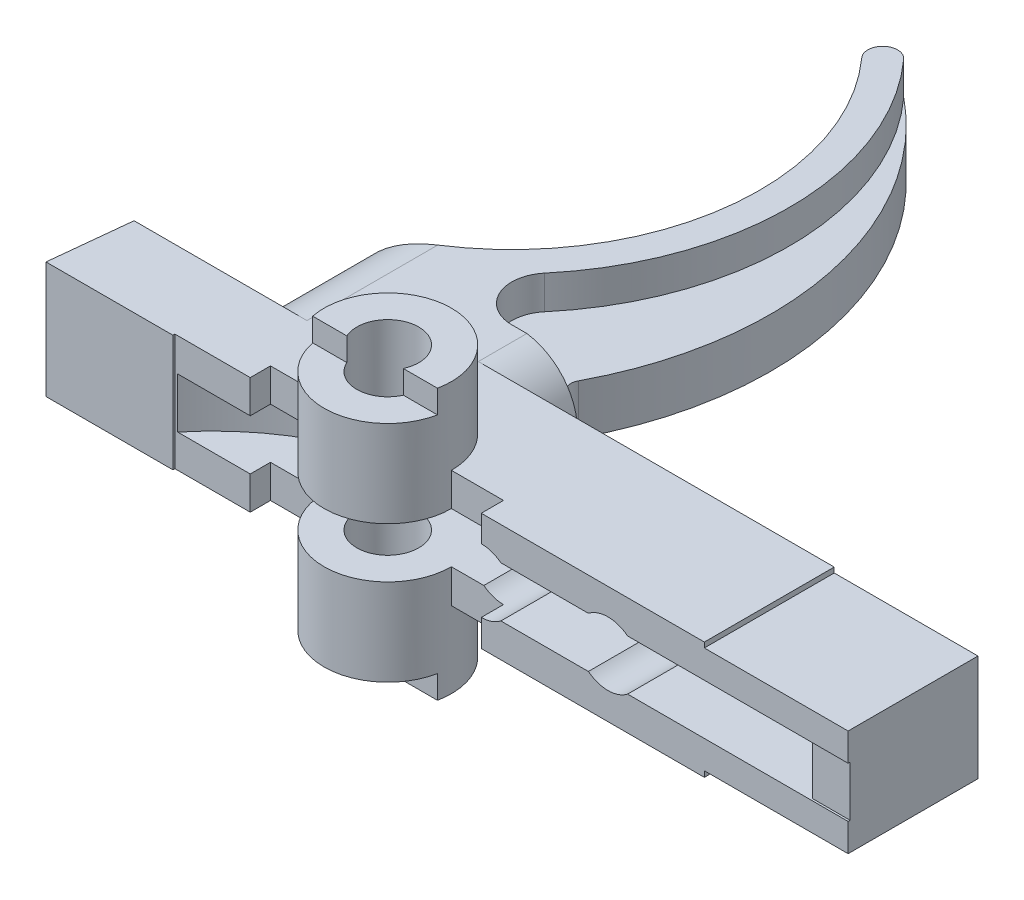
ISO-10303-21;
HEADER;
FILE_DESCRIPTION(('STEP AP214'),'2;1');
FILE_NAME('part.step','',(''),(''),'','','');
FILE_SCHEMA(('AUTOMOTIVE_DESIGN { 1 0 10303 214 1 1 1 1 }'));
ENDSEC;
DATA;
#1=APPLICATION_CONTEXT('core data for automotive mechanical design processes');
#2=APPLICATION_PROTOCOL_DEFINITION('international standard','automotive_design',2000,#1);
#3=PRODUCT_CONTEXT('',#1,'mechanical');
#4=PRODUCT('Part','Part','',(#3));
#5=PRODUCT_RELATED_PRODUCT_CATEGORY('part','',(#4));
#6=PRODUCT_DEFINITION_FORMATION('','',#4);
#7=PRODUCT_DEFINITION_CONTEXT('part definition',#1,'design');
#8=PRODUCT_DEFINITION('design','',#6,#7);
#9=PRODUCT_DEFINITION_SHAPE('','',#8);
#10=(LENGTH_UNIT() NAMED_UNIT(*) SI_UNIT(.MILLI.,.METRE.));
#11=(NAMED_UNIT(*) PLANE_ANGLE_UNIT() SI_UNIT($,.RADIAN.));
#12=(NAMED_UNIT(*) SI_UNIT($,.STERADIAN.) SOLID_ANGLE_UNIT());
#13=UNCERTAINTY_MEASURE_WITH_UNIT(LENGTH_MEASURE(1.E-05),#10,'distance_accuracy_value','');
#14=(GEOMETRIC_REPRESENTATION_CONTEXT(3) GLOBAL_UNCERTAINTY_ASSIGNED_CONTEXT((#13)) GLOBAL_UNIT_ASSIGNED_CONTEXT((#10,
#11,#12)) REPRESENTATION_CONTEXT('',''));
#15=CARTESIAN_POINT('',(0.,0.,0.));
#16=DIRECTION('',(0.,0.,1.));
#17=DIRECTION('',(1.,0.,0.));
#18=AXIS2_PLACEMENT_3D('',#15,#16,#17);
#19=CARTESIAN_POINT('',(-74.3897236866,29.44368,0.8128));
#20=DIRECTION('',(0.,0.,1.));
#21=DIRECTION('',(1.,0.,0.));
#22=AXIS2_PLACEMENT_3D('',#19,#20,#21);
#23=PLANE('',#22);
#24=DIRECTION('',(0.,1.,0.));
#25=VECTOR('',#24,1.);
#26=CARTESIAN_POINT('',(-74.3897236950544,29.44368,0.8128));
#27=LINE('',#26,#25);
#28=CARTESIAN_POINT('',(-74.3897236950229,30.9245000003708,0.812799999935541));
#29=VERTEX_POINT('',#28);
#30=CARTESIAN_POINT('',(-74.3897236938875,29.44368,0.812799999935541));
#31=VERTEX_POINT('',#30);
#32=EDGE_CURVE('E1094',#29,#31,#27,.F.);
#33=ORIENTED_EDGE('',*,*,#32,.T.);
#34=DIRECTION('',(1.,0.,0.));
#35=VECTOR('',#34,1.);
#36=CARTESIAN_POINT('',(-80.3256204,29.44368,0.812799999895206));
#37=LINE('',#36,#35);
#38=CARTESIAN_POINT('',(-72.2051484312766,29.44368,0.812800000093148));
#39=VERTEX_POINT('',#38);
#40=EDGE_CURVE('E2273',#31,#39,#37,.T.);
#41=ORIENTED_EDGE('',*,*,#40,.T.);
#42=DIRECTION('',(0.,1.,0.));
#43=VECTOR('',#42,1.);
#44=CARTESIAN_POINT('',(-72.2051484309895,29.44368,0.8128));
#45=LINE('',#44,#43);
#46=CARTESIAN_POINT('',(-72.2051484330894,30.9245000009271,0.812800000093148));
#47=VERTEX_POINT('',#46);
#48=EDGE_CURVE('E1102',#39,#47,#45,.T.);
#49=ORIENTED_EDGE('',*,*,#48,.T.);
#50=DIRECTION('',(1.,0.,0.));
#51=VECTOR('',#50,1.);
#52=CARTESIAN_POINT('',(-80.2427897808,30.9245,0.812799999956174));
#53=LINE('',#52,#51);
#54=EDGE_CURVE('E2276',#47,#29,#53,.F.);
#55=ORIENTED_EDGE('',*,*,#54,.T.);
#56=EDGE_LOOP('',(#33,#41,#49,#55));
#57=FACE_BOUND('',#56,.T.);
#58=ADVANCED_FACE('F16',(#57),#23,.T.);
#59=CARTESIAN_POINT('',(-80.1948515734,29.44368,0.8128));
#60=DIRECTION('',(0.,0.,1.));
#61=DIRECTION('',(1.,0.,0.));
#62=AXIS2_PLACEMENT_3D('',#59,#60,#61);
#63=PLANE('',#62);
#64=DIRECTION('',(0.,1.,0.));
#65=VECTOR('',#64,1.);
#66=CARTESIAN_POINT('',(-78.0102763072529,29.44368,0.8128));
#67=LINE('',#66,#65);
#68=CARTESIAN_POINT('',(-78.0102763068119,29.44368,0.812799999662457));
#69=VERTEX_POINT('',#68);
#70=CARTESIAN_POINT('',(-78.0102763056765,30.9245000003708,0.812799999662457));
#71=VERTEX_POINT('',#70);
#72=EDGE_CURVE('E1093',#69,#71,#67,.T.);
#73=ORIENTED_EDGE('',*,*,#72,.T.);
#74=DIRECTION('',(1.,0.,0.));
#75=VECTOR('',#74,1.);
#76=CARTESIAN_POINT('',(-80.2427897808,30.9245,0.812799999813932));
#77=LINE('',#76,#75);
#78=CARTESIAN_POINT('',(-80.1948515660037,30.9245000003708,0.812800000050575));
#79=VERTEX_POINT('',#78);
#80=EDGE_CURVE('E1098',#71,#79,#77,.F.);
#81=ORIENTED_EDGE('',*,*,#80,.T.);
#82=DIRECTION('',(0.,1.,0.));
#83=VECTOR('',#82,1.);
#84=CARTESIAN_POINT('',(-80.1948515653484,29.44368,0.8128));
#85=LINE('',#84,#83);
#86=CARTESIAN_POINT('',(-80.1948515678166,29.44368,0.812800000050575));
#87=VERTEX_POINT('',#86);
#88=EDGE_CURVE('E1086',#79,#87,#85,.F.);
#89=ORIENTED_EDGE('',*,*,#88,.T.);
#90=DIRECTION('',(1.,0.,0.));
#91=VECTOR('',#90,1.);
#92=CARTESIAN_POINT('',(-80.3256204,29.44368,0.812800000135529));
#93=LINE('',#92,#91);
#94=EDGE_CURVE('E2286',#87,#69,#93,.T.);
#95=ORIENTED_EDGE('',*,*,#94,.T.);
#96=EDGE_LOOP('',(#73,#81,#89,#95));
#97=FACE_BOUND('',#96,.T.);
#98=ADVANCED_FACE('F2242',(#97),#63,.T.);
#99=CARTESIAN_POINT('',(-80.2427897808,30.9245,0.8128));
#100=DIRECTION('',(0.,1.,0.));
#101=DIRECTION('',(0.,0.,1.));
#102=AXIS2_PLACEMENT_3D('',#99,#100,#101);
#103=PLANE('',#102);
#104=ORIENTED_EDGE('',*,*,#54,.F.);
#105=CARTESIAN_POINT('',(-76.2,30.9245000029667,0.));
#106=DIRECTION('',(0.,1.,0.));
#107=DIRECTION('',(0.,0.,1.));
#108=AXIS2_PLACEMENT_3D('',#105,#106,#107);
#109=CIRCLE('',#108,4.0767);
#110=CARTESIAN_POINT('',(-76.2,30.924500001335,4.0767));
#111=VERTEX_POINT('',#110);
#112=EDGE_CURVE('E1385',#111,#47,#109,.T.);
#113=ORIENTED_EDGE('',*,*,#112,.F.);
#114=CARTESIAN_POINT('',(-76.2,30.9245000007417,0.));
#115=DIRECTION('',(0.,1.,0.));
#116=DIRECTION('',(-0.979922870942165,0.,0.199376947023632));
#117=AXIS2_PLACEMENT_3D('',#114,#115,#116);
#118=CIRCLE('',#117,4.0767);
#119=EDGE_CURVE('E955',#79,#111,#118,.T.);
#120=ORIENTED_EDGE('',*,*,#119,.F.);
#121=ORIENTED_EDGE('',*,*,#80,.F.);
#122=CARTESIAN_POINT('',(-78.0102763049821,30.9245,0.812799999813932));
#123=CARTESIAN_POINT('',(-77.8948138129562,30.9245,1.06961019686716));
#124=CARTESIAN_POINT('',(-77.7136804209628,30.9245,1.28316628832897));
#125=CARTESIAN_POINT('',(-77.5237860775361,30.9245,1.50705153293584));
#126=CARTESIAN_POINT('',(-77.2781567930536,30.9245,1.66592979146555));
#127=CARTESIAN_POINT('',(-77.0316553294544,30.9245,1.82537219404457));
#128=CARTESIAN_POINT('',(-76.7505844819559,30.9245,1.90646292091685));
#129=CARTESIAN_POINT('',(-76.4802846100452,30.9245,1.98444615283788));
#130=CARTESIAN_POINT('',(-76.2000000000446,30.9245,1.984375));
#131=CARTESIAN_POINT('',(-75.9186750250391,30.9245,1.98430358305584));
#132=CARTESIAN_POINT('',(-75.6494155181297,30.9245,1.90646292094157));
#133=CARTESIAN_POINT('',(-75.3673920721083,30.9245,1.82493231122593));
#134=CARTESIAN_POINT('',(-75.1218432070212,30.9245,1.66592979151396));
#135=CARTESIAN_POINT('',(-74.8754224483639,30.9245,1.50636268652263));
#136=CARTESIAN_POINT('',(-74.6863195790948,30.9245,1.28316628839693));
#137=CARTESIAN_POINT('',(-74.5049620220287,30.9245,1.06911161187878));
#138=CARTESIAN_POINT('',(-74.3897236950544,30.9245,0.812799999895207));
#139=B_SPLINE_CURVE_WITH_KNOTS('',2,(#122,#123,#124,#125,#126,#127,#128,#129,#130,#131,#132,
#133,#134,#135,#136,#137,#138),.UNSPECIFIED.,.F.,.F.,(3,2,2,2,2,2,2,2,3),(0.,0.125,0.25,0.375,
0.5,0.625,0.75,0.875,1.),.UNSPECIFIED.);
#140=EDGE_CURVE('E2289',#71,#29,#139,.T.);
#141=ORIENTED_EDGE('',*,*,#140,.T.);
#142=EDGE_LOOP('',(#104,#113,#120,#121,#141));
#143=FACE_BOUND('',#142,.T.);
#144=ADVANCED_FACE('F2232',(#143),#103,.F.);
#145=CARTESIAN_POINT('',(-80.3256204,29.44368,-4.1060878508));
#146=DIRECTION('',(0.,1.,0.));
#147=DIRECTION('',(0.,0.,1.));
#148=AXIS2_PLACEMENT_3D('',#145,#146,#147);
#149=PLANE('',#148);
#150=ORIENTED_EDGE('',*,*,#94,.F.);
#151=CARTESIAN_POINT('',(-76.2,29.44368,0.));
#152=DIRECTION('',(0.,1.,0.));
#153=DIRECTION('',(0.,0.,-1.));
#154=AXIS2_PLACEMENT_3D('',#151,#152,#153);
#155=CIRCLE('',#154,4.0767);
#156=CARTESIAN_POINT('',(-76.2,29.44368,-4.0767));
#157=VERTEX_POINT('',#156);
#158=EDGE_CURVE('E1030',#157,#87,#155,.T.);
#159=ORIENTED_EDGE('',*,*,#158,.F.);
#160=CARTESIAN_POINT('',(-76.2,29.44368,0.));
#161=DIRECTION('',(0.,1.,0.));
#162=DIRECTION('',(0.979922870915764,0.,0.199376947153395));
#163=AXIS2_PLACEMENT_3D('',#160,#161,#162);
#164=CIRCLE('',#163,4.0767);
#165=EDGE_CURVE('E2284',#39,#157,#164,.T.);
#166=ORIENTED_EDGE('',*,*,#165,.F.);
#167=ORIENTED_EDGE('',*,*,#40,.F.);
#168=CARTESIAN_POINT('',(-74.3897236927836,29.44368,0.812799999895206));
#169=CARTESIAN_POINT('',(-74.2166394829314,29.44368,0.424828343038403));
#170=CARTESIAN_POINT('',(-74.215625,29.44368,0.));
#171=B_SPLINE_CURVE_WITH_KNOTS('',2,(#168,#169,#170),.UNSPECIFIED.,.F.,.F.,(3,3),(0.,1.),.UNSPECIFIED.);
#172=CARTESIAN_POINT('',(-74.215625,29.44368,0.));
#173=VERTEX_POINT('',#172);
#174=EDGE_CURVE('E2282',#31,#173,#171,.T.);
#175=ORIENTED_EDGE('',*,*,#174,.T.);
#176=CARTESIAN_POINT('',(-74.215625,29.44368,0.));
#177=CARTESIAN_POINT('',(-74.2158277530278,29.44368,-0.37928592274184));
#178=CARTESIAN_POINT('',(-74.3549513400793,29.44368,-0.73043793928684));
#179=CARTESIAN_POINT('',(-74.5065238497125,29.44368,-1.11301140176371));
#180=CARTESIAN_POINT('',(-74.7968349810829,29.44368,-1.40316501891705));
#181=CARTESIAN_POINT('',(-75.0878915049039,29.44368,-1.69406362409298));
#182=CARTESIAN_POINT('',(-75.4695620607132,29.44368,-1.84504865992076));
#183=CARTESIAN_POINT('',(-75.8220163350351,29.44368,-1.98447602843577));
#184=CARTESIAN_POINT('',(-76.2,29.44368,-1.984375));
#185=CARTESIAN_POINT('',(-76.5790298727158,29.44368,-1.98427369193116));
#186=CARTESIAN_POINT('',(-76.9304379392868,29.44368,-1.84504865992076));
#187=CARTESIAN_POINT('',(-77.313011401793,29.44368,-1.69347615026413));
#188=CARTESIAN_POINT('',(-77.6031650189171,29.44368,-1.40316501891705));
#189=CARTESIAN_POINT('',(-77.8940636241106,29.44368,-1.11210849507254));
#190=CARTESIAN_POINT('',(-78.0450486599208,29.44368,-0.73043793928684));
#191=CARTESIAN_POINT('',(-78.1841725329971,29.44368,-0.378750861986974));
#192=CARTESIAN_POINT('',(-78.184375,29.44368,0.));
#193=B_SPLINE_CURVE_WITH_KNOTS('',2,(#176,#177,#178,#179,#180,#181,#182,#183,#184,#185,#186,
#187,#188,#189,#190,#191,#192),.UNSPECIFIED.,.F.,.F.,(3,2,2,2,2,2,2,2,3),(0.,0.125,0.25,0.375,
0.5,0.625,0.75,0.875,1.),.UNSPECIFIED.);
#194=CARTESIAN_POINT('',(-78.184375,29.44368,0.));
#195=VERTEX_POINT('',#194);
#196=EDGE_CURVE('E1669',#173,#195,#193,.T.);
#197=ORIENTED_EDGE('',*,*,#196,.T.);
#198=CARTESIAN_POINT('',(-78.184375,29.44368,0.));
#199=CARTESIAN_POINT('',(-78.1833605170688,29.44368,0.424828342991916));
#200=CARTESIAN_POINT('',(-78.0102763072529,29.44368,0.812799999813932));
#201=B_SPLINE_CURVE_WITH_KNOTS('',2,(#198,#199,#200),.UNSPECIFIED.,.F.,.F.,(3,3),(0.,1.),.UNSPECIFIED.);
#202=EDGE_CURVE('E2305',#195,#69,#201,.T.);
#203=ORIENTED_EDGE('',*,*,#202,.T.);
#204=EDGE_LOOP('',(#150,#159,#166,#167,#175,#197,#203));
#205=FACE_BOUND('',#204,.T.);
#206=ADVANCED_FACE('F2222',(#205),#149,.F.);
#207=CARTESIAN_POINT('',(-47.70755,39.7129,0.2159));
#208=DIRECTION('',(-1.,0.,0.));
#209=DIRECTION('',(0.,0.,1.));
#210=AXIS2_PLACEMENT_3D('',#207,#208,#209);
#211=PLANE('',#210);
#212=DIRECTION('',(0.,1.,0.));
#213=VECTOR('',#212,1.);
#214=CARTESIAN_POINT('',(-47.70755,36.4871,0.215899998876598));
#215=LINE('',#214,#213);
#216=CARTESIAN_POINT('',(-47.7075500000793,39.7129,0.215899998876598));
#217=VERTEX_POINT('',#216);
#218=CARTESIAN_POINT('',(-47.7075500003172,36.4871,0.215899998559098));
#219=VERTEX_POINT('',#218);
#220=EDGE_CURVE('E2433',#217,#219,#215,.F.);
#221=ORIENTED_EDGE('',*,*,#220,.T.);
#222=DIRECTION('',(0.,0.,-1.));
#223=VECTOR('',#222,1.);
#224=CARTESIAN_POINT('',(-47.7075500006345,36.4871,1.4224));
#225=LINE('',#224,#223);
#226=CARTESIAN_POINT('',(-47.7075500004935,36.4870999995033,1.29539999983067));
#227=VERTEX_POINT('',#226);
#228=EDGE_CURVE('E2400',#219,#227,#225,.F.);
#229=ORIENTED_EDGE('',*,*,#228,.T.);
#230=DIRECTION('',(0.,1.,0.));
#231=VECTOR('',#230,1.);
#232=CARTESIAN_POINT('',(-47.707550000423,36.4871,1.2954));
#233=LINE('',#232,#231);
#234=CARTESIAN_POINT('',(-47.7075500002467,39.7129,1.29539999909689));
#235=VERTEX_POINT('',#234);
#236=EDGE_CURVE('E2440',#227,#235,#233,.T.);
#237=ORIENTED_EDGE('',*,*,#236,.T.);
#238=DIRECTION('',(0.,0.,1.));
#239=VECTOR('',#238,1.);
#240=CARTESIAN_POINT('',(-47.70755,39.7129,0.2159));
#241=LINE('',#240,#239);
#242=EDGE_CURVE('E2315',#235,#217,#241,.F.);
#243=ORIENTED_EDGE('',*,*,#242,.T.);
#244=EDGE_LOOP('',(#221,#229,#237,#243));
#245=FACE_BOUND('',#244,.T.);
#246=ADVANCED_FACE('F2213',(#245),#211,.T.);
#247=CARTESIAN_POINT('',(-59.4175273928,36.4871,1.4224));
#248=DIRECTION('',(0.,-1.,0.));
#249=DIRECTION('',(0.,0.,-1.));
#250=AXIS2_PLACEMENT_3D('',#247,#248,#249);
#251=PLANE('',#250);
#252=ORIENTED_EDGE('',*,*,#228,.F.);
#253=CARTESIAN_POINT('',(-47.7075500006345,36.4871,0.215899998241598));
#254=CARTESIAN_POINT('',(-47.7077524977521,36.4871,-0.693295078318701));
#255=CARTESIAN_POINT('',(-48.0419332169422,36.4871,-1.53715105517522));
#256=CARTESIAN_POINT('',(-48.2198978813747,36.4871,-1.98653827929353));
#257=CARTESIAN_POINT('',(-48.4838588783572,36.4871,-2.39018645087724));
#258=CARTESIAN_POINT('',(-48.7540673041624,36.4871,-2.80338816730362));
#259=CARTESIAN_POINT('',(-49.1024539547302,36.4871,-3.15169604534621));
#260=CARTESIAN_POINT('',(-49.4515981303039,36.4871,-3.50076127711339));
#261=CARTESIAN_POINT('',(-49.8639635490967,36.4871,-3.77029112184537));
#262=CARTESIAN_POINT('',(-50.2685487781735,36.4871,-4.03473568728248));
#263=CARTESIAN_POINT('',(-50.7169989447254,36.4871,-4.21221678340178));
#264=CARTESIAN_POINT('',(-51.5613900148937,36.4871,-4.54639762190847));
#265=CARTESIAN_POINT('',(-52.4700499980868,36.4871,-4.5466));
#266=B_SPLINE_CURVE_WITH_KNOTS('',2,(#253,#254,#255,#256,#257,#258,#259,#260,#261,#262,#263,
#264,#265),.UNSPECIFIED.,.F.,.F.,(3,2,2,2,2,2,3),(0.,0.25,0.375,0.5,0.625,0.75,1.),.UNSPECIFIED.);
#267=CARTESIAN_POINT('',(-52.4700499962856,36.4871,-4.5466));
#268=VERTEX_POINT('',#267);
#269=EDGE_CURVE('E2414',#219,#268,#266,.T.);
#270=ORIENTED_EDGE('',*,*,#269,.T.);
#271=DIRECTION('',(-1.,0.,0.));
#272=VECTOR('',#271,1.);
#273=CARTESIAN_POINT('',(-52.47005,36.4871,-4.5466));
#274=LINE('',#273,#272);
#275=CARTESIAN_POINT('',(-59.4175274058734,36.487099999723,-4.5466000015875));
#276=VERTEX_POINT('',#275);
#277=EDGE_CURVE('E2869',#268,#276,#274,.T.);
#278=ORIENTED_EDGE('',*,*,#277,.T.);
#279=DIRECTION('',(0.,0.,1.));
#280=VECTOR('',#279,1.);
#281=CARTESIAN_POINT('',(-59.4175274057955,36.4870999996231,-5.5626));
#282=LINE('',#281,#280);
#283=CARTESIAN_POINT('',(-59.417527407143,36.487099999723,1.4224));
#284=VERTEX_POINT('',#283);
#285=EDGE_CURVE('E2407',#276,#284,#282,.T.);
#286=ORIENTED_EDGE('',*,*,#285,.T.);
#287=DIRECTION('',(-1.,0.,0.));
#288=VECTOR('',#287,1.);
#289=CARTESIAN_POINT('',(-45.29455,36.487099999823,1.4224));
#290=LINE('',#289,#288);
#291=CARTESIAN_POINT('',(-45.29455,36.4870999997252,1.4224));
#292=VERTEX_POINT('',#291);
#293=EDGE_CURVE('E2495',#284,#292,#290,.F.);
#294=ORIENTED_EDGE('',*,*,#293,.T.);
#295=DIRECTION('',(0.,0.,-1.));
#296=VECTOR('',#295,1.);
#297=CARTESIAN_POINT('',(-45.29455,36.4871,1.4224));
#298=LINE('',#297,#296);
#299=CARTESIAN_POINT('',(-45.29455,36.4870999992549,1.29539999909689));
#300=VERTEX_POINT('',#299);
#301=EDGE_CURVE('E2317',#300,#292,#298,.F.);
#302=ORIENTED_EDGE('',*,*,#301,.F.);
#303=DIRECTION('',(-1.,0.,0.));
#304=VECTOR('',#303,1.);
#305=CARTESIAN_POINT('',(-45.29455,36.4870999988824,1.2954));
#306=LINE('',#305,#304);
#307=EDGE_CURVE('E2485',#300,#227,#306,.T.);
#308=ORIENTED_EDGE('',*,*,#307,.T.);
#309=EDGE_LOOP('',(#252,#270,#278,#286,#294,#302,#308));
#310=FACE_BOUND('',#309,.T.);
#311=ADVANCED_FACE('F2204',(#310),#251,.F.);
#312=CARTESIAN_POINT('',(-67.5328273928,36.4871,1.4224));
#313=DIRECTION('',(0.,-1.,0.));
#314=DIRECTION('',(0.,0.,-1.));
#315=AXIS2_PLACEMENT_3D('',#312,#313,#314);
#316=PLANE('',#315);
#317=DIRECTION('',(-1.,0.,0.));
#318=VECTOR('',#317,1.);
#319=CARTESIAN_POINT('',(-45.29455,36.487099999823,1.4224));
#320=LINE('',#319,#318);
#321=CARTESIAN_POINT('',(-67.5328274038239,36.4871000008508,1.4224));
#322=VERTEX_POINT('',#321);
#323=CARTESIAN_POINT('',(-61.930972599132,36.4871000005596,1.4224));
#324=VERTEX_POINT('',#323);
#325=EDGE_CURVE('E2477',#322,#324,#320,.F.);
#326=ORIENTED_EDGE('',*,*,#325,.T.);
#327=DIRECTION('',(0.,0.,-1.));
#328=VECTOR('',#327,1.);
#329=CARTESIAN_POINT('',(-61.9309726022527,36.4871,1.4224));
#330=LINE('',#329,#328);
#331=CARTESIAN_POINT('',(-61.9309726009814,36.4871000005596,-4.54660000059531));
#332=VERTEX_POINT('',#331);
#333=EDGE_CURVE('E1673',#332,#324,#330,.F.);
#334=ORIENTED_EDGE('',*,*,#333,.F.);
#335=DIRECTION('',(-1.,0.,0.));
#336=VECTOR('',#335,1.);
#337=CARTESIAN_POINT('',(-61.897361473,36.4871000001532,-4.5466));
#338=LINE('',#337,#336);
#339=CARTESIAN_POINT('',(-67.5328274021,36.4871000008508,-4.5466000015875));
#340=VERTEX_POINT('',#339);
#341=EDGE_CURVE('E2807',#332,#340,#338,.T.);
#342=ORIENTED_EDGE('',*,*,#341,.T.);
#343=DIRECTION('',(0.,0.,1.));
#344=VECTOR('',#343,1.);
#345=CARTESIAN_POINT('',(-67.5328274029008,36.4871000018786,-5.5626));
#346=LINE('',#345,#344);
#347=EDGE_CURVE('E2288',#340,#322,#346,.T.);
#348=ORIENTED_EDGE('',*,*,#347,.T.);
#349=EDGE_LOOP('',(#326,#334,#342,#348));
#350=FACE_BOUND('',#349,.T.);
#351=ADVANCED_FACE('F1706',(#350),#316,.F.);
#352=CARTESIAN_POINT('',(-70.8587864,36.0307124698,-5.5626));
#353=DIRECTION('',(0.,0.,1.));
#354=DIRECTION('',(1.,0.,0.));
#355=AXIS2_PLACEMENT_3D('',#352,#353,#354);
#356=PLANE('',#355);
#357=CARTESIAN_POINT('',(-70.83425,38.1,-5.5626));
#358=CARTESIAN_POINT('',(-70.8340475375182,37.7097425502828,-5.5626));
#359=CARTESIAN_POINT('',(-70.6906881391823,37.3473567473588,-5.5626));
#360=CARTESIAN_POINT('',(-70.535104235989,36.9540696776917,-5.5626));
#361=CARTESIAN_POINT('',(-70.2353712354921,36.6541787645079,-5.5626));
#362=CARTESIAN_POINT('',(-69.9363832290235,36.3550332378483,-5.5626));
#363=CARTESIAN_POINT('',(-69.5421932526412,36.1988618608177,-5.5626));
#364=CARTESIAN_POINT('',(-69.180086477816,36.0554013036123,-5.5626));
#365=CARTESIAN_POINT('',(-68.78955,36.0553,-5.5626));
#366=CARTESIAN_POINT('',(-68.400059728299,36.0551989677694,-5.5626));
#367=CARTESIAN_POINT('',(-68.0369067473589,36.1988618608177,-5.5626));
#368=CARTESIAN_POINT('',(-67.6436196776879,36.3544457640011,-5.5626));
#369=CARTESIAN_POINT('',(-67.3437287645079,36.6541787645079,-5.5626));
#370=CARTESIAN_POINT('',(-67.0445832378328,36.9531667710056,-5.5626));
#371=CARTESIAN_POINT('',(-66.8884118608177,37.3473567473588,-5.5626));
#372=CARTESIAN_POINT('',(-66.7450527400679,37.7092074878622,-5.5626));
#373=CARTESIAN_POINT('',(-66.74485,38.1,-5.5626));
#374=B_SPLINE_CURVE_WITH_KNOTS('',2,(#357,#358,#359,#360,#361,#362,#363,#364,#365,#366,#367,
#368,#369,#370,#371,#372,#373),.UNSPECIFIED.,.F.,.F.,(3,2,2,2,2,2,2,2,3),(0.,0.125,0.25,0.375,
0.5,0.625,0.75,0.875,1.),.UNSPECIFIED.);
#375=CARTESIAN_POINT('',(-70.83425,38.1,-5.5626));
#376=VERTEX_POINT('',#375);
#377=CARTESIAN_POINT('',(-66.74485,38.1,-5.5626));
#378=VERTEX_POINT('',#377);
#379=EDGE_CURVE('E941',#376,#378,#374,.T.);
#380=ORIENTED_EDGE('',*,*,#379,.T.);
#381=CARTESIAN_POINT('',(-66.74485,38.1,-5.5626));
#382=CARTESIAN_POINT('',(-66.7450524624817,38.4902574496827,-5.5626));
#383=CARTESIAN_POINT('',(-66.8884118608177,38.8526432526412,-5.5626));
#384=CARTESIAN_POINT('',(-67.0439957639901,39.2459303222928,-5.5626));
#385=CARTESIAN_POINT('',(-67.3437287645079,39.5458212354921,-5.5626));
#386=CARTESIAN_POINT('',(-67.6427167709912,39.844966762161,-5.5626));
#387=CARTESIAN_POINT('',(-68.0369067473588,40.0011381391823,-5.5626));
#388=CARTESIAN_POINT('',(-68.399013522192,40.1445986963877,-5.5626));
#389=CARTESIAN_POINT('',(-68.78955,40.1447,-5.5626));
#390=CARTESIAN_POINT('',(-69.179040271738,40.1448010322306,-5.5626));
#391=CARTESIAN_POINT('',(-69.5421932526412,40.0011381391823,-5.5626));
#392=CARTESIAN_POINT('',(-69.9354803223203,39.8455542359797,-5.5626));
#393=CARTESIAN_POINT('',(-70.2353712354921,39.5458212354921,-5.5626));
#394=CARTESIAN_POINT('',(-70.5345167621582,39.2468332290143,-5.5626));
#395=CARTESIAN_POINT('',(-70.6906881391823,38.8526432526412,-5.5626));
#396=CARTESIAN_POINT('',(-70.8340472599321,38.4907925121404,-5.5626));
#397=CARTESIAN_POINT('',(-70.83425,38.1,-5.5626));
#398=B_SPLINE_CURVE_WITH_KNOTS('',2,(#381,#382,#383,#384,#385,#386,#387,#388,#389,#390,#391,
#392,#393,#394,#395,#396,#397),.UNSPECIFIED.,.F.,.F.,(3,2,2,2,2,2,2,2,3),(0.,0.125,0.25,0.375,
0.5,0.625,0.75,0.875,1.),.UNSPECIFIED.);
#399=EDGE_CURVE('E1716',#378,#376,#398,.T.);
#400=ORIENTED_EDGE('',*,*,#399,.T.);
#401=EDGE_LOOP('',(#380,#400));
#402=FACE_BOUND('',#401,.T.);
#403=ADVANCED_FACE('F1695',(#402),#356,.T.);
#404=CARTESIAN_POINT('',(-74.3897236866,45.2755,0.8128));
#405=DIRECTION('',(0.,0.,1.));
#406=DIRECTION('',(1.,0.,0.));
#407=AXIS2_PLACEMENT_3D('',#404,#405,#406);
#408=PLANE('',#407);
#409=DIRECTION('',(0.,1.,0.));
#410=VECTOR('',#409,1.);
#411=CARTESIAN_POINT('',(-74.3897236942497,39.7129,0.812799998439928));
#412=LINE('',#411,#410);
#413=CARTESIAN_POINT('',(-74.3897236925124,46.75632,0.812799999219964));
#414=VERTEX_POINT('',#413);
#415=CARTESIAN_POINT('',(-74.3897236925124,45.2754999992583,0.812799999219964));
#416=VERTEX_POINT('',#415);
#417=EDGE_CURVE('E1652',#414,#416,#412,.F.);
#418=ORIENTED_EDGE('',*,*,#417,.T.);
#419=DIRECTION('',(1.,0.,0.));
#420=VECTOR('',#419,1.);
#421=CARTESIAN_POINT('',(-80.2427897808,45.2755,0.8128));
#422=LINE('',#421,#420);
#423=CARTESIAN_POINT('',(-72.2051484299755,45.2754999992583,0.812799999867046));
#424=VERTEX_POINT('',#423);
#425=EDGE_CURVE('E2968',#416,#424,#422,.T.);
#426=ORIENTED_EDGE('',*,*,#425,.T.);
#427=DIRECTION('',(0.,1.,0.));
#428=VECTOR('',#427,1.);
#429=CARTESIAN_POINT('',(-72.205148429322,45.2755,0.8128));
#430=LINE('',#429,#428);
#431=CARTESIAN_POINT('',(-72.2051484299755,46.75632,0.812799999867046));
#432=VERTEX_POINT('',#431);
#433=EDGE_CURVE('E1169',#424,#432,#430,.T.);
#434=ORIENTED_EDGE('',*,*,#433,.T.);
#435=DIRECTION('',(1.,0.,0.));
#436=VECTOR('',#435,1.);
#437=CARTESIAN_POINT('',(-80.3256204,46.75632,0.8128));
#438=LINE('',#437,#436);
#439=EDGE_CURVE('E2966',#432,#414,#438,.F.);
#440=ORIENTED_EDGE('',*,*,#439,.T.);
#441=EDGE_LOOP('',(#418,#426,#434,#440));
#442=FACE_BOUND('',#441,.T.);
#443=ADVANCED_FACE('F1705',(#442),#408,.T.);
#444=CARTESIAN_POINT('',(-80.1948515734,45.2755,0.8128));
#445=DIRECTION('',(0.,0.,1.));
#446=DIRECTION('',(1.,0.,0.));
#447=AXIS2_PLACEMENT_3D('',#444,#445,#446);
#448=PLANE('',#447);
#449=DIRECTION('',(0.,1.,0.));
#450=VECTOR('',#449,1.);
#451=CARTESIAN_POINT('',(-78.0102763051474,39.7129,0.812799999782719));
#452=LINE('',#451,#450);
#453=CARTESIAN_POINT('',(-78.0102763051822,45.2754999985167,0.812799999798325));
#454=VERTEX_POINT('',#453);
#455=CARTESIAN_POINT('',(-78.0102763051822,46.75632,0.81279999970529));
#456=VERTEX_POINT('',#455);
#457=EDGE_CURVE('E1648',#454,#456,#452,.T.);
#458=ORIENTED_EDGE('',*,*,#457,.T.);
#459=DIRECTION('',(1.,0.,0.));
#460=VECTOR('',#459,1.);
#461=CARTESIAN_POINT('',(-80.3256204,46.75632,0.812799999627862));
#462=LINE('',#461,#460);
#463=CARTESIAN_POINT('',(-80.1948515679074,46.75632,0.812800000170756));
#464=VERTEX_POINT('',#463);
#465=EDGE_CURVE('E781',#456,#464,#462,.F.);
#466=ORIENTED_EDGE('',*,*,#465,.T.);
#467=DIRECTION('',(0.,1.,0.));
#468=VECTOR('',#467,1.);
#469=CARTESIAN_POINT('',(-80.1948515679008,45.2755,0.8128));
#470=LINE('',#469,#468);
#471=CARTESIAN_POINT('',(-80.1948515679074,45.2754999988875,0.812800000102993));
#472=VERTEX_POINT('',#471);
#473=EDGE_CURVE('E1641',#464,#472,#470,.F.);
#474=ORIENTED_EDGE('',*,*,#473,.T.);
#475=DIRECTION('',(1.,0.,0.));
#476=VECTOR('',#475,1.);
#477=CARTESIAN_POINT('',(-80.2427897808,45.2755,0.812800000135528));
#478=LINE('',#477,#476);
#479=EDGE_CURVE('E1717',#472,#454,#478,.T.);
#480=ORIENTED_EDGE('',*,*,#479,.T.);
#481=EDGE_LOOP('',(#458,#466,#474,#480));
#482=FACE_BOUND('',#481,.T.);
#483=ADVANCED_FACE('F2174',(#482),#448,.T.);
#484=CARTESIAN_POINT('',(-76.2,39.7129,0.));
#485=DIRECTION('',(0.,1.,0.));
#486=DIRECTION('',(0.,0.,1.));
#487=AXIS2_PLACEMENT_3D('',#484,#485,#486);
#488=CYLINDRICAL_SURFACE('',#487,1.984375);
#489=CARTESIAN_POINT('',(-76.2,39.7129,0.));
#490=DIRECTION('',(0.,-1.,0.));
#491=DIRECTION('',(0.,0.,-1.));
#492=AXIS2_PLACEMENT_3D('',#489,#490,#491);
#493=CIRCLE('',#492,1.984375);
#494=CARTESIAN_POINT('',(-76.2,39.7129,-1.984375));
#495=VERTEX_POINT('',#494);
#496=CARTESIAN_POINT('',(-76.2,39.7129,1.984375));
#497=VERTEX_POINT('',#496);
#498=EDGE_CURVE('E771',#495,#497,#493,.T.);
#499=ORIENTED_EDGE('',*,*,#498,.T.);
#500=CARTESIAN_POINT('',(-76.2,39.7129,0.));
#501=DIRECTION('',(0.,-1.,0.));
#502=DIRECTION('',(0.,0.,1.));
#503=AXIS2_PLACEMENT_3D('',#500,#501,#502);
#504=CIRCLE('',#503,1.984375);
#505=EDGE_CURVE('E712',#497,#495,#504,.T.);
#506=ORIENTED_EDGE('',*,*,#505,.T.);
#507=EDGE_LOOP('',(#499,#506));
#508=FACE_BOUND('',#507,.T.);
#509=CARTESIAN_POINT('',(-76.2,45.2754999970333,0.));
#510=DIRECTION('',(0.,1.,0.));
#511=DIRECTION('',(-0.912265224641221,0.,0.409599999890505));
#512=AXIS2_PLACEMENT_3D('',#509,#510,#511);
#513=CIRCLE('',#512,1.984375);
#514=CARTESIAN_POINT('',(-76.2,45.2754999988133,1.984375));
#515=VERTEX_POINT('',#514);
#516=EDGE_CURVE('E1720',#454,#515,#513,.T.);
#517=ORIENTED_EDGE('',*,*,#516,.T.);
#518=CARTESIAN_POINT('',(-76.2,45.2754999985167,0.));
#519=DIRECTION('',(0.,1.,0.));
#520=DIRECTION('',(0.,0.,1.));
#521=AXIS2_PLACEMENT_3D('',#518,#519,#520);
#522=CIRCLE('',#521,1.984375);
#523=EDGE_CURVE('E1679',#515,#416,#522,.T.);
#524=ORIENTED_EDGE('',*,*,#523,.T.);
#525=ORIENTED_EDGE('',*,*,#417,.F.);
#526=CARTESIAN_POINT('',(-76.2,46.75632,0.));
#527=DIRECTION('',(0.,1.,0.));
#528=DIRECTION('',(0.912265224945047,0.,0.409599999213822));
#529=AXIS2_PLACEMENT_3D('',#526,#527,#528);
#530=CIRCLE('',#529,1.984375);
#531=CARTESIAN_POINT('',(-76.2,46.75632,-1.984375));
#532=VERTEX_POINT('',#531);
#533=EDGE_CURVE('E1659',#414,#532,#530,.T.);
#534=ORIENTED_EDGE('',*,*,#533,.T.);
#535=CARTESIAN_POINT('',(-76.2,46.75632,0.));
#536=DIRECTION('',(0.,1.,0.));
#537=DIRECTION('',(0.,0.,-1.));
#538=AXIS2_PLACEMENT_3D('',#535,#536,#537);
#539=CIRCLE('',#538,1.984375);
#540=EDGE_CURVE('E2954',#532,#456,#539,.T.);
#541=ORIENTED_EDGE('',*,*,#540,.T.);
#542=ORIENTED_EDGE('',*,*,#457,.F.);
#543=EDGE_LOOP('',(#517,#524,#525,#534,#541,#542));
#544=FACE_BOUND('',#543,.T.);
#545=ADVANCED_FACE('F1057',(#508,#544),#488,.F.);
#546=CARTESIAN_POINT('',(-76.2,29.44368,0.));
#547=DIRECTION('',(0.,1.,0.));
#548=DIRECTION('',(-1.,0.,0.));
#549=AXIS2_PLACEMENT_3D('',#546,#547,#548);
#550=CYLINDRICAL_SURFACE('',#549,1.984375);
#551=ORIENTED_EDGE('',*,*,#202,.F.);
#552=ORIENTED_EDGE('',*,*,#196,.F.);
#553=ORIENTED_EDGE('',*,*,#174,.F.);
#554=ORIENTED_EDGE('',*,*,#32,.F.);
#555=ORIENTED_EDGE('',*,*,#140,.F.);
#556=ORIENTED_EDGE('',*,*,#72,.F.);
#557=EDGE_LOOP('',(#551,#552,#553,#554,#555,#556));
#558=FACE_BOUND('',#557,.T.);
#559=CARTESIAN_POINT('',(-76.2,36.4871,0.));
#560=DIRECTION('',(0.,1.,0.));
#561=DIRECTION('',(1.,0.,0.));
#562=AXIS2_PLACEMENT_3D('',#559,#560,#561);
#563=CIRCLE('',#562,1.984375);
#564=CARTESIAN_POINT('',(-74.215625,36.4871,0.));
#565=VERTEX_POINT('',#564);
#566=CARTESIAN_POINT('',(-78.184375,36.4871,0.));
#567=VERTEX_POINT('',#566);
#568=EDGE_CURVE('E609',#565,#567,#563,.T.);
#569=ORIENTED_EDGE('',*,*,#568,.T.);
#570=CARTESIAN_POINT('',(-76.2,36.4871,0.));
#571=DIRECTION('',(0.,1.,0.));
#572=DIRECTION('',(-1.,0.,0.));
#573=AXIS2_PLACEMENT_3D('',#570,#571,#572);
#574=CIRCLE('',#573,1.984375);
#575=EDGE_CURVE('E681',#567,#565,#574,.T.);
#576=ORIENTED_EDGE('',*,*,#575,.T.);
#577=EDGE_LOOP('',(#569,#576));
#578=FACE_BOUND('',#577,.T.);
#579=ADVANCED_FACE('F1046',(#558,#578),#550,.F.);
#580=CARTESIAN_POINT('',(-70.0102112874,36.4871,-4.5466));
#581=DIRECTION('',(0.,0.,-1.));
#582=DIRECTION('',(-1.,0.,0.));
#583=AXIS2_PLACEMENT_3D('',#580,#581,#582);
#584=PLANE('',#583);
#585=DIRECTION('',(1.,0.,0.));
#586=VECTOR('',#585,1.);
#587=CARTESIAN_POINT('',(-88.4689901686,36.4871,-4.5466));
#588=LINE('',#587,#586);
#589=CARTESIAN_POINT('',(-76.056490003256,36.4871,-4.5466));
#590=VERTEX_POINT('',#589);
#591=CARTESIAN_POINT('',(-70.046272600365,36.4871000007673,-4.54660000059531));
#592=VERTEX_POINT('',#591);
#593=EDGE_CURVE('E661',#590,#592,#588,.T.);
#594=ORIENTED_EDGE('',*,*,#593,.T.);
#595=CARTESIAN_POINT('',(-70.0462726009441,36.4871,-4.5466));
#596=CARTESIAN_POINT('',(-70.4196642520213,36.7783519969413,-4.5466));
#597=CARTESIAN_POINT('',(-70.6267242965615,37.2024540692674,-4.5466));
#598=CARTESIAN_POINT('',(-70.8340005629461,37.6269990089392,-4.5466));
#599=CARTESIAN_POINT('',(-70.83425,38.1,-4.5466));
#600=B_SPLINE_CURVE_WITH_KNOTS('',2,(#595,#596,#597,#598,#599),.UNSPECIFIED.,.F.,.F.,(3,2,3),
(0.,0.5,1.),.UNSPECIFIED.);
#601=CARTESIAN_POINT('',(-70.83425,38.1,-4.54660000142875));
#602=VERTEX_POINT('',#601);
#603=EDGE_CURVE('E868',#592,#602,#600,.T.);
#604=ORIENTED_EDGE('',*,*,#603,.T.);
#605=CARTESIAN_POINT('',(-70.83425,38.1,-4.5466));
#606=CARTESIAN_POINT('',(-70.8340002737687,38.5735493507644,-4.5466));
#607=CARTESIAN_POINT('',(-70.6267242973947,38.9975459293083,-4.5466));
#608=CARTESIAN_POINT('',(-70.419231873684,39.421985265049,-4.5466));
#609=CARTESIAN_POINT('',(-70.0462726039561,39.7128999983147,-4.5466));
#610=B_SPLINE_CURVE_WITH_KNOTS('',2,(#605,#606,#607,#608,#609),.UNSPECIFIED.,.F.,.F.,(3,2,3),
(0.,0.5,1.),.UNSPECIFIED.);
#611=CARTESIAN_POINT('',(-70.046272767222,39.7128999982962,-4.54659989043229));
#612=VERTEX_POINT('',#611);
#613=EDGE_CURVE('E1326',#602,#612,#610,.T.);
#614=ORIENTED_EDGE('',*,*,#613,.T.);
#615=DIRECTION('',(1.,0.,0.));
#616=VECTOR('',#615,1.);
#617=CARTESIAN_POINT('',(-88.4689901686,39.7129,-4.54659977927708));
#618=LINE('',#617,#616);
#619=CARTESIAN_POINT('',(-76.056490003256,39.7129,-4.5466));
#620=VERTEX_POINT('',#619);
#621=EDGE_CURVE('E757',#612,#620,#618,.F.);
#622=ORIENTED_EDGE('',*,*,#621,.T.);
#623=DIRECTION('',(0.,1.,0.));
#624=VECTOR('',#623,1.);
#625=CARTESIAN_POINT('',(-76.056490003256,36.4871,-4.5466));
#626=LINE('',#625,#624);
#627=EDGE_CURVE('E765',#620,#590,#626,.F.);
#628=ORIENTED_EDGE('',*,*,#627,.T.);
#629=EDGE_LOOP('',(#594,#604,#614,#622,#628));
#630=FACE_BOUND('',#629,.T.);
#631=ADVANCED_FACE('F1056',(#630),#584,.F.);
#632=CARTESIAN_POINT('',(-83.71205,34.3662,0.));
#633=DIRECTION('',(0.,0.,-1.));
#634=DIRECTION('',(-1.,0.,0.));
#635=AXIS2_PLACEMENT_3D('',#632,#633,#634);
#636=PLANE('',#635);
#637=DIRECTION('',(1.,0.,0.));
#638=VECTOR('',#637,1.);
#639=CARTESIAN_POINT('',(-96.7908171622,34.3662,1.48688700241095E-09));
#640=LINE('',#639,#638);
#641=CARTESIAN_POINT('',(-83.7120499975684,34.3662,1.48688640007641E-09));
#642=VERTEX_POINT('',#641);
#643=CARTESIAN_POINT('',(-80.2767000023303,34.3661999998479,1.49401227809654E-09));
#644=VERTEX_POINT('',#643);
#645=EDGE_CURVE('E602',#642,#644,#640,.T.);
#646=ORIENTED_EDGE('',*,*,#645,.T.);
#647=DIRECTION('',(0.,-1.,0.));
#648=VECTOR('',#647,1.);
#649=CARTESIAN_POINT('',(-80.2767,36.4871,1.48079271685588E-09));
#650=LINE('',#649,#648);
#651=CARTESIAN_POINT('',(-80.2767000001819,36.4871,1.48079281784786E-09));
#652=VERTEX_POINT('',#651);
#653=EDGE_CURVE('E1306',#652,#644,#650,.T.);
#654=ORIENTED_EDGE('',*,*,#653,.F.);
#655=DIRECTION('',(1.,0.,0.));
#656=VECTOR('',#655,1.);
#657=CARTESIAN_POINT('',(-88.4689901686,36.4871,1.48079291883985E-09));
#658=LINE('',#657,#656);
#659=CARTESIAN_POINT('',(-83.7120499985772,36.4871,1.4848544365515E-09));
#660=VERTEX_POINT('',#659);
#661=EDGE_CURVE('E672',#652,#660,#658,.F.);
#662=ORIENTED_EDGE('',*,*,#661,.T.);
#663=DIRECTION('',(0.,1.,0.));
#664=VECTOR('',#663,1.);
#665=CARTESIAN_POINT('',(-83.71205,34.3662,1.48688519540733E-09));
#666=LINE('',#665,#664);
#667=EDGE_CURVE('E603',#642,#660,#666,.T.);
#668=ORIENTED_EDGE('',*,*,#667,.F.);
#669=EDGE_LOOP('',(#646,#654,#662,#668));
#670=FACE_BOUND('',#669,.T.);
#671=ADVANCED_FACE('F1493',(#670),#636,.F.);
#672=CARTESIAN_POINT('',(-93.6625,34.3662,-25.3989523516));
#673=DIRECTION('',(0.,1.,0.));
#674=DIRECTION('',(0.,0.,1.));
#675=AXIS2_PLACEMENT_3D('',#672,#673,#674);
#676=CYLINDRICAL_SURFACE('',#675,17.78);
#677=CARTESIAN_POINT('',(-80.4522078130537,35.9150385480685,-37.2992288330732));
#678=DIRECTION('',(0.,1.,0.));
#679=VECTOR('',#678,1.);
#680=LINE('',#677,#679);
#681=CARTESIAN_POINT('',(-80.4530421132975,35.9150385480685,-37.2984772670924));
#682=VERTEX_POINT('',#681);
#683=CARTESIAN_POINT('',(-80.4530047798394,36.512500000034,-37.2985679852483));
#684=VERTEX_POINT('',#683);
#685=EDGE_CURVE('E1453',#682,#684,#680,.T.);
#686=ORIENTED_EDGE('',*,*,#685,.T.);
#687=CARTESIAN_POINT('',(-80.0806538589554,36.5125,-13.9245523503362));
#688=CARTESIAN_POINT('',(-79.1076500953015,36.5125,-15.0764015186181));
#689=CARTESIAN_POINT('',(-78.3426422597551,36.5125,-16.3750861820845));
#690=CARTESIAN_POINT('',(-77.5394529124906,36.5125,-17.7385881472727));
#691=CARTESIAN_POINT('',(-76.9894328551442,36.5125,-19.223520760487));
#692=CARTESIAN_POINT('',(-76.420791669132,36.5125,-20.7587263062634));
#693=CARTESIAN_POINT('',(-76.1419949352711,36.5125,-22.3730017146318));
#694=CARTESIAN_POINT('',(-75.8584782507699,36.5125,-24.0146063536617));
#695=CARTESIAN_POINT('',(-75.8849836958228,36.5125,-25.6813256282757));
#696=CARTESIAN_POINT('',(-75.9114728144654,36.5125,-27.3470182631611));
#697=CARTESIAN_POINT('',(-76.2472527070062,36.5125,-28.9797833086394));
#698=CARTESIAN_POINT('',(-76.5770274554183,36.5125,-30.5833477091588));
#699=CARTESIAN_POINT('',(-77.1945887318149,36.5125,-32.1006703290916));
#700=CARTESIAN_POINT('',(-77.7911452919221,36.5125,-33.5663852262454));
#701=CARTESIAN_POINT('',(-78.637849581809,36.5125,-34.9045521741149));
#702=CARTESIAN_POINT('',(-79.4434903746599,36.5125,-36.1778206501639));
#703=CARTESIAN_POINT('',(-80.4530420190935,36.5125,-37.2984771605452));
#704=B_SPLINE_CURVE_WITH_KNOTS('',2,(#687,#688,#689,#690,#691,#692,#693,#694,#695,#696,#697,
#698,#699,#700,#701,#702,#703),.UNSPECIFIED.,.F.,.F.,(3,2,2,2,2,2,2,2,3),(0.,0.125,0.25,0.375,
0.5,0.625,0.75,0.875,1.),.UNSPECIFIED.);
#705=CARTESIAN_POINT('',(-80.080653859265,36.5124999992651,-13.9245523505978));
#706=VERTEX_POINT('',#705);
#707=EDGE_CURVE('E1444',#706,#684,#704,.T.);
#708=ORIENTED_EDGE('',*,*,#707,.F.);
#709=DIRECTION('',(0.,1.,0.));
#710=VECTOR('',#709,1.);
#711=CARTESIAN_POINT('',(-80.0806538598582,34.3662,-13.9245523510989));
#712=LINE('',#711,#710);
#713=CARTESIAN_POINT('',(-80.0806538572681,34.3662,-13.9245523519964));
#714=VERTEX_POINT('',#713);
#715=EDGE_CURVE('E1431',#706,#714,#712,.F.);
#716=ORIENTED_EDGE('',*,*,#715,.T.);
#717=CARTESIAN_POINT('',(-93.6625,34.3662,-25.3989523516));
#718=DIRECTION('',(0.,1.,0.));
#719=DIRECTION('',(0.763883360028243,0.,0.645354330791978));
#720=AXIS2_PLACEMENT_3D('',#717,#718,#719);
#721=CIRCLE('',#720,17.78);
#722=CARTESIAN_POINT('',(-80.4530421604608,34.3662,-37.2984773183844));
#723=VERTEX_POINT('',#722);
#724=EDGE_CURVE('E597',#714,#723,#721,.T.);
#725=ORIENTED_EDGE('',*,*,#724,.T.);
#726=CARTESIAN_POINT('',(-80.4522079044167,34.3662,-37.2992289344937));
#727=DIRECTION('',(0.,1.,0.));
#728=VECTOR('',#727,1.);
#729=LINE('',#726,#728);
#730=EDGE_CURVE('E1457',#723,#682,#729,.T.);
#731=ORIENTED_EDGE('',*,*,#730,.T.);
#732=EDGE_LOOP('',(#686,#708,#716,#725,#731));
#733=FACE_BOUND('',#732,.T.);
#734=ADVANCED_FACE('F1461',(#733),#676,.T.);
#735=CARTESIAN_POINT('',(-74.4711915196,39.6875,-10.8003023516));
#736=DIRECTION('',(0.,-1.,0.));
#737=DIRECTION('',(0.,0.,-1.));
#738=AXIS2_PLACEMENT_3D('',#735,#736,#737);
#739=CYLINDRICAL_SURFACE('',#738,0.793749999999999);
#740=CARTESIAN_POINT('',(-74.4711915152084,39.6875,-10.0065523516));
#741=CARTESIAN_POINT('',(-74.6805030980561,39.6875,-10.0068277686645));
#742=CARTESIAN_POINT('',(-74.8622503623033,39.6875,-10.1095693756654));
#743=CARTESIAN_POINT('',(-75.0438267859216,39.6875,-10.2122144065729));
#744=CARTESIAN_POINT('',(-75.151801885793,39.6875,-10.3918802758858));
#745=CARTESIAN_POINT('',(-75.2592447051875,39.6875,-10.5706604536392));
#746=CARTESIAN_POINT('',(-75.2646870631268,39.6875,-10.7802054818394));
#747=CARTESIAN_POINT('',(-75.2700952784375,39.6875,-10.9884359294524));
#748=CARTESIAN_POINT('',(-75.1716042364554,39.6875,-11.1737472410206));
#749=B_SPLINE_CURVE_WITH_KNOTS('',2,(#740,#741,#742,#743,#744,#745,#746,#747,#748),
.UNSPECIFIED.,.F.,.F.,(3,2,2,2,3),(0.,0.25,0.5,0.75,1.),.UNSPECIFIED.);
#750=CARTESIAN_POINT('',(-74.4711915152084,39.6874999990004,-10.0065523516));
#751=VERTEX_POINT('',#750);
#752=CARTESIAN_POINT('',(-75.1716042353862,39.6874999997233,-11.1737472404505));
#753=VERTEX_POINT('',#752);
#754=EDGE_CURVE('E1527',#751,#753,#749,.T.);
#755=ORIENTED_EDGE('',*,*,#754,.F.);
#756=DIRECTION('',(0.,1.,0.));
#757=VECTOR('',#756,1.);
#758=CARTESIAN_POINT('',(-74.4711915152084,34.2188829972,-10.0065523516));
#759=LINE('',#758,#757);
#760=CARTESIAN_POINT('',(-74.4711915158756,36.5124999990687,-10.0065523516));
#761=VERTEX_POINT('',#760);
#762=EDGE_CURVE('E1522',#751,#761,#759,.F.);
#763=ORIENTED_EDGE('',*,*,#762,.T.);
#764=CARTESIAN_POINT('',(-75.1716042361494,36.5125,-11.1737472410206));
#765=CARTESIAN_POINT('',(-75.2698384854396,36.5125,-10.9889190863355));
#766=CARTESIAN_POINT('',(-75.2646870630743,36.5125,-10.7802054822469));
#767=CARTESIAN_POINT('',(-75.2595404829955,36.5125,-10.5716880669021));
#768=CARTESIAN_POINT('',(-75.1518018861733,36.5125,-10.3918802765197));
#769=CARTESIAN_POINT('',(-75.0445944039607,36.5125,-10.2129588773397));
#770=CARTESIAN_POINT('',(-74.8622503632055,36.5125,-10.1095693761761));
#771=CARTESIAN_POINT('',(-74.6810502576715,36.5125,-10.006828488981));
#772=CARTESIAN_POINT('',(-74.4711915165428,36.5125,-10.0065523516));
#773=B_SPLINE_CURVE_WITH_KNOTS('',2,(#764,#765,#766,#767,#768,#769,#770,#771,#772),
.UNSPECIFIED.,.F.,.F.,(3,2,2,2,3),(0.,0.25,0.5,0.75,1.),.UNSPECIFIED.);
#774=CARTESIAN_POINT('',(-75.1716042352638,36.5125,-11.1737472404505));
#775=VERTEX_POINT('',#774);
#776=EDGE_CURVE('E1449',#775,#761,#773,.T.);
#777=ORIENTED_EDGE('',*,*,#776,.F.);
#778=DIRECTION('',(0.,-1.,0.));
#779=VECTOR('',#778,1.);
#780=CARTESIAN_POINT('',(-75.1716042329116,39.6875,-11.1737472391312));
#781=LINE('',#780,#779);
#782=EDGE_CURVE('E1321',#753,#775,#781,.T.);
#783=ORIENTED_EDGE('',*,*,#782,.F.);
#784=EDGE_LOOP('',(#755,#763,#777,#783));
#785=FACE_BOUND('',#784,.T.);
#786=ADVANCED_FACE('F1492',(#785),#739,.F.);
#787=CARTESIAN_POINT('',(-80.6925721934,36.5125,-10.0065523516));
#788=DIRECTION('',(0.,-1.,0.));
#789=DIRECTION('',(0.,0.,-1.));
#790=AXIS2_PLACEMENT_3D('',#787,#788,#789);
#791=PLANE('',#790);
#792=CARTESIAN_POINT('',(-78.2616566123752,36.5125,-10.0065523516));
#793=CARTESIAN_POINT('',(-78.5952511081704,36.5125,-10.0066940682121));
#794=CARTESIAN_POINT('',(-78.9155839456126,36.5125,-10.0981013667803));
#795=CARTESIAN_POINT('',(-79.2493200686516,36.5125,-10.1933333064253));
#796=CARTESIAN_POINT('',(-79.5427855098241,36.5125,-10.3805504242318));
#797=CARTESIAN_POINT('',(-79.8353730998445,36.5125,-10.5672075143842));
#798=CARTESIAN_POINT('',(-80.0630839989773,36.5125,-10.8304934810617));
#799=CARTESIAN_POINT('',(-80.2808212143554,36.5125,-11.0822475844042));
#800=CARTESIAN_POINT('',(-80.4214873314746,36.5125,-11.385064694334));
#801=CARTESIAN_POINT('',(-80.5617136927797,36.5125,-11.6869351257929));
#802=CARTESIAN_POINT('',(-80.613817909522,36.5125,-12.0167379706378));
#803=CARTESIAN_POINT('',(-80.6679764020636,36.5125,-12.3595437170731));
#804=CARTESIAN_POINT('',(-80.6217450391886,36.5125,-12.7045580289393));
#805=CARTESIAN_POINT('',(-80.575651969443,36.5125,-13.0485402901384));
#806=CARTESIAN_POINT('',(-80.4327359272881,36.5125,-13.365946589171));
#807=CARTESIAN_POINT('',(-80.2961856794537,36.5125,-13.6692149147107));
#808=CARTESIAN_POINT('',(-80.0806538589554,36.5125,-13.9245523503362));
#809=B_SPLINE_CURVE_WITH_KNOTS('',2,(#792,#793,#794,#795,#796,#797,#798,#799,#800,#801,#802,
#803,#804,#805,#806,#807,#808),.UNSPECIFIED.,.F.,.F.,(3,2,2,2,2,2,2,2,3),(0.,0.125,0.25,0.375,
0.5,0.625,0.75,0.875,1.),.UNSPECIFIED.);
#810=CARTESIAN_POINT('',(-78.2616566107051,36.5124999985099,-10.0065523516));
#811=VERTEX_POINT('',#810);
#812=EDGE_CURVE('E1437',#811,#706,#809,.T.);
#813=ORIENTED_EDGE('',*,*,#812,.T.);
#814=ORIENTED_EDGE('',*,*,#707,.T.);
#815=CARTESIAN_POINT('',(-93.6625,36.5125,-21.0326923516));
#816=DIRECTION('',(0.,1.,0.));
#817=DIRECTION('',(0.882409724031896,0.,0.470481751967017));
#818=AXIS2_PLACEMENT_3D('',#815,#816,#817);
#819=CIRCLE('',#818,20.955);
#820=EDGE_CURVE('E1523',#775,#684,#819,.T.);
#821=ORIENTED_EDGE('',*,*,#820,.F.);
#822=ORIENTED_EDGE('',*,*,#776,.T.);
#823=DIRECTION('',(1.,0.,0.));
#824=VECTOR('',#823,1.);
#825=CARTESIAN_POINT('',(-78.3925541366,36.5124999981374,-10.0065523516));
#826=LINE('',#825,#824);
#827=EDGE_CURVE('E1565',#761,#811,#826,.F.);
#828=ORIENTED_EDGE('',*,*,#827,.T.);
#829=EDGE_LOOP('',(#813,#814,#821,#822,#828));
#830=FACE_BOUND('',#829,.T.);
#831=ADVANCED_FACE('F1420',(#830),#791,.T.);
#832=CARTESIAN_POINT('',(-78.2616566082,34.3662,-12.3878023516));
#833=DIRECTION('',(0.,1.,0.));
#834=DIRECTION('',(0.,0.,1.));
#835=AXIS2_PLACEMENT_3D('',#832,#833,#834);
#836=CYLINDRICAL_SURFACE('',#835,2.38125);
#837=ORIENTED_EDGE('',*,*,#715,.F.);
#838=ORIENTED_EDGE('',*,*,#812,.F.);
#839=CARTESIAN_POINT('',(-78.2616566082,36.5124999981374,-10.0065523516));
#840=CARTESIAN_POINT('',(-78.2616566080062,36.4230708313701,-10.0065523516));
#841=CARTESIAN_POINT('',(-78.2616566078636,36.3336416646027,-10.0065523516));
#842=CARTESIAN_POINT('',(-78.261656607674,36.1547833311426,-10.0065523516));
#843=CARTESIAN_POINT('',(-78.2616566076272,36.0653541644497,-10.0065523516));
#844=CARTESIAN_POINT('',(-78.2616566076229,35.8864958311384,-10.0065523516));
#845=CARTESIAN_POINT('',(-78.2616566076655,35.79706666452,-10.0065523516));
#846=CARTESIAN_POINT('',(-78.2616566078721,35.6182083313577,-10.0065523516));
#847=CARTESIAN_POINT('',(-78.261656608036,35.5287791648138,-10.0065523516));
#848=CARTESIAN_POINT('',(-78.261656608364,35.3499208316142,-10.0065523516));
#849=CARTESIAN_POINT('',(-78.2616566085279,35.2604916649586,-10.0065523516));
#850=CARTESIAN_POINT('',(-78.2616566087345,35.0816333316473,-10.0065523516));
#851=CARTESIAN_POINT('',(-78.2616566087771,34.9922041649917,-10.0065523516));
#852=CARTESIAN_POINT('',(-78.2616566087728,34.8133458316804,-10.0065523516));
#853=CARTESIAN_POINT('',(-78.261656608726,34.7239166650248,-10.0065523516));
#854=CARTESIAN_POINT('',(-78.2616566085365,34.5450583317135,-10.0065523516));
#855=CARTESIAN_POINT('',(-78.2616566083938,34.4556291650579,-10.0065523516));
#856=CARTESIAN_POINT('',(-78.2616566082,34.3661999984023,-10.0065523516));
#857=B_SPLINE_CURVE_WITH_KNOTS('',3,(#839,#840,#841,#842,#843,#844,#845,#846,#847,#848,#849,
#850,#851,#852,#853,#854,#855,#856),.UNSPECIFIED.,.F.,.F.,(4,2,2,2,2,2,2,2,4),(0.,
0.268287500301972,0.536575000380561,0.804862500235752,1.07314999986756,1.34143749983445,
1.60972499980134,1.87801249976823,2.14629999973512),.UNSPECIFIED.);
#858=CARTESIAN_POINT('',(-78.2616566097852,34.3661999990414,-10.0065523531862));
#859=VERTEX_POINT('',#858);
#860=EDGE_CURVE('E1404',#811,#859,#857,.T.);
#861=ORIENTED_EDGE('',*,*,#860,.T.);
#862=CARTESIAN_POINT('',(-78.2616566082,34.3662,-12.3878023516));
#863=DIRECTION('',(0.,-1.,0.));
#864=DIRECTION('',(0.,0.,1.));
#865=AXIS2_PLACEMENT_3D('',#862,#863,#864);
#866=CIRCLE('',#865,2.38125);
#867=EDGE_CURVE('E2715',#859,#714,#866,.T.);
#868=ORIENTED_EDGE('',*,*,#867,.T.);
#869=EDGE_LOOP('',(#837,#838,#861,#868));
#870=FACE_BOUND('',#869,.T.);
#871=ADVANCED_FACE('F1410',(#870),#836,.F.);
#872=CARTESIAN_POINT('',(-68.78955,34.3281,0.));
#873=DIRECTION('',(1.,0.,0.));
#874=DIRECTION('',(0.,0.,-1.));
#875=AXIS2_PLACEMENT_3D('',#872,#873,#874);
#876=PLANE('',#875);
#877=DIRECTION('',(0.,1.,0.));
#878=VECTOR('',#877,1.);
#879=CARTESIAN_POINT('',(-68.7895500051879,34.3281,1.4224));
#880=LINE('',#879,#878);
#881=CARTESIAN_POINT('',(-68.7895500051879,34.3281,1.4224));
#882=VERTEX_POINT('',#881);
#883=CARTESIAN_POINT('',(-68.789550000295,36.0553,1.4224));
#884=VERTEX_POINT('',#883);
#885=EDGE_CURVE('E2489',#882,#884,#880,.T.);
#886=ORIENTED_EDGE('',*,*,#885,.T.);
#887=DIRECTION('',(0.,0.,-1.));
#888=VECTOR('',#887,1.);
#889=CARTESIAN_POINT('',(-68.78955,36.0553,0.));
#890=LINE('',#889,#888);
#891=CARTESIAN_POINT('',(-68.789550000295,36.0553,1.90500067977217E-10));
#892=VERTEX_POINT('',#891);
#893=EDGE_CURVE('E1372',#892,#884,#890,.F.);
#894=ORIENTED_EDGE('',*,*,#893,.F.);
#895=DIRECTION('',(0.,1.,0.));
#896=VECTOR('',#895,1.);
#897=CARTESIAN_POINT('',(-68.7895500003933,34.3281,0.));
#898=LINE('',#897,#896);
#899=CARTESIAN_POINT('',(-68.7895500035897,34.3281,8.57250034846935E-10));
#900=VERTEX_POINT('',#899);
#901=EDGE_CURVE('E1371',#892,#900,#898,.F.);
#902=ORIENTED_EDGE('',*,*,#901,.T.);
#903=DIRECTION('',(0.,0.,-1.));
#904=VECTOR('',#903,1.);
#905=CARTESIAN_POINT('',(-68.7895500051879,34.3281,-6.8961));
#906=LINE('',#905,#904);
#907=EDGE_CURVE('E1388',#882,#900,#906,.T.);
#908=ORIENTED_EDGE('',*,*,#907,.F.);
#909=EDGE_LOOP('',(#886,#894,#902,#908));
#910=FACE_BOUND('',#909,.T.);
#911=ADVANCED_FACE('F1419',(#910),#876,.F.);
#912=CARTESIAN_POINT('',(-72.1233,34.3281,0.));
#913=DIRECTION('',(0.,0.,-1.));
#914=DIRECTION('',(-1.,0.,0.));
#915=AXIS2_PLACEMENT_3D('',#912,#913,#914);
#916=PLANE('',#915);
#917=CARTESIAN_POINT('',(-68.78955,38.1,-9.52500231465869E-10));
#918=DIRECTION('',(0.,0.,1.));
#919=DIRECTION('',(-0.614624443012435,-0.788819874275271,0.));
#920=AXIS2_PLACEMENT_3D('',#917,#918,#919);
#921=CIRCLE('',#920,2.0447);
#922=CARTESIAN_POINT('',(-70.0462726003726,36.4871000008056,-1.8703983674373E-10));
#923=VERTEX_POINT('',#922);
#924=EDGE_CURVE('E1368',#923,#892,#921,.T.);
#925=ORIENTED_EDGE('',*,*,#924,.F.);
#926=DIRECTION('',(1.,0.,0.));
#927=VECTOR('',#926,1.);
#928=CARTESIAN_POINT('',(-88.4689901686,36.4871,4.5372733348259E-10));
#929=LINE('',#928,#927);
#930=CARTESIAN_POINT('',(-72.1233000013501,36.4871,1.61065127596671E-09));
#931=VERTEX_POINT('',#930);
#932=EDGE_CURVE('E677',#923,#931,#929,.F.);
#933=ORIENTED_EDGE('',*,*,#932,.T.);
#934=DIRECTION('',(0.,-1.,0.));
#935=VECTOR('',#934,1.);
#936=CARTESIAN_POINT('',(-72.1233,36.4871,1.92353770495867E-09));
#937=LINE('',#936,#935);
#938=CARTESIAN_POINT('',(-72.1233000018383,34.3280999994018,1.92353771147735E-09));
#939=VERTEX_POINT('',#938);
#940=EDGE_CURVE('E1362',#939,#931,#937,.F.);
#941=ORIENTED_EDGE('',*,*,#940,.F.);
#942=DIRECTION('',(1.,0.,0.));
#943=VECTOR('',#942,1.);
#944=CARTESIAN_POINT('',(-77.83195,34.3281,1.71450006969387E-09));
#945=LINE('',#944,#943);
#946=EDGE_CURVE('E1390',#900,#939,#945,.F.);
#947=ORIENTED_EDGE('',*,*,#946,.F.);
#948=ORIENTED_EDGE('',*,*,#901,.F.);
#949=EDGE_LOOP('',(#925,#933,#941,#947,#948));
#950=FACE_BOUND('',#949,.T.);
#951=ADVANCED_FACE('F974',(#950),#916,.F.);
#952=CARTESIAN_POINT('',(-76.2,36.4871,0.));
#953=DIRECTION('',(0.,-1.,0.));
#954=DIRECTION('',(0.,0.,-1.));
#955=AXIS2_PLACEMENT_3D('',#952,#953,#954);
#956=CYLINDRICAL_SURFACE('',#955,4.0767);
#957=ORIENTED_EDGE('',*,*,#119,.T.);
#958=ORIENTED_EDGE('',*,*,#112,.T.);
#959=ORIENTED_EDGE('',*,*,#48,.F.);
#960=ORIENTED_EDGE('',*,*,#165,.T.);
#961=ORIENTED_EDGE('',*,*,#158,.T.);
#962=ORIENTED_EDGE('',*,*,#88,.F.);
#963=EDGE_LOOP('',(#957,#958,#959,#960,#961,#962));
#964=FACE_BOUND('',#963,.T.);
#965=CARTESIAN_POINT('',(-72.1233000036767,34.3281,1.92353771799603E-09));
#966=CARTESIAN_POINT('',(-72.1235022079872,34.3281,-0.811119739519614));
#967=CARTESIAN_POINT('',(-72.4336203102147,34.3281,-1.56008554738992));
#968=CARTESIAN_POINT('',(-72.7436454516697,34.3281,-2.30882684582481));
#969=CARTESIAN_POINT('',(-73.3173377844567,34.3281,-2.88266221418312));
#970=CARTESIAN_POINT('',(-73.8902968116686,34.3281,-3.45576409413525));
#971=CARTESIAN_POINT('',(-74.639914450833,34.3281,-3.76637969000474));
#972=CARTESIAN_POINT('',(-75.3883311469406,34.3281,-4.07649765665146));
#973=CARTESIAN_POINT('',(-76.2,34.3281,-4.0767));
#974=B_SPLINE_CURVE_WITH_KNOTS('',2,(#965,#966,#967,#968,#969,#970,#971,#972,#973),
.UNSPECIFIED.,.F.,.F.,(3,2,2,2,3),(0.,0.25,0.5,0.75,1.),.UNSPECIFIED.);
#975=CARTESIAN_POINT('',(-76.2,34.3280999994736,-4.0767));
#976=VERTEX_POINT('',#975);
#977=EDGE_CURVE('E1304',#939,#976,#974,.T.);
#978=ORIENTED_EDGE('',*,*,#977,.F.);
#979=ORIENTED_EDGE('',*,*,#940,.T.);
#980=CARTESIAN_POINT('',(-76.2,36.4871,0.));
#981=DIRECTION('',(0.,-1.,0.));
#982=DIRECTION('',(1.,0.,4.71836952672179E-10));
#983=AXIS2_PLACEMENT_3D('',#980,#981,#982);
#984=CIRCLE('',#983,4.0767);
#985=CARTESIAN_POINT('',(-76.2,36.4871,4.0767));
#986=VERTEX_POINT('',#985);
#987=EDGE_CURVE('E680',#931,#986,#984,.T.);
#988=ORIENTED_EDGE('',*,*,#987,.T.);
#989=CARTESIAN_POINT('',(-76.2,36.4871,0.));
#990=DIRECTION('',(0.,-1.,0.));
#991=DIRECTION('',(0.,0.,1.));
#992=AXIS2_PLACEMENT_3D('',#989,#990,#991);
#993=CIRCLE('',#992,4.0767);
#994=EDGE_CURVE('E674',#986,#652,#993,.T.);
#995=ORIENTED_EDGE('',*,*,#994,.T.);
#996=ORIENTED_EDGE('',*,*,#653,.T.);
#997=CARTESIAN_POINT('',(-76.2,34.3661999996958,0.));
#998=DIRECTION('',(0.,-1.,0.));
#999=DIRECTION('',(-1.,0.,3.63233182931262E-10));
#1000=AXIS2_PLACEMENT_3D('',#997,#998,#999);
#1001=CIRCLE('',#1000,4.0767);
#1002=CARTESIAN_POINT('',(-78.3667089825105,34.3661999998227,-3.45323834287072));
#1003=VERTEX_POINT('',#1002);
#1004=EDGE_CURVE('E2706',#644,#1003,#1001,.T.);
#1005=ORIENTED_EDGE('',*,*,#1004,.T.);
#1006=CARTESIAN_POINT('',(-78.3667089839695,34.3661999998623,-3.45323834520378));
#1007=CARTESIAN_POINT('',(-78.3446591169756,34.3630424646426,-3.4670734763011));
#1008=CARTESIAN_POINT('',(-78.3224580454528,34.3600642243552,-3.4807089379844));
#1009=CARTESIAN_POINT('',(-78.2780006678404,34.3545084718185,-3.50742945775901));
#1010=CARTESIAN_POINT('',(-78.2557474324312,34.3519270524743,-3.52051881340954));
#1011=CARTESIAN_POINT('',(-78.2112006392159,34.3471648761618,-3.54615402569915));
#1012=CARTESIAN_POINT('',(-78.1889099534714,34.3449802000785,-3.55870414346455));
#1013=CARTESIAN_POINT('',(-78.1443029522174,34.3410115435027,-3.58326812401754));
#1014=CARTESIAN_POINT('',(-78.1219893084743,34.3392236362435,-3.59528620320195));
#1015=CARTESIAN_POINT('',(-78.0773506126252,34.3360485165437,-3.61879362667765));
#1016=CARTESIAN_POINT('',(-78.0550280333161,34.3346573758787,-3.63028713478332));
#1017=CARTESIAN_POINT('',(-78.0103853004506,34.3322757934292,-3.65275321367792));
#1018=CARTESIAN_POINT('',(-77.9880674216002,34.3312814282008,-3.66372988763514));
#1019=CARTESIAN_POINT('',(-77.9434474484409,34.3296933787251,-3.68517032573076));
#1020=CARTESIAN_POINT('',(-77.9211474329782,34.3290957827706,-3.69563812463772));
#1021=CARTESIAN_POINT('',(-77.8765763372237,34.3283012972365,-3.71606915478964));
#1022=CARTESIAN_POINT('',(-77.8543071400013,34.3281005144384,-3.7260363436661));
#1023=CARTESIAN_POINT('',(-77.8319499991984,34.3280999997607,-3.73580273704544));
#1024=B_SPLINE_CURVE_WITH_KNOTS('',3,(#1006,#1007,#1008,#1009,#1010,#1011,#1012,#1013,#1014,
#1015,#1016,#1017,#1018,#1019,#1020,#1021,#1022,#1023),.UNSPECIFIED.,.F.,.F.,(4,2,2,2,2,2,2,2,
4),(0.,0.0786635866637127,0.156494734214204,0.233509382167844,0.309723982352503,
0.385155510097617,0.459821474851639,0.533739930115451,0.606929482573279),.UNSPECIFIED.);
#1025=CARTESIAN_POINT('',(-77.8319499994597,34.3280999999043,-3.73580273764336));
#1026=VERTEX_POINT('',#1025);
#1027=EDGE_CURVE('E1140',#1003,#1026,#1024,.T.);
#1028=ORIENTED_EDGE('',*,*,#1027,.T.);
#1029=CARTESIAN_POINT('',(-76.2,34.3280999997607,0.));
#1030=DIRECTION('',(0.,-1.,0.));
#1031=DIRECTION('',(-0.400311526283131,0.,-0.916379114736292));
#1032=AXIS2_PLACEMENT_3D('',#1029,#1030,#1031);
#1033=CIRCLE('',#1032,4.0767);
#1034=EDGE_CURVE('E1299',#1026,#976,#1033,.T.);
#1035=ORIENTED_EDGE('',*,*,#1034,.T.);
#1036=EDGE_LOOP('',(#978,#979,#988,#995,#996,#1005,#1028,#1035));
#1037=FACE_BOUND('',#1036,.T.);
#1038=ADVANCED_FACE('F963',(#964,#1037),#956,.T.);
#1039=CARTESIAN_POINT('',(-54.50205,34.3281,1.4224));
#1040=DIRECTION('',(1.,0.,0.));
#1041=DIRECTION('',(0.,0.,-1.));
#1042=AXIS2_PLACEMENT_3D('',#1039,#1040,#1041);
#1043=PLANE('',#1042);
#1044=DIRECTION('',(0.,1.,0.));
#1045=VECTOR('',#1044,1.);
#1046=CARTESIAN_POINT('',(-54.50205,34.3281,-6.8961));
#1047=LINE('',#1046,#1045);
#1048=CARTESIAN_POINT('',(-54.502050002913,34.3281,-6.8961));
#1049=VERTEX_POINT('',#1048);
#1050=CARTESIAN_POINT('',(-54.5020500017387,34.696400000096,-6.8961));
#1051=VERTEX_POINT('',#1050);
#1052=EDGE_CURVE('E2514',#1049,#1051,#1047,.T.);
#1053=ORIENTED_EDGE('',*,*,#1052,.T.);
#1054=DIRECTION('',(0.,0.,-1.));
#1055=VECTOR('',#1054,1.);
#1056=CARTESIAN_POINT('',(-54.5020500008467,34.6964,1.4224));
#1057=LINE('',#1056,#1055);
#1058=CARTESIAN_POINT('',(-54.5020500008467,34.6964,1.4224));
#1059=VERTEX_POINT('',#1058);
#1060=EDGE_CURVE('E2507',#1059,#1051,#1057,.T.);
#1061=ORIENTED_EDGE('',*,*,#1060,.F.);
#1062=DIRECTION('',(0.,1.,0.));
#1063=VECTOR('',#1062,1.);
#1064=CARTESIAN_POINT('',(-54.5020500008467,34.3281,1.4224));
#1065=LINE('',#1064,#1063);
#1066=CARTESIAN_POINT('',(-54.5020500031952,34.3281,1.4224));
#1067=VERTEX_POINT('',#1066);
#1068=EDGE_CURVE('E2492',#1059,#1067,#1065,.F.);
#1069=ORIENTED_EDGE('',*,*,#1068,.T.);
#1070=DIRECTION('',(0.,0.,-1.));
#1071=VECTOR('',#1070,1.);
#1072=CARTESIAN_POINT('',(-54.5020500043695,34.3281,-6.8961));
#1073=LINE('',#1072,#1071);
#1074=EDGE_CURVE('E1396',#1049,#1067,#1073,.F.);
#1075=ORIENTED_EDGE('',*,*,#1074,.F.);
#1076=EDGE_LOOP('',(#1053,#1061,#1069,#1075));
#1077=FACE_BOUND('',#1076,.T.);
#1078=ADVANCED_FACE('F973',(#1077),#1043,.T.);
#1079=CARTESIAN_POINT('',(-45.29455,34.3281,1.4224));
#1080=DIRECTION('',(0.,0.,-1.));
#1081=DIRECTION('',(-1.,0.,0.));
#1082=AXIS2_PLACEMENT_3D('',#1079,#1080,#1081);
#1083=PLANE('',#1082);
#1084=CARTESIAN_POINT('',(-68.78955,38.1,1.4224));
#1085=DIRECTION('',(0.,0.,1.));
#1086=DIRECTION('',(-1.92342460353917E-10,-1.,0.));
#1087=AXIS2_PLACEMENT_3D('',#1084,#1085,#1086);
#1088=CIRCLE('',#1087,2.0447);
#1089=EDGE_CURVE('E2486',#884,#322,#1088,.T.);
#1090=ORIENTED_EDGE('',*,*,#1089,.F.);
#1091=ORIENTED_EDGE('',*,*,#885,.F.);
#1092=DIRECTION('',(1.,0.,0.));
#1093=VECTOR('',#1092,1.);
#1094=CARTESIAN_POINT('',(-77.83195,34.3281,1.4224));
#1095=LINE('',#1094,#1093);
#1096=EDGE_CURVE('E1391',#1067,#882,#1095,.F.);
#1097=ORIENTED_EDGE('',*,*,#1096,.F.);
#1098=ORIENTED_EDGE('',*,*,#1068,.F.);
#1099=DIRECTION('',(1.,0.,0.));
#1100=VECTOR('',#1099,1.);
#1101=CARTESIAN_POINT('',(-54.50205,34.6964,1.4224));
#1102=LINE('',#1101,#1100);
#1103=CARTESIAN_POINT('',(-45.29455,34.6964,1.4224));
#1104=VERTEX_POINT('',#1103);
#1105=EDGE_CURVE('E2504',#1104,#1059,#1102,.F.);
#1106=ORIENTED_EDGE('',*,*,#1105,.F.);
#1107=DIRECTION('',(0.,1.,0.));
#1108=VECTOR('',#1107,1.);
#1109=CARTESIAN_POINT('',(-45.29455,34.6964,1.4224));
#1110=LINE('',#1109,#1108);
#1111=EDGE_CURVE('E2446',#292,#1104,#1110,.F.);
#1112=ORIENTED_EDGE('',*,*,#1111,.F.);
#1113=ORIENTED_EDGE('',*,*,#293,.F.);
#1114=CARTESIAN_POINT('',(-60.67425,38.1,1.4224));
#1115=DIRECTION('',(0.,0.,1.));
#1116=DIRECTION('',(-0.614624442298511,-0.788819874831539,0.));
#1117=AXIS2_PLACEMENT_3D('',#1114,#1115,#1116);
#1118=CIRCLE('',#1117,2.04470000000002);
#1119=EDGE_CURVE('E2460',#324,#284,#1118,.T.);
#1120=ORIENTED_EDGE('',*,*,#1119,.F.);
#1121=ORIENTED_EDGE('',*,*,#325,.F.);
#1122=EDGE_LOOP('',(#1090,#1091,#1097,#1098,#1106,#1112,#1113,#1120,#1121));
#1123=FACE_BOUND('',#1122,.T.);
#1124=ADVANCED_FACE('F2080',(#1123),#1083,.F.);
#1125=CARTESIAN_POINT('',(-45.29455,36.4871,1.2954));
#1126=DIRECTION('',(0.,0.,-1.));
#1127=DIRECTION('',(-1.,0.,0.));
#1128=AXIS2_PLACEMENT_3D('',#1125,#1126,#1127);
#1129=PLANE('',#1128);
#1130=ORIENTED_EDGE('',*,*,#236,.F.);
#1131=ORIENTED_EDGE('',*,*,#307,.F.);
#1132=DIRECTION('',(0.,1.,0.));
#1133=VECTOR('',#1132,1.);
#1134=CARTESIAN_POINT('',(-45.29455,34.6964,1.29539999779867));
#1135=LINE('',#1134,#1133);
#1136=CARTESIAN_POINT('',(-45.29455,39.7129,1.29539999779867));
#1137=VERTEX_POINT('',#1136);
#1138=EDGE_CURVE('E2443',#1137,#300,#1135,.F.);
#1139=ORIENTED_EDGE('',*,*,#1138,.F.);
#1140=DIRECTION('',(1.,0.,0.));
#1141=VECTOR('',#1140,1.);
#1142=CARTESIAN_POINT('',(-59.4175273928,39.7129,1.29539999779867));
#1143=LINE('',#1142,#1141);
#1144=EDGE_CURVE('E2450',#1137,#235,#1143,.F.);
#1145=ORIENTED_EDGE('',*,*,#1144,.T.);
#1146=EDGE_LOOP('',(#1130,#1131,#1139,#1145));
#1147=FACE_BOUND('',#1146,.T.);
#1148=ADVANCED_FACE('F2070',(#1147),#1129,.F.);
#1149=CARTESIAN_POINT('',(-52.47005,36.4871,0.2159));
#1150=DIRECTION('',(0.,1.,0.));
#1151=DIRECTION('',(0.,0.,1.));
#1152=AXIS2_PLACEMENT_3D('',#1149,#1150,#1151);
#1153=CYLINDRICAL_SURFACE('',#1152,4.7625);
#1154=DIRECTION('',(0.,1.,0.));
#1155=VECTOR('',#1154,1.);
#1156=CARTESIAN_POINT('',(-52.4700499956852,36.4871,-4.5466));
#1157=LINE('',#1156,#1155);
#1158=CARTESIAN_POINT('',(-52.4700499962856,39.7128999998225,-4.5466));
#1159=VERTEX_POINT('',#1158);
#1160=EDGE_CURVE('E2892',#1159,#268,#1157,.F.);
#1161=ORIENTED_EDGE('',*,*,#1160,.T.);
#1162=ORIENTED_EDGE('',*,*,#269,.F.);
#1163=ORIENTED_EDGE('',*,*,#220,.F.);
#1164=CARTESIAN_POINT('',(-52.47005,39.7129,0.2159));
#1165=DIRECTION('',(0.,1.,0.));
#1166=DIRECTION('',(1.,0.,-2.35885029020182E-10));
#1167=AXIS2_PLACEMENT_3D('',#1164,#1165,#1166);
#1168=CIRCLE('',#1167,4.7625);
#1169=EDGE_CURVE('E1244',#217,#1159,#1168,.T.);
#1170=ORIENTED_EDGE('',*,*,#1169,.T.);
#1171=EDGE_LOOP('',(#1161,#1162,#1163,#1170));
#1172=FACE_BOUND('',#1171,.T.);
#1173=ADVANCED_FACE('F2060',(#1172),#1153,.F.);
#1174=CARTESIAN_POINT('',(-52.47005,36.4871,-4.5466));
#1175=DIRECTION('',(0.,0.,-1.));
#1176=DIRECTION('',(-1.,0.,0.));
#1177=AXIS2_PLACEMENT_3D('',#1174,#1175,#1176);
#1178=PLANE('',#1177);
#1179=DIRECTION('',(1.,0.,0.));
#1180=VECTOR('',#1179,1.);
#1181=CARTESIAN_POINT('',(-59.4175273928,39.7129,-4.5466));
#1182=LINE('',#1181,#1180);
#1183=CARTESIAN_POINT('',(-59.4175274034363,39.7128999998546,-4.54660000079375));
#1184=VERTEX_POINT('',#1183);
#1185=EDGE_CURVE('E1249',#1159,#1184,#1182,.F.);
#1186=ORIENTED_EDGE('',*,*,#1185,.T.);
#1187=CARTESIAN_POINT('',(-59.4175274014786,39.7128999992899,-4.5466));
#1188=CARTESIAN_POINT('',(-59.0441357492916,39.4216480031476,-4.5466));
#1189=CARTESIAN_POINT('',(-58.8370757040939,38.9975459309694,-4.5466));
#1190=CARTESIAN_POINT('',(-58.6297994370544,38.5730009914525,-4.5466));
#1191=CARTESIAN_POINT('',(-58.62955,38.1,-4.5466));
#1192=B_SPLINE_CURVE_WITH_KNOTS('',2,(#1187,#1188,#1189,#1190,#1191),.UNSPECIFIED.,.F.,.F.,(3,2,
3),(0.,0.5,1.),.UNSPECIFIED.);
#1193=CARTESIAN_POINT('',(-58.62955,38.1,-4.5466000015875));
#1194=VERTEX_POINT('',#1193);
#1195=EDGE_CURVE('E1235',#1184,#1194,#1192,.T.);
#1196=ORIENTED_EDGE('',*,*,#1195,.T.);
#1197=CARTESIAN_POINT('',(-60.67425,38.1,-4.546600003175));
#1198=DIRECTION('',(0.,0.,1.));
#1199=DIRECTION('',(0.614624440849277,-0.788819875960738,0.));
#1200=AXIS2_PLACEMENT_3D('',#1197,#1198,#1199);
#1201=CIRCLE('',#1200,2.04470000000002);
#1202=EDGE_CURVE('E2854',#276,#1194,#1201,.T.);
#1203=ORIENTED_EDGE('',*,*,#1202,.F.);
#1204=ORIENTED_EDGE('',*,*,#277,.F.);
#1205=ORIENTED_EDGE('',*,*,#1160,.F.);
#1206=EDGE_LOOP('',(#1186,#1196,#1203,#1204,#1205));
#1207=FACE_BOUND('',#1206,.T.);
#1208=ADVANCED_FACE('F2051',(#1207),#1178,.F.);
#1209=CARTESIAN_POINT('',(-62.7434864,36.0307124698,-5.5626));
#1210=DIRECTION('',(0.,0.,1.));
#1211=DIRECTION('',(1.,0.,0.));
#1212=AXIS2_PLACEMENT_3D('',#1209,#1210,#1211);
#1213=PLANE('',#1212);
#1214=CARTESIAN_POINT('',(-62.71895,38.1,-5.5626));
#1215=CARTESIAN_POINT('',(-62.7187475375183,37.7097425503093,-5.5626));
#1216=CARTESIAN_POINT('',(-62.5753881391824,37.3473567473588,-5.5626));
#1217=CARTESIAN_POINT('',(-62.4198042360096,36.9540696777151,-5.5626));
#1218=CARTESIAN_POINT('',(-62.1200712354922,36.6541787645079,-5.5626));
#1219=CARTESIAN_POINT('',(-61.8210832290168,36.3550332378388,-5.5626));
#1220=CARTESIAN_POINT('',(-61.4268932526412,36.1988618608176,-5.5626));
#1221=CARTESIAN_POINT('',(-61.0647864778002,36.0554013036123,-5.5626));
#1222=CARTESIAN_POINT('',(-60.67425,36.0553,-5.5626));
#1223=CARTESIAN_POINT('',(-60.2847597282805,36.0551989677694,-5.5626));
#1224=CARTESIAN_POINT('',(-59.9216067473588,36.1988618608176,-5.5626));
#1225=CARTESIAN_POINT('',(-59.5283196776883,36.3544457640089,-5.5626));
#1226=CARTESIAN_POINT('',(-59.2284287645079,36.6541787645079,-5.5626));
#1227=CARTESIAN_POINT('',(-58.9292832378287,36.9531667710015,-5.5626));
#1228=CARTESIAN_POINT('',(-58.7731118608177,37.3473567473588,-5.5626));
#1229=CARTESIAN_POINT('',(-58.6297527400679,37.7092074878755,-5.5626));
#1230=CARTESIAN_POINT('',(-58.62955,38.1,-5.5626));
#1231=B_SPLINE_CURVE_WITH_KNOTS('',2,(#1214,#1215,#1216,#1217,#1218,#1219,#1220,#1221,#1222,
#1223,#1224,#1225,#1226,#1227,#1228,#1229,#1230),.UNSPECIFIED.,.F.,.F.,(3,2,2,2,2,2,2,2,3),(0.,
0.125,0.25,0.375,0.5,0.625,0.75,0.875,1.),.UNSPECIFIED.);
#1232=CARTESIAN_POINT('',(-62.71895,38.1,-5.5626));
#1233=VERTEX_POINT('',#1232);
#1234=CARTESIAN_POINT('',(-58.62955,38.1,-5.5626));
#1235=VERTEX_POINT('',#1234);
#1236=EDGE_CURVE('E2813',#1233,#1235,#1231,.T.);
#1237=ORIENTED_EDGE('',*,*,#1236,.T.);
#1238=CARTESIAN_POINT('',(-58.62955,38.1,-5.5626));
#1239=CARTESIAN_POINT('',(-58.6297524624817,38.4902574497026,-5.5626));
#1240=CARTESIAN_POINT('',(-58.7731118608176,38.8526432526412,-5.5626));
#1241=CARTESIAN_POINT('',(-58.9286957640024,39.2459303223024,-5.5626));
#1242=CARTESIAN_POINT('',(-59.2284287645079,39.5458212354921,-5.5626));
#1243=CARTESIAN_POINT('',(-59.5274167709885,39.8449667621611,-5.5626));
#1244=CARTESIAN_POINT('',(-59.9216067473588,40.0011381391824,-5.5626));
#1245=CARTESIAN_POINT('',(-60.2837135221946,40.1445986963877,-5.5626));
#1246=CARTESIAN_POINT('',(-60.67425,40.1447,-5.5626));
#1247=CARTESIAN_POINT('',(-61.0637402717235,40.1448010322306,-5.5626));
#1248=CARTESIAN_POINT('',(-61.4268932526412,40.0011381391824,-5.5626));
#1249=CARTESIAN_POINT('',(-61.8201803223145,39.8455542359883,-5.5626));
#1250=CARTESIAN_POINT('',(-62.1200712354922,39.5458212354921,-5.5626));
#1251=CARTESIAN_POINT('',(-62.4192167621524,39.2468332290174,-5.5626));
#1252=CARTESIAN_POINT('',(-62.5753881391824,38.8526432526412,-5.5626));
#1253=CARTESIAN_POINT('',(-62.7187472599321,38.490792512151,-5.5626));
#1254=CARTESIAN_POINT('',(-62.71895,38.1,-5.5626));
#1255=B_SPLINE_CURVE_WITH_KNOTS('',2,(#1238,#1239,#1240,#1241,#1242,#1243,#1244,#1245,#1246,
#1247,#1248,#1249,#1250,#1251,#1252,#1253,#1254),.UNSPECIFIED.,.F.,.F.,(3,2,2,2,2,2,2,2,3),(0.,
0.125,0.25,0.375,0.5,0.625,0.75,0.875,1.),.UNSPECIFIED.);
#1256=EDGE_CURVE('E1225',#1235,#1233,#1255,.T.);
#1257=ORIENTED_EDGE('',*,*,#1256,.T.);
#1258=EDGE_LOOP('',(#1237,#1257));
#1259=FACE_BOUND('',#1258,.T.);
#1260=ADVANCED_FACE('F2043',(#1259),#1213,.T.);
#1261=CARTESIAN_POINT('',(-61.897361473,36.4871,-4.5466));
#1262=DIRECTION('',(0.,0.,-1.));
#1263=DIRECTION('',(-1.,0.,0.));
#1264=AXIS2_PLACEMENT_3D('',#1261,#1262,#1263);
#1265=PLANE('',#1264);
#1266=ORIENTED_EDGE('',*,*,#341,.F.);
#1267=CARTESIAN_POINT('',(-60.67425,38.1,-4.54660000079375));
#1268=DIRECTION('',(0.,0.,1.));
#1269=DIRECTION('',(-1.,0.,0.));
#1270=AXIS2_PLACEMENT_3D('',#1267,#1268,#1269);
#1271=CIRCLE('',#1270,2.04470000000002);
#1272=CARTESIAN_POINT('',(-62.71895,38.1,-4.5466000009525));
#1273=VERTEX_POINT('',#1272);
#1274=EDGE_CURVE('E2811',#1273,#332,#1271,.T.);
#1275=ORIENTED_EDGE('',*,*,#1274,.F.);
#1276=CARTESIAN_POINT('',(-62.71895,38.1,-4.5466));
#1277=CARTESIAN_POINT('',(-62.7187002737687,38.5735493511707,-4.5466));
#1278=CARTESIAN_POINT('',(-62.511424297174,38.9975459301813,-4.5466));
#1279=CARTESIAN_POINT('',(-62.3039318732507,39.4219852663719,-4.5466));
#1280=CARTESIAN_POINT('',(-61.9309726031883,39.7128999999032,-4.5466));
#1281=B_SPLINE_CURVE_WITH_KNOTS('',2,(#1276,#1277,#1278,#1279,#1280),.UNSPECIFIED.,.F.,.F.,(3,2,
3),(0.,0.5,1.),.UNSPECIFIED.);
#1282=CARTESIAN_POINT('',(-61.9309726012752,39.7128999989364,-4.54660000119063));
#1283=VERTEX_POINT('',#1282);
#1284=EDGE_CURVE('E1236',#1273,#1283,#1281,.T.);
#1285=ORIENTED_EDGE('',*,*,#1284,.T.);
#1286=DIRECTION('',(1.,0.,0.));
#1287=VECTOR('',#1286,1.);
#1288=CARTESIAN_POINT('',(-67.5328273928,39.7129,-4.54660000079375));
#1289=LINE('',#1288,#1287);
#1290=CARTESIAN_POINT('',(-67.5328274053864,39.712900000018,-4.54660000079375));
#1291=VERTEX_POINT('',#1290);
#1292=EDGE_CURVE('E1224',#1283,#1291,#1289,.F.);
#1293=ORIENTED_EDGE('',*,*,#1292,.T.);
#1294=CARTESIAN_POINT('',(-67.5328274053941,39.7129000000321,-4.5466));
#1295=CARTESIAN_POINT('',(-67.1594357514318,39.4216480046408,-4.5466));
#1296=CARTESIAN_POINT('',(-66.9523757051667,38.9975459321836,-4.5466));
#1297=CARTESIAN_POINT('',(-66.7450994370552,38.5730009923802,-4.5466));
#1298=CARTESIAN_POINT('',(-66.74485,38.1,-4.5466));
#1299=B_SPLINE_CURVE_WITH_KNOTS('',2,(#1294,#1295,#1296,#1297,#1298),.UNSPECIFIED.,.F.,.F.,(3,2,
3),(0.,0.5,1.),.UNSPECIFIED.);
#1300=CARTESIAN_POINT('',(-66.74485,38.1,-4.54660000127));
#1301=VERTEX_POINT('',#1300);
#1302=EDGE_CURVE('E1718',#1291,#1301,#1299,.T.);
#1303=ORIENTED_EDGE('',*,*,#1302,.T.);
#1304=CARTESIAN_POINT('',(-68.78955,38.1,-4.546600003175));
#1305=DIRECTION('',(0.,0.,1.));
#1306=DIRECTION('',(0.614624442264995,-0.788819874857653,0.));
#1307=AXIS2_PLACEMENT_3D('',#1304,#1305,#1306);
#1308=CIRCLE('',#1307,2.0447);
#1309=EDGE_CURVE('E2803',#340,#1301,#1308,.T.);
#1310=ORIENTED_EDGE('',*,*,#1309,.F.);
#1311=EDGE_LOOP('',(#1266,#1275,#1285,#1293,#1303,#1310));
#1312=FACE_BOUND('',#1311,.T.);
#1313=ADVANCED_FACE('F887',(#1312),#1265,.F.);
#1314=CARTESIAN_POINT('',(-68.78955,38.1,-5.5626));
#1315=DIRECTION('',(0.,0.,1.));
#1316=DIRECTION('',(1.,0.,0.));
#1317=AXIS2_PLACEMENT_3D('',#1314,#1315,#1316);
#1318=CYLINDRICAL_SURFACE('',#1317,2.0447);
#1319=ORIENTED_EDGE('',*,*,#399,.F.);
#1320=ORIENTED_EDGE('',*,*,#379,.F.);
#1321=EDGE_LOOP('',(#1319,#1320));
#1322=FACE_BOUND('',#1321,.T.);
#1323=ORIENTED_EDGE('',*,*,#1309,.T.);
#1324=ORIENTED_EDGE('',*,*,#1302,.F.);
#1325=DIRECTION('',(0.,0.,1.));
#1326=VECTOR('',#1325,1.);
#1327=CARTESIAN_POINT('',(-67.5328274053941,39.7129,-4.5466));
#1328=LINE('',#1327,#1326);
#1329=CARTESIAN_POINT('',(-67.5328274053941,39.7129000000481,1.4224));
#1330=VERTEX_POINT('',#1329);
#1331=EDGE_CURVE('E1205',#1291,#1330,#1328,.T.);
#1332=ORIENTED_EDGE('',*,*,#1331,.T.);
#1333=CARTESIAN_POINT('',(-68.7895500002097,40.1447,1.4224));
#1334=CARTESIAN_POINT('',(-68.4472947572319,40.1445258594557,1.4224));
#1335=CARTESIAN_POINT('',(-68.1251324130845,40.0337392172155,1.4224));
#1336=CARTESIAN_POINT('',(-67.8024785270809,39.9227835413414,1.4224));
#1337=CARTESIAN_POINT('',(-67.5328274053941,39.7129000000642,1.4224));
#1338=B_SPLINE_CURVE_WITH_KNOTS('',2,(#1333,#1334,#1335,#1336,#1337),.UNSPECIFIED.,.F.,.F.,(3,2,
3),(0.,0.5,1.),.UNSPECIFIED.);
#1339=CARTESIAN_POINT('',(-68.7895500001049,40.1447,1.4224));
#1340=VERTEX_POINT('',#1339);
#1341=EDGE_CURVE('E1723',#1340,#1330,#1338,.T.);
#1342=ORIENTED_EDGE('',*,*,#1341,.F.);
#1343=DIRECTION('',(0.,0.,1.));
#1344=VECTOR('',#1343,1.);
#1345=CARTESIAN_POINT('',(-68.7895500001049,40.1447,-5.5626));
#1346=LINE('',#1345,#1344);
#1347=CARTESIAN_POINT('',(-68.7895500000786,40.1447,-4.08136252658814E-10));
#1348=VERTEX_POINT('',#1347);
#1349=EDGE_CURVE('E1728',#1348,#1340,#1346,.T.);
#1350=ORIENTED_EDGE('',*,*,#1349,.F.);
#1351=CARTESIAN_POINT('',(-70.0462729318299,39.7128999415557,0.));
#1352=CARTESIAN_POINT('',(-69.7761880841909,39.9231210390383,0.));
#1353=CARTESIAN_POINT('',(-69.453967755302,40.033739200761,0.));
#1354=CARTESIAN_POINT('',(-69.1312557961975,40.144526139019,0.));
#1355=CARTESIAN_POINT('',(-68.7895500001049,40.1447,0.));
#1356=B_SPLINE_CURVE_WITH_KNOTS('',2,(#1351,#1352,#1353,#1354,#1355),.UNSPECIFIED.,.F.,.F.,(3,2,
3),(0.,0.5,1.),.UNSPECIFIED.);
#1357=CARTESIAN_POINT('',(-70.0462728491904,39.7128999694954,3.31382490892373E-10));
#1358=VERTEX_POINT('',#1357);
#1359=EDGE_CURVE('E1194',#1358,#1348,#1356,.T.);
#1360=ORIENTED_EDGE('',*,*,#1359,.F.);
#1361=DIRECTION('',(0.,0.,1.));
#1362=VECTOR('',#1361,1.);
#1363=CARTESIAN_POINT('',(-70.0462729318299,39.7129,-4.5466));
#1364=LINE('',#1363,#1362);
#1365=EDGE_CURVE('E766',#1358,#612,#1364,.F.);
#1366=ORIENTED_EDGE('',*,*,#1365,.T.);
#1367=ORIENTED_EDGE('',*,*,#613,.F.);
#1368=ORIENTED_EDGE('',*,*,#603,.F.);
#1369=DIRECTION('',(0.,0.,-1.));
#1370=VECTOR('',#1369,1.);
#1371=CARTESIAN_POINT('',(-70.0462726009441,36.4871,4.1284906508));
#1372=LINE('',#1371,#1370);
#1373=EDGE_CURVE('E669',#592,#923,#1372,.F.);
#1374=ORIENTED_EDGE('',*,*,#1373,.T.);
#1375=ORIENTED_EDGE('',*,*,#924,.T.);
#1376=ORIENTED_EDGE('',*,*,#893,.T.);
#1377=ORIENTED_EDGE('',*,*,#1089,.T.);
#1378=ORIENTED_EDGE('',*,*,#347,.F.);
#1379=EDGE_LOOP('',(#1323,#1324,#1332,#1342,#1350,#1360,#1366,#1367,#1368,#1374,#1375,#1376,
#1377,#1378));
#1380=FACE_BOUND('',#1379,.T.);
#1381=ADVANCED_FACE('F876',(#1322,#1380),#1318,.F.);
#1382=CARTESIAN_POINT('',(-80.2427897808,45.2755,4.096325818));
#1383=DIRECTION('',(0.,-1.,0.));
#1384=DIRECTION('',(0.,0.,-1.));
#1385=AXIS2_PLACEMENT_3D('',#1382,#1383,#1384);
#1386=PLANE('',#1385);
#1387=ORIENTED_EDGE('',*,*,#523,.F.);
#1388=ORIENTED_EDGE('',*,*,#516,.F.);
#1389=ORIENTED_EDGE('',*,*,#479,.F.);
#1390=CARTESIAN_POINT('',(-76.2,45.2754999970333,0.));
#1391=DIRECTION('',(0.,-1.,0.));
#1392=DIRECTION('',(0.,0.,1.));
#1393=AXIS2_PLACEMENT_3D('',#1390,#1391,#1392);
#1394=CIRCLE('',#1393,4.0767);
#1395=CARTESIAN_POINT('',(-76.2,45.2754999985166,4.0767));
#1396=VERTEX_POINT('',#1395);
#1397=EDGE_CURVE('E1176',#1396,#472,#1394,.T.);
#1398=ORIENTED_EDGE('',*,*,#1397,.F.);
#1399=CARTESIAN_POINT('',(-76.2,45.2754999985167,0.));
#1400=DIRECTION('',(0.,-1.,0.));
#1401=DIRECTION('',(0.979922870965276,0.,0.199376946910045));
#1402=AXIS2_PLACEMENT_3D('',#1399,#1400,#1401);
#1403=CIRCLE('',#1402,4.0767);
#1404=EDGE_CURVE('E1182',#424,#1396,#1403,.T.);
#1405=ORIENTED_EDGE('',*,*,#1404,.F.);
#1406=ORIENTED_EDGE('',*,*,#425,.F.);
#1407=EDGE_LOOP('',(#1387,#1388,#1389,#1398,#1405,#1406));
#1408=FACE_BOUND('',#1407,.T.);
#1409=ADVANCED_FACE('F886',(#1408),#1386,.F.);
#1410=CARTESIAN_POINT('',(-80.3256204,46.75632,0.8128));
#1411=DIRECTION('',(0.,-1.,0.));
#1412=DIRECTION('',(0.,0.,-1.));
#1413=AXIS2_PLACEMENT_3D('',#1410,#1411,#1412);
#1414=PLANE('',#1413);
#1415=CARTESIAN_POINT('',(-76.2,46.75632,0.));
#1416=DIRECTION('',(0.,-1.,0.));
#1417=DIRECTION('',(-0.979922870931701,0.,0.199376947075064));
#1418=AXIS2_PLACEMENT_3D('',#1415,#1416,#1417);
#1419=CIRCLE('',#1418,4.0767);
#1420=CARTESIAN_POINT('',(-76.2,46.75632,-4.0767));
#1421=VERTEX_POINT('',#1420);
#1422=EDGE_CURVE('E1172',#464,#1421,#1419,.T.);
#1423=ORIENTED_EDGE('',*,*,#1422,.F.);
#1424=ORIENTED_EDGE('',*,*,#465,.F.);
#1425=ORIENTED_EDGE('',*,*,#540,.F.);
#1426=ORIENTED_EDGE('',*,*,#533,.F.);
#1427=ORIENTED_EDGE('',*,*,#439,.F.);
#1428=CARTESIAN_POINT('',(-76.2,46.75632,0.));
#1429=DIRECTION('',(0.,-1.,0.));
#1430=DIRECTION('',(0.,0.,-1.));
#1431=AXIS2_PLACEMENT_3D('',#1428,#1429,#1430);
#1432=CIRCLE('',#1431,4.0767);
#1433=EDGE_CURVE('E1168',#1421,#432,#1432,.T.);
#1434=ORIENTED_EDGE('',*,*,#1433,.F.);
#1435=EDGE_LOOP('',(#1423,#1424,#1425,#1426,#1427,#1434));
#1436=FACE_BOUND('',#1435,.T.);
#1437=ADVANCED_FACE('F2013',(#1436),#1414,.F.);
#1438=CARTESIAN_POINT('',(-83.71205,39.7129,0.));
#1439=DIRECTION('',(1.,0.,0.));
#1440=DIRECTION('',(0.,0.,-1.));
#1441=AXIS2_PLACEMENT_3D('',#1438,#1439,#1440);
#1442=PLANE('',#1441);
#1443=DIRECTION('',(0.,1.,0.));
#1444=VECTOR('',#1443,1.);
#1445=CARTESIAN_POINT('',(-83.7120499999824,39.7129,0.));
#1446=LINE('',#1445,#1444);
#1447=CARTESIAN_POINT('',(-83.7120499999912,39.7129001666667,5.563620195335E-08));
#1448=VERTEX_POINT('',#1447);
#1449=CARTESIAN_POINT('',(-83.7120499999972,41.8338,5.56324730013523E-08));
#1450=VERTEX_POINT('',#1449);
#1451=EDGE_CURVE('E776',#1448,#1450,#1446,.T.);
#1452=ORIENTED_EDGE('',*,*,#1451,.T.);
#1453=DIRECTION('',(0.,0.,-1.));
#1454=VECTOR('',#1453,1.);
#1455=CARTESIAN_POINT('',(-83.71205,41.8338,0.));
#1456=LINE('',#1455,#1454);
#1457=CARTESIAN_POINT('',(-83.7120500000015,41.8338,1.29540000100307));
#1458=VERTEX_POINT('',#1457);
#1459=EDGE_CURVE('E779',#1450,#1458,#1456,.F.);
#1460=ORIENTED_EDGE('',*,*,#1459,.T.);
#1461=DIRECTION('',(0.,1.,0.));
#1462=VECTOR('',#1461,1.);
#1463=CARTESIAN_POINT('',(-83.71205,34.3662,1.2954));
#1464=LINE('',#1463,#1462);
#1465=CARTESIAN_POINT('',(-83.71205,39.7129,1.2954));
#1466=VERTEX_POINT('',#1465);
#1467=EDGE_CURVE('E706',#1458,#1466,#1464,.F.);
#1468=ORIENTED_EDGE('',*,*,#1467,.T.);
#1469=DIRECTION('',(0.,0.,1.));
#1470=VECTOR('',#1469,1.);
#1471=CARTESIAN_POINT('',(-83.7120499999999,39.7129,-4.5466));
#1472=LINE('',#1471,#1470);
#1473=EDGE_CURVE('E769',#1466,#1448,#1472,.F.);
#1474=ORIENTED_EDGE('',*,*,#1473,.T.);
#1475=EDGE_LOOP('',(#1452,#1460,#1468,#1474));
#1476=FACE_BOUND('',#1475,.T.);
#1477=ADVANCED_FACE('F727',(#1476),#1442,.T.);
#1478=CARTESIAN_POINT('',(-88.4689901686,39.7129,-4.5466));
#1479=DIRECTION('',(0.,1.,0.));
#1480=DIRECTION('',(0.,0.,1.));
#1481=AXIS2_PLACEMENT_3D('',#1478,#1479,#1480);
#1482=PLANE('',#1481);
#1483=CARTESIAN_POINT('',(-88.3591131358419,39.7129,1.29540000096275));
#1484=CARTESIAN_POINT('',(-87.2559509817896,39.7129,-0.0571262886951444));
#1485=CARTESIAN_POINT('',(-85.8866890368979,39.7129,-1.13686421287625));
#1486=CARTESIAN_POINT('',(-84.4815994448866,39.7129,-2.24485419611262));
#1487=CARTESIAN_POINT('',(-82.8661063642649,39.7129,-3.0119190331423));
#1488=CARTESIAN_POINT('',(-81.2496760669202,39.7129,-3.77942887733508));
#1489=CARTESIAN_POINT('',(-79.5039899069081,39.7129,-4.16774046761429));
#1490=CARTESIAN_POINT('',(-77.801331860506,39.7129,-4.54648085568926));
#1491=CARTESIAN_POINT('',(-76.056490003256,39.7129,-4.5466));
#1492=B_SPLINE_CURVE_WITH_KNOTS('',2,(#1483,#1484,#1485,#1486,#1487,#1488,#1489,#1490,#1491),
.UNSPECIFIED.,.F.,.F.,(3,2,2,2,3),(0.,0.25,0.5,0.75,1.),.UNSPECIFIED.);
#1493=CARTESIAN_POINT('',(-88.3591131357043,39.7129,1.29540000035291));
#1494=VERTEX_POINT('',#1493);
#1495=EDGE_CURVE('E753',#1494,#620,#1492,.T.);
#1496=ORIENTED_EDGE('',*,*,#1495,.T.);
#1497=ORIENTED_EDGE('',*,*,#621,.F.);
#1498=ORIENTED_EDGE('',*,*,#1365,.F.);
#1499=DIRECTION('',(-1.,0.,0.));
#1500=VECTOR('',#1499,1.);
#1501=CARTESIAN_POINT('',(-72.1233,39.7128999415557,0.));
#1502=LINE('',#1501,#1500);
#1503=CARTESIAN_POINT('',(-72.1233,39.7128999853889,1.130102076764E-09));
#1504=VERTEX_POINT('',#1503);
#1505=EDGE_CURVE('E1198',#1358,#1504,#1502,.T.);
#1506=ORIENTED_EDGE('',*,*,#1505,.T.);
#1507=CARTESIAN_POINT('',(-76.2,39.7129,0.));
#1508=DIRECTION('',(0.,1.,0.));
#1509=DIRECTION('',(0.,0.,1.));
#1510=AXIS2_PLACEMENT_3D('',#1507,#1508,#1509);
#1511=CIRCLE('',#1510,4.0767);
#1512=CARTESIAN_POINT('',(-76.2,39.7129001,4.0767));
#1513=VERTEX_POINT('',#1512);
#1514=EDGE_CURVE('E854',#1513,#1504,#1511,.T.);
#1515=ORIENTED_EDGE('',*,*,#1514,.F.);
#1516=CARTESIAN_POINT('',(-76.2,39.71290025,0.));
#1517=DIRECTION('',(0.,1.,0.));
#1518=DIRECTION('',(-1.,0.,-2.74428761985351E-12));
#1519=AXIS2_PLACEMENT_3D('',#1516,#1517,#1518);
#1520=CIRCLE('',#1519,4.0767);
#1521=CARTESIAN_POINT('',(-80.2767,39.7129001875,-2.79690933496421E-12));
#1522=VERTEX_POINT('',#1521);
#1523=EDGE_CURVE('E801',#1522,#1513,#1520,.T.);
#1524=ORIENTED_EDGE('',*,*,#1523,.F.);
#1525=DIRECTION('',(-1.,0.,0.));
#1526=VECTOR('',#1525,1.);
#1527=CARTESIAN_POINT('',(-83.71205,39.71290025,0.));
#1528=LINE('',#1527,#1526);
#1529=EDGE_CURVE('E791',#1522,#1448,#1528,.T.);
#1530=ORIENTED_EDGE('',*,*,#1529,.T.);
#1531=ORIENTED_EDGE('',*,*,#1473,.F.);
#1532=DIRECTION('',(-1.,0.,0.));
#1533=VECTOR('',#1532,1.);
#1534=CARTESIAN_POINT('',(-83.71205,39.7129,1.2954));
#1535=LINE('',#1534,#1533);
#1536=EDGE_CURVE('E688',#1466,#1494,#1535,.T.);
#1537=ORIENTED_EDGE('',*,*,#1536,.T.);
#1538=EDGE_LOOP('',(#1496,#1497,#1498,#1506,#1515,#1524,#1530,#1531,#1537));
#1539=FACE_BOUND('',#1538,.T.);
#1540=ORIENTED_EDGE('',*,*,#505,.F.);
#1541=ORIENTED_EDGE('',*,*,#498,.F.);
#1542=EDGE_LOOP('',(#1540,#1541));
#1543=FACE_BOUND('',#1542,.T.);
#1544=ADVANCED_FACE('F718',(#1539,#1543),#1482,.F.);
#1545=CARTESIAN_POINT('',(-76.05649,36.4871,11.3284));
#1546=DIRECTION('',(0.,1.,0.));
#1547=DIRECTION('',(0.,0.,1.));
#1548=AXIS2_PLACEMENT_3D('',#1545,#1546,#1547);
#1549=CYLINDRICAL_SURFACE('',#1548,15.875);
#1550=DIRECTION('',(0.,1.,0.));
#1551=VECTOR('',#1550,1.);
#1552=CARTESIAN_POINT('',(-88.3591131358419,34.3662,1.2954));
#1553=LINE('',#1552,#1551);
#1554=CARTESIAN_POINT('',(-88.3591131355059,36.4870999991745,1.29540000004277));
#1555=VERTEX_POINT('',#1554);
#1556=EDGE_CURVE('E684',#1494,#1555,#1553,.F.);
#1557=ORIENTED_EDGE('',*,*,#1556,.T.);
#1558=CARTESIAN_POINT('',(-76.05649,36.4871,11.3284));
#1559=DIRECTION('',(0.,-1.,0.));
#1560=DIRECTION('',(-0.774968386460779,0.,-0.631999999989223));
#1561=AXIS2_PLACEMENT_3D('',#1558,#1559,#1560);
#1562=CIRCLE('',#1561,15.875);
#1563=EDGE_CURVE('E656',#1555,#590,#1562,.T.);
#1564=ORIENTED_EDGE('',*,*,#1563,.T.);
#1565=ORIENTED_EDGE('',*,*,#627,.F.);
#1566=ORIENTED_EDGE('',*,*,#1495,.F.);
#1567=EDGE_LOOP('',(#1557,#1564,#1565,#1566));
#1568=FACE_BOUND('',#1567,.T.);
#1569=ADVANCED_FACE('F627',(#1568),#1549,.F.);
#1570=CARTESIAN_POINT('',(-88.4689901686,36.4871,4.1284906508));
#1571=DIRECTION('',(0.,-1.,0.));
#1572=DIRECTION('',(0.,0.,-1.));
#1573=AXIS2_PLACEMENT_3D('',#1570,#1571,#1572);
#1574=PLANE('',#1573);
#1575=ORIENTED_EDGE('',*,*,#593,.F.);
#1576=ORIENTED_EDGE('',*,*,#1563,.F.);
#1577=DIRECTION('',(-1.,0.,0.));
#1578=VECTOR('',#1577,1.);
#1579=CARTESIAN_POINT('',(-83.71205,36.487099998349,1.2954));
#1580=LINE('',#1579,#1578);
#1581=CARTESIAN_POINT('',(-83.71205,36.4870999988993,1.2954));
#1582=VERTEX_POINT('',#1581);
#1583=EDGE_CURVE('E687',#1555,#1582,#1580,.F.);
#1584=ORIENTED_EDGE('',*,*,#1583,.T.);
#1585=DIRECTION('',(0.,0.,-1.));
#1586=VECTOR('',#1585,1.);
#1587=CARTESIAN_POINT('',(-83.71205,36.4871,0.));
#1588=LINE('',#1587,#1586);
#1589=EDGE_CURVE('E700',#660,#1582,#1588,.F.);
#1590=ORIENTED_EDGE('',*,*,#1589,.F.);
#1591=ORIENTED_EDGE('',*,*,#661,.F.);
#1592=ORIENTED_EDGE('',*,*,#994,.F.);
#1593=ORIENTED_EDGE('',*,*,#987,.F.);
#1594=ORIENTED_EDGE('',*,*,#932,.F.);
#1595=ORIENTED_EDGE('',*,*,#1373,.F.);
#1596=EDGE_LOOP('',(#1575,#1576,#1584,#1590,#1591,#1592,#1593,#1594,#1595));
#1597=FACE_BOUND('',#1596,.T.);
#1598=ORIENTED_EDGE('',*,*,#568,.F.);
#1599=ORIENTED_EDGE('',*,*,#575,.F.);
#1600=EDGE_LOOP('',(#1598,#1599));
#1601=FACE_BOUND('',#1600,.T.);
#1602=ADVANCED_FACE('F616',(#1597,#1601),#1574,.F.);
#1603=CARTESIAN_POINT('',(-83.71205,34.3662,0.));
#1604=DIRECTION('',(1.,0.,0.));
#1605=DIRECTION('',(0.,0.,-1.));
#1606=AXIS2_PLACEMENT_3D('',#1603,#1604,#1605);
#1607=PLANE('',#1606);
#1608=DIRECTION('',(0.,0.,1.));
#1609=VECTOR('',#1608,1.);
#1610=CARTESIAN_POINT('',(-83.7120499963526,34.3662,-37.849928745));
#1611=LINE('',#1610,#1609);
#1612=CARTESIAN_POINT('',(-83.7120499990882,34.3662,1.29540000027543));
#1613=VERTEX_POINT('',#1612);
#1614=EDGE_CURVE('E596',#1613,#642,#1611,.F.);
#1615=ORIENTED_EDGE('',*,*,#1614,.T.);
#1616=ORIENTED_EDGE('',*,*,#667,.T.);
#1617=ORIENTED_EDGE('',*,*,#1589,.T.);
#1618=DIRECTION('',(0.,1.,0.));
#1619=VECTOR('',#1618,1.);
#1620=CARTESIAN_POINT('',(-83.71205,34.3662,1.2954));
#1621=LINE('',#1620,#1619);
#1622=EDGE_CURVE('E692',#1582,#1613,#1621,.F.);
#1623=ORIENTED_EDGE('',*,*,#1622,.T.);
#1624=EDGE_LOOP('',(#1615,#1616,#1617,#1623));
#1625=FACE_BOUND('',#1624,.T.);
#1626=ADVANCED_FACE('F626',(#1625),#1607,.T.);
#1627=CARTESIAN_POINT('',(-88.53805,34.3662,1.4224));
#1628=DIRECTION('',(1.,0.,0.));
#1629=DIRECTION('',(0.,0.,-1.));
#1630=AXIS2_PLACEMENT_3D('',#1627,#1628,#1629);
#1631=PLANE('',#1630);
#1632=DIRECTION('',(0.,0.,1.));
#1633=VECTOR('',#1632,1.);
#1634=CARTESIAN_POINT('',(-88.53805,34.3662,-37.849928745));
#1635=LINE('',#1634,#1633);
#1636=CARTESIAN_POINT('',(-88.5380499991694,34.3662,1.4224));
#1637=VERTEX_POINT('',#1636);
#1638=CARTESIAN_POINT('',(-88.53805,34.3662,1.29540000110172));
#1639=VERTEX_POINT('',#1638);
#1640=EDGE_CURVE('E594',#1637,#1639,#1635,.F.);
#1641=ORIENTED_EDGE('',*,*,#1640,.T.);
#1642=DIRECTION('',(0.,1.,0.));
#1643=VECTOR('',#1642,1.);
#1644=CARTESIAN_POINT('',(-88.53805,34.3662,1.2954));
#1645=LINE('',#1644,#1643);
#1646=CARTESIAN_POINT('',(-88.5380499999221,41.8338,1.29540000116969));
#1647=VERTEX_POINT('',#1646);
#1648=EDGE_CURVE('E1601',#1639,#1647,#1645,.T.);
#1649=ORIENTED_EDGE('',*,*,#1648,.T.);
#1650=DIRECTION('',(0.,0.,-1.));
#1651=VECTOR('',#1650,1.);
#1652=CARTESIAN_POINT('',(-88.53805,41.8338,1.4224));
#1653=LINE('',#1652,#1651);
#1654=CARTESIAN_POINT('',(-88.5380499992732,41.8338,1.4224));
#1655=VERTEX_POINT('',#1654);
#1656=EDGE_CURVE('E600',#1647,#1655,#1653,.F.);
#1657=ORIENTED_EDGE('',*,*,#1656,.T.);
#1658=DIRECTION('',(0.,1.,0.));
#1659=VECTOR('',#1658,1.);
#1660=CARTESIAN_POINT('',(-88.538049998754,34.3662,1.4224));
#1661=LINE('',#1660,#1659);
#1662=EDGE_CURVE('E591',#1655,#1637,#1661,.F.);
#1663=ORIENTED_EDGE('',*,*,#1662,.T.);
#1664=EDGE_LOOP('',(#1641,#1649,#1657,#1663));
#1665=FACE_BOUND('',#1664,.T.);
#1666=ADVANCED_FACE('F1971',(#1665),#1631,.T.);
#1667=CARTESIAN_POINT('',(-96.7908171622,34.3662,-37.849928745));
#1668=DIRECTION('',(0.,1.,0.));
#1669=DIRECTION('',(0.,0.,1.));
#1670=AXIS2_PLACEMENT_3D('',#1667,#1668,#1669);
#1671=PLANE('',#1670);
#1672=DIRECTION('',(-1.,0.,0.));
#1673=VECTOR('',#1672,1.);
#1674=CARTESIAN_POINT('',(-83.71205,34.3662,1.2954));
#1675=LINE('',#1674,#1673);
#1676=EDGE_CURVE('E697',#1613,#1639,#1675,.T.);
#1677=ORIENTED_EDGE('',*,*,#1676,.T.);
#1678=ORIENTED_EDGE('',*,*,#1640,.F.);
#1679=DIRECTION('',(-1.,0.,0.));
#1680=VECTOR('',#1679,1.);
#1681=CARTESIAN_POINT('',(-88.53805,34.3662,1.4224));
#1682=LINE('',#1681,#1680);
#1683=CARTESIAN_POINT('',(-96.66605,34.3662,1.4224));
#1684=VERTEX_POINT('',#1683);
#1685=EDGE_CURVE('E589',#1637,#1684,#1682,.T.);
#1686=ORIENTED_EDGE('',*,*,#1685,.T.);
#1687=DIRECTION('',(0.104528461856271,0.,-0.994521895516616));
#1688=VECTOR('',#1687,1.);
#1689=CARTESIAN_POINT('',(-96.66605,34.3662,1.4224));
#1690=LINE('',#1689,#1688);
#1691=CARTESIAN_POINT('',(-96.1294508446,34.3662,-3.683));
#1692=VERTEX_POINT('',#1691);
#1693=EDGE_CURVE('E577',#1684,#1692,#1690,.T.);
#1694=ORIENTED_EDGE('',*,*,#1693,.T.);
#1695=DIRECTION('',(-1.,0.,0.));
#1696=VECTOR('',#1695,1.);
#1697=CARTESIAN_POINT('',(-84.9918228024,34.3662,-3.683));
#1698=LINE('',#1697,#1696);
#1699=CARTESIAN_POINT('',(-85.0582500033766,34.3662,-3.683));
#1700=VERTEX_POINT('',#1699);
#1701=EDGE_CURVE('E585',#1700,#1692,#1698,.T.);
#1702=ORIENTED_EDGE('',*,*,#1701,.F.);
#1703=DIRECTION('',(0.,0.,1.));
#1704=VECTOR('',#1703,1.);
#1705=CARTESIAN_POINT('',(-85.0582500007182,34.3662,-12.1081935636));
#1706=LINE('',#1705,#1704);
#1707=CARTESIAN_POINT('',(-85.0582500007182,34.3662,-12.0579438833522));
#1708=VERTEX_POINT('',#1707);
#1709=EDGE_CURVE('E2664',#1708,#1700,#1706,.T.);
#1710=ORIENTED_EDGE('',*,*,#1709,.F.);
#1711=CARTESIAN_POINT('',(-85.0582500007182,34.3662,-12.0579438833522));
#1712=CARTESIAN_POINT('',(-83.6257364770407,34.3662,-12.9819790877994));
#1713=CARTESIAN_POINT('',(-82.4230395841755,34.3662,-14.187790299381));
#1714=CARTESIAN_POINT('',(-81.1903262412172,34.3662,-15.4236956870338));
#1715=CARTESIAN_POINT('',(-80.2560755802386,34.3662,-16.8969873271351));
#1716=CARTESIAN_POINT('',(-79.3212676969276,34.3662,-18.3711576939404));
#1717=CARTESIAN_POINT('',(-78.7293606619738,34.3662,-20.0122117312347));
#1718=CARTESIAN_POINT('',(-78.1510681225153,34.3662,-21.6155197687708));
#1719=CARTESIAN_POINT('',(-77.9263404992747,34.3662,-23.3039799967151));
#1720=CARTESIAN_POINT('',(-77.7014728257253,34.3662,-24.9934924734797));
#1721=CARTESIAN_POINT('',(-77.8401815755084,34.3662,-26.6911847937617));
#1722=CARTESIAN_POINT('',(-77.9823291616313,34.3662,-28.4309659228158));
#1723=CARTESIAN_POINT('',(-78.4986991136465,34.3662,-30.0973316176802));
#1724=CARTESIAN_POINT('',(-79.0153770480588,34.3662,-31.7646911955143));
#1725=CARTESIAN_POINT('',(-79.8813925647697,34.3662,-33.2790984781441));
#1726=CARTESIAN_POINT('',(-80.727078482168,34.3662,-34.7579552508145));
#1727=CARTESIAN_POINT('',(-81.8675959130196,34.3662,-36.0241988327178));
#1728=B_SPLINE_CURVE_WITH_KNOTS('',2,(#1711,#1712,#1713,#1714,#1715,#1716,#1717,#1718,#1719,
#1720,#1721,#1722,#1723,#1724,#1725,#1726,#1727),.UNSPECIFIED.,.F.,.F.,(3,2,2,2,2,2,2,2,3),(0.,
0.125,0.25,0.375,0.5,0.625,0.75,0.875,1.),.UNSPECIFIED.);
#1729=CARTESIAN_POINT('',(-81.8675959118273,34.3662,-36.0241988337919));
#1730=VERTEX_POINT('',#1729);
#1731=EDGE_CURVE('E2622',#1708,#1730,#1728,.T.);
#1732=ORIENTED_EDGE('',*,*,#1731,.T.);
#1733=CARTESIAN_POINT('',(-81.1607377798,34.3662,-36.6609640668));
#1734=DIRECTION('',(0.,1.,0.));
#1735=DIRECTION('',(0.742987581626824,0.,-0.669305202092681));
#1736=AXIS2_PLACEMENT_3D('',#1733,#1734,#1735);
#1737=CIRCLE('',#1736,0.951377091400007);
#1738=EDGE_CURVE('E526',#723,#1730,#1737,.T.);
#1739=ORIENTED_EDGE('',*,*,#1738,.F.);
#1740=ORIENTED_EDGE('',*,*,#724,.F.);
#1741=ORIENTED_EDGE('',*,*,#867,.F.);
#1742=DIRECTION('',(1.,0.,0.));
#1743=VECTOR('',#1742,1.);
#1744=CARTESIAN_POINT('',(-78.3925541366,34.3661999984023,-10.0065523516));
#1745=LINE('',#1744,#1743);
#1746=CARTESIAN_POINT('',(-78.3667089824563,34.366199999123,-10.0065523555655));
#1747=VERTEX_POINT('',#1746);
#1748=EDGE_CURVE('E476',#859,#1747,#1745,.F.);
#1749=ORIENTED_EDGE('',*,*,#1748,.T.);
#1750=DIRECTION('',(0.,0.,1.));
#1751=VECTOR('',#1750,1.);
#1752=CARTESIAN_POINT('',(-78.3667089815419,34.3661999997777,-10.0065523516));
#1753=LINE('',#1752,#1751);
#1754=EDGE_CURVE('E2528',#1003,#1747,#1753,.F.);
#1755=ORIENTED_EDGE('',*,*,#1754,.F.);
#1756=ORIENTED_EDGE('',*,*,#1004,.F.);
#1757=ORIENTED_EDGE('',*,*,#645,.F.);
#1758=ORIENTED_EDGE('',*,*,#1614,.F.);
#1759=EDGE_LOOP('',(#1677,#1678,#1686,#1694,#1702,#1710,#1732,#1739,#1740,#1741,#1749,#1755,
#1756,#1757,#1758));
#1760=FACE_BOUND('',#1759,.T.);
#1761=ADVANCED_FACE('F1586',(#1760),#1671,.F.);
#1762=CARTESIAN_POINT('',(-93.6625,39.6875,-21.0326923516));
#1763=DIRECTION('',(0.,-1.,0.));
#1764=DIRECTION('',(0.,0.,-1.));
#1765=AXIS2_PLACEMENT_3D('',#1762,#1763,#1764);
#1766=CYLINDRICAL_SURFACE('',#1765,20.955);
#1767=ORIENTED_EDGE('',*,*,#820,.T.);
#1768=CARTESIAN_POINT('',(-80.4538761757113,39.6874999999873,-37.2977254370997));
#1769=DIRECTION('',(0.,-1.,0.));
#1770=VECTOR('',#1769,1.);
#1771=LINE('',#1768,#1770);
#1772=CARTESIAN_POINT('',(-80.4530046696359,39.6874999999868,-37.2985678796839));
#1773=VERTEX_POINT('',#1772);
#1774=EDGE_CURVE('E525',#1773,#684,#1771,.T.);
#1775=ORIENTED_EDGE('',*,*,#1774,.F.);
#1776=CARTESIAN_POINT('',(-75.1716042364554,39.6875,-11.1737472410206));
#1777=CARTESIAN_POINT('',(-74.3647820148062,39.6875,-12.6871531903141));
#1778=CARTESIAN_POINT('',(-73.8147840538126,39.6875,-14.3110905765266));
#1779=CARTESIAN_POINT('',(-73.2395190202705,39.6875,-16.0096321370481));
#1780=CARTESIAN_POINT('',(-72.961171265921,39.6875,-17.7822435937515));
#1781=CARTESIAN_POINT('',(-72.6741612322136,39.6875,-19.6100193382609));
#1782=CARTESIAN_POINT('',(-72.7119868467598,39.6875,-21.460819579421));
#1783=CARTESIAN_POINT('',(-72.7504004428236,39.6875,-23.3403896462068));
#1784=CARTESIAN_POINT('',(-73.1230815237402,39.6875,-25.184100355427));
#1785=CARTESIAN_POINT('',(-73.4955563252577,39.6875,-27.026790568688));
#1786=CARTESIAN_POINT('',(-74.1905747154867,39.6875,-28.7746820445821));
#1787=CARTESIAN_POINT('',(-74.8741972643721,39.6875,-30.4939142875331));
#1788=CARTESIAN_POINT('',(-75.8491299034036,39.6875,-32.0675848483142));
#1789=CARTESIAN_POINT('',(-76.7935696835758,39.6875,-33.592035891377));
#1790=CARTESIAN_POINT('',(-77.9840745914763,39.6875,-34.9345639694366));
#1791=CARTESIAN_POINT('',(-79.1212855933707,39.6875,-36.2169927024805));
#1792=CARTESIAN_POINT('',(-80.4530418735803,39.6875,-37.2984770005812));
#1793=B_SPLINE_CURVE_WITH_KNOTS('',2,(#1776,#1777,#1778,#1779,#1780,#1781,#1782,#1783,#1784,
#1785,#1786,#1787,#1788,#1789,#1790,#1791,#1792),.UNSPECIFIED.,.F.,.F.,(3,2,2,2,2,2,2,2,3),(0.,
0.125,0.25,0.375,0.5,0.625,0.75,0.875,1.),.UNSPECIFIED.);
#1794=EDGE_CURVE('E1570',#753,#1773,#1793,.T.);
#1795=ORIENTED_EDGE('',*,*,#1794,.F.);
#1796=ORIENTED_EDGE('',*,*,#782,.T.);
#1797=EDGE_LOOP('',(#1767,#1775,#1795,#1796));
#1798=FACE_BOUND('',#1797,.T.);
#1799=ADVANCED_FACE('F1576',(#1798),#1766,.T.);
#1800=CARTESIAN_POINT('',(-80.6925755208,39.6875,-37.4629844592));
#1801=DIRECTION('',(0.,1.,0.));
#1802=DIRECTION('',(0.,0.,1.));
#1803=AXIS2_PLACEMENT_3D('',#1800,#1801,#1802);
#1804=PLANE('',#1803);
#1805=ORIENTED_EDGE('',*,*,#1794,.T.);
#1806=CARTESIAN_POINT('',(-93.6625,39.6875,-25.3989523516));
#1807=DIRECTION('',(0.,1.,0.));
#1808=DIRECTION('',(0.763883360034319,0.,0.645354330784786));
#1809=AXIS2_PLACEMENT_3D('',#1806,#1807,#1808);
#1810=CIRCLE('',#1809,17.78);
#1811=CARTESIAN_POINT('',(-80.0806538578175,39.6875,-13.9245523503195));
#1812=VERTEX_POINT('',#1811);
#1813=EDGE_CURVE('E2571',#1812,#1773,#1810,.T.);
#1814=ORIENTED_EDGE('',*,*,#1813,.F.);
#1815=CARTESIAN_POINT('',(-78.2616566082,39.6875,-12.3878023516));
#1816=DIRECTION('',(0.,1.,0.));
#1817=DIRECTION('',(0.,0.,1.));
#1818=AXIS2_PLACEMENT_3D('',#1815,#1816,#1817);
#1819=CIRCLE('',#1818,2.38125);
#1820=CARTESIAN_POINT('',(-78.2616566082,39.6874999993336,-10.0065523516));
#1821=VERTEX_POINT('',#1820);
#1822=EDGE_CURVE('E516',#1812,#1821,#1819,.T.);
#1823=ORIENTED_EDGE('',*,*,#1822,.T.);
#1824=DIRECTION('',(1.,0.,0.));
#1825=VECTOR('',#1824,1.);
#1826=CARTESIAN_POINT('',(-78.3925541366,39.6874999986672,-10.0065523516));
#1827=LINE('',#1826,#1825);
#1828=EDGE_CURVE('E1566',#1821,#751,#1827,.T.);
#1829=ORIENTED_EDGE('',*,*,#1828,.T.);
#1830=ORIENTED_EDGE('',*,*,#754,.T.);
#1831=EDGE_LOOP('',(#1805,#1814,#1823,#1829,#1830));
#1832=FACE_BOUND('',#1831,.T.);
#1833=ADVANCED_FACE('F1585',(#1832),#1804,.T.);
#1834=CARTESIAN_POINT('',(-78.3925541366,34.2188829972,-10.0065523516));
#1835=DIRECTION('',(0.,0.,1.));
#1836=DIRECTION('',(1.,0.,0.));
#1837=AXIS2_PLACEMENT_3D('',#1834,#1835,#1836);
#1838=PLANE('',#1837);
#1839=CARTESIAN_POINT('',(-77.83195,38.1,-10.0065523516));
#1840=DIRECTION('',(0.,0.,1.));
#1841=DIRECTION('',(1.,0.,0.));
#1842=AXIS2_PLACEMENT_3D('',#1839,#1840,#1841);
#1843=CIRCLE('',#1842,3.77190000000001);
#1844=CARTESIAN_POINT('',(-74.06005,38.1,-10.0065523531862));
#1845=VERTEX_POINT('',#1844);
#1846=CARTESIAN_POINT('',(-77.2971910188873,41.8338,-10.0065523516));
#1847=VERTEX_POINT('',#1846);
#1848=EDGE_CURVE('E467',#1845,#1847,#1843,.T.);
#1849=ORIENTED_EDGE('',*,*,#1848,.F.);
#1850=CARTESIAN_POINT('',(-77.83195,38.1,-10.006552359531));
#1851=DIRECTION('',(0.,0.,1.));
#1852=DIRECTION('',(-0.141774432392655,-0.989898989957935,0.));
#1853=AXIS2_PLACEMENT_3D('',#1850,#1851,#1852);
#1854=CIRCLE('',#1853,3.77190000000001);
#1855=EDGE_CURVE('E475',#1747,#1845,#1854,.T.);
#1856=ORIENTED_EDGE('',*,*,#1855,.F.);
#1857=ORIENTED_EDGE('',*,*,#1748,.F.);
#1858=ORIENTED_EDGE('',*,*,#860,.F.);
#1859=ORIENTED_EDGE('',*,*,#827,.F.);
#1860=ORIENTED_EDGE('',*,*,#762,.F.);
#1861=ORIENTED_EDGE('',*,*,#1828,.F.);
#1862=DIRECTION('',(0.,1.,0.));
#1863=VECTOR('',#1862,1.);
#1864=CARTESIAN_POINT('',(-78.2616566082,39.6875,-10.0065523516));
#1865=LINE('',#1864,#1863);
#1866=CARTESIAN_POINT('',(-78.2616566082,41.8338,-10.0065523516));
#1867=VERTEX_POINT('',#1866);
#1868=EDGE_CURVE('E470',#1821,#1867,#1865,.T.);
#1869=ORIENTED_EDGE('',*,*,#1868,.T.);
#1870=DIRECTION('',(1.,0.,0.));
#1871=VECTOR('',#1870,1.);
#1872=CARTESIAN_POINT('',(-78.3925541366,41.8338,-10.0065523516));
#1873=LINE('',#1872,#1871);
#1874=EDGE_CURVE('E463',#1847,#1867,#1873,.F.);
#1875=ORIENTED_EDGE('',*,*,#1874,.F.);
#1876=EDGE_LOOP('',(#1849,#1856,#1857,#1858,#1859,#1860,#1861,#1869,#1875));
#1877=FACE_BOUND('',#1876,.T.);
#1878=ADVANCED_FACE('F465',(#1877),#1838,.F.);
#1879=CARTESIAN_POINT('',(-77.83195,34.3281,-6.8961));
#1880=DIRECTION('',(0.,-1.,0.));
#1881=DIRECTION('',(0.,0.,-1.));
#1882=AXIS2_PLACEMENT_3D('',#1879,#1880,#1881);
#1883=PLANE('',#1882);
#1884=DIRECTION('',(0.,0.,-1.));
#1885=VECTOR('',#1884,1.);
#1886=CARTESIAN_POINT('',(-77.8319499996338,34.3281,-6.8961));
#1887=LINE('',#1886,#1885);
#1888=CARTESIAN_POINT('',(-77.8319499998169,34.3281,-6.89610000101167));
#1889=VERTEX_POINT('',#1888);
#1890=EDGE_CURVE('E1301',#1026,#1889,#1887,.T.);
#1891=ORIENTED_EDGE('',*,*,#1890,.T.);
#1892=DIRECTION('',(1.,0.,0.));
#1893=VECTOR('',#1892,1.);
#1894=CARTESIAN_POINT('',(-78.0271744,34.3281,-6.8961));
#1895=LINE('',#1894,#1893);
#1896=EDGE_CURVE('E1130',#1889,#1049,#1895,.T.);
#1897=ORIENTED_EDGE('',*,*,#1896,.T.);
#1898=ORIENTED_EDGE('',*,*,#1074,.T.);
#1899=ORIENTED_EDGE('',*,*,#1096,.T.);
#1900=ORIENTED_EDGE('',*,*,#907,.T.);
#1901=ORIENTED_EDGE('',*,*,#946,.T.);
#1902=ORIENTED_EDGE('',*,*,#977,.T.);
#1903=ORIENTED_EDGE('',*,*,#1034,.F.);
#1904=EDGE_LOOP('',(#1891,#1897,#1898,#1899,#1900,#1901,#1902,#1903));
#1905=FACE_BOUND('',#1904,.T.);
#1906=ADVANCED_FACE('F1273',(#1905),#1883,.T.);
#1907=CARTESIAN_POINT('',(-54.50205,34.6964,1.4224));
#1908=DIRECTION('',(0.,-1.,0.));
#1909=DIRECTION('',(0.,0.,-1.));
#1910=AXIS2_PLACEMENT_3D('',#1907,#1908,#1909);
#1911=PLANE('',#1910);
#1912=DIRECTION('',(1.,0.,0.));
#1913=VECTOR('',#1912,1.);
#1914=CARTESIAN_POINT('',(-78.0271744,34.6964000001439,-6.8961));
#1915=LINE('',#1914,#1913);
#1916=CARTESIAN_POINT('',(-45.29455,34.696400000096,-6.8961));
#1917=VERTEX_POINT('',#1916);
#1918=EDGE_CURVE('E3101',#1051,#1917,#1915,.T.);
#1919=ORIENTED_EDGE('',*,*,#1918,.T.);
#1920=DIRECTION('',(0.,0.,-1.));
#1921=VECTOR('',#1920,1.);
#1922=CARTESIAN_POINT('',(-45.29455,34.6964,-6.8961));
#1923=LINE('',#1922,#1921);
#1924=EDGE_CURVE('E3116',#1104,#1917,#1923,.T.);
#1925=ORIENTED_EDGE('',*,*,#1924,.F.);
#1926=ORIENTED_EDGE('',*,*,#1105,.T.);
#1927=ORIENTED_EDGE('',*,*,#1060,.T.);
#1928=EDGE_LOOP('',(#1919,#1925,#1926,#1927));
#1929=FACE_BOUND('',#1928,.T.);
#1930=ADVANCED_FACE('F1269',(#1929),#1911,.T.);
#1931=CARTESIAN_POINT('',(-54.50205,41.5036,-6.8961));
#1932=DIRECTION('',(0.,1.,0.));
#1933=DIRECTION('',(0.,0.,1.));
#1934=AXIS2_PLACEMENT_3D('',#1931,#1932,#1933);
#1935=PLANE('',#1934);
#1936=DIRECTION('',(1.,0.,0.));
#1937=VECTOR('',#1936,1.);
#1938=CARTESIAN_POINT('',(-78.0271744,41.5035999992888,-6.8961));
#1939=LINE('',#1938,#1937);
#1940=CARTESIAN_POINT('',(-45.29455,41.5035999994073,-6.8961));
#1941=VERTEX_POINT('',#1940);
#1942=CARTESIAN_POINT('',(-54.50205,41.5035999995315,-6.8961));
#1943=VERTEX_POINT('',#1942);
#1944=EDGE_CURVE('E3108',#1941,#1943,#1939,.F.);
#1945=ORIENTED_EDGE('',*,*,#1944,.T.);
#1946=DIRECTION('',(0.,0.,-1.));
#1947=VECTOR('',#1946,1.);
#1948=CARTESIAN_POINT('',(-54.50205,41.5035999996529,-6.8961));
#1949=LINE('',#1948,#1947);
#1950=CARTESIAN_POINT('',(-54.5020500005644,41.5035999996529,1.4224));
#1951=VERTEX_POINT('',#1950);
#1952=EDGE_CURVE('E512',#1951,#1943,#1949,.T.);
#1953=ORIENTED_EDGE('',*,*,#1952,.F.);
#1954=DIRECTION('',(-1.,0.,0.));
#1955=VECTOR('',#1954,1.);
#1956=CARTESIAN_POINT('',(-45.29455,41.5035999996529,1.4224));
#1957=LINE('',#1956,#1955);
#1958=CARTESIAN_POINT('',(-45.29455,41.5035999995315,1.4224));
#1959=VERTEX_POINT('',#1958);
#1960=EDGE_CURVE('E3096',#1951,#1959,#1957,.F.);
#1961=ORIENTED_EDGE('',*,*,#1960,.T.);
#1962=DIRECTION('',(0.,0.,-1.));
#1963=VECTOR('',#1962,1.);
#1964=CARTESIAN_POINT('',(-45.29455,41.5035999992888,-6.8961));
#1965=LINE('',#1964,#1963);
#1966=EDGE_CURVE('E2447',#1941,#1959,#1965,.F.);
#1967=ORIENTED_EDGE('',*,*,#1966,.F.);
#1968=EDGE_LOOP('',(#1945,#1953,#1961,#1967));
#1969=FACE_BOUND('',#1968,.T.);
#1970=ADVANCED_FACE('F1265',(#1969),#1935,.T.);
#1971=CARTESIAN_POINT('',(-45.29455,34.6964,-6.8961));
#1972=DIRECTION('',(1.,0.,0.));
#1973=DIRECTION('',(0.,0.,-1.));
#1974=AXIS2_PLACEMENT_3D('',#1971,#1972,#1973);
#1975=PLANE('',#1974);
#1976=ORIENTED_EDGE('',*,*,#301,.T.);
#1977=ORIENTED_EDGE('',*,*,#1111,.T.);
#1978=ORIENTED_EDGE('',*,*,#1924,.T.);
#1979=DIRECTION('',(0.,1.,0.));
#1980=VECTOR('',#1979,1.);
#1981=CARTESIAN_POINT('',(-45.29455,34.3281,-6.8961));
#1982=LINE('',#1981,#1980);
#1983=EDGE_CURVE('E3103',#1917,#1941,#1982,.T.);
#1984=ORIENTED_EDGE('',*,*,#1983,.T.);
#1985=ORIENTED_EDGE('',*,*,#1966,.T.);
#1986=DIRECTION('',(0.,1.,0.));
#1987=VECTOR('',#1986,1.);
#1988=CARTESIAN_POINT('',(-45.29455,39.7129,1.4224));
#1989=LINE('',#1988,#1987);
#1990=CARTESIAN_POINT('',(-45.29455,39.7129,1.4224));
#1991=VERTEX_POINT('',#1990);
#1992=EDGE_CURVE('E3094',#1959,#1991,#1989,.F.);
#1993=ORIENTED_EDGE('',*,*,#1992,.T.);
#1994=DIRECTION('',(0.,0.,1.));
#1995=VECTOR('',#1994,1.);
#1996=CARTESIAN_POINT('',(-45.29455,39.7129,-4.5466));
#1997=LINE('',#1996,#1995);
#1998=EDGE_CURVE('E2453',#1991,#1137,#1997,.F.);
#1999=ORIENTED_EDGE('',*,*,#1998,.T.);
#2000=ORIENTED_EDGE('',*,*,#1138,.T.);
#2001=EDGE_LOOP('',(#1976,#1977,#1978,#1984,#1985,#1993,#1999,#2000));
#2002=FACE_BOUND('',#2001,.T.);
#2003=ADVANCED_FACE('F1261',(#2002),#1975,.T.);
#2004=CARTESIAN_POINT('',(-59.4175273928,39.7129,-4.5466));
#2005=DIRECTION('',(0.,1.,0.));
#2006=DIRECTION('',(0.,0.,1.));
#2007=AXIS2_PLACEMENT_3D('',#2004,#2005,#2006);
#2008=PLANE('',#2007);
#2009=ORIENTED_EDGE('',*,*,#1169,.F.);
#2010=ORIENTED_EDGE('',*,*,#242,.F.);
#2011=ORIENTED_EDGE('',*,*,#1144,.F.);
#2012=ORIENTED_EDGE('',*,*,#1998,.F.);
#2013=DIRECTION('',(-1.,0.,0.));
#2014=VECTOR('',#2013,1.);
#2015=CARTESIAN_POINT('',(-45.29455,39.7129,1.4224));
#2016=LINE('',#2015,#2014);
#2017=CARTESIAN_POINT('',(-59.4175274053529,39.7129000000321,1.4224));
#2018=VERTEX_POINT('',#2017);
#2019=EDGE_CURVE('E1129',#1991,#2018,#2016,.T.);
#2020=ORIENTED_EDGE('',*,*,#2019,.T.);
#2021=DIRECTION('',(0.,0.,1.));
#2022=VECTOR('',#2021,1.);
#2023=CARTESIAN_POINT('',(-59.4175274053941,39.7129000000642,-5.5626));
#2024=LINE('',#2023,#2022);
#2025=EDGE_CURVE('E1232',#2018,#1184,#2024,.F.);
#2026=ORIENTED_EDGE('',*,*,#2025,.T.);
#2027=ORIENTED_EDGE('',*,*,#1185,.F.);
#2028=EDGE_LOOP('',(#2009,#2010,#2011,#2012,#2020,#2026,#2027));
#2029=FACE_BOUND('',#2028,.T.);
#2030=ADVANCED_FACE('F1251',(#2029),#2008,.F.);
#2031=CARTESIAN_POINT('',(-60.67425,38.1,-5.5626));
#2032=DIRECTION('',(0.,0.,1.));
#2033=DIRECTION('',(1.,0.,0.));
#2034=AXIS2_PLACEMENT_3D('',#2031,#2032,#2033);
#2035=CYLINDRICAL_SURFACE('',#2034,2.04470000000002);
#2036=ORIENTED_EDGE('',*,*,#1202,.T.);
#2037=ORIENTED_EDGE('',*,*,#1195,.F.);
#2038=ORIENTED_EDGE('',*,*,#2025,.F.);
#2039=CARTESIAN_POINT('',(-60.67425,38.1,1.4224));
#2040=DIRECTION('',(0.,0.,1.));
#2041=DIRECTION('',(1.,0.,0.));
#2042=AXIS2_PLACEMENT_3D('',#2039,#2040,#2041);
#2043=CIRCLE('',#2042,2.04470000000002);
#2044=CARTESIAN_POINT('',(-61.9309725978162,39.7129,1.4224));
#2045=VERTEX_POINT('',#2044);
#2046=EDGE_CURVE('E1125',#2018,#2045,#2043,.T.);
#2047=ORIENTED_EDGE('',*,*,#2046,.T.);
#2048=DIRECTION('',(0.,0.,1.));
#2049=VECTOR('',#2048,1.);
#2050=CARTESIAN_POINT('',(-61.9309726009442,39.7129,-4.5466));
#2051=LINE('',#2050,#2049);
#2052=EDGE_CURVE('E1221',#2045,#1283,#2051,.F.);
#2053=ORIENTED_EDGE('',*,*,#2052,.T.);
#2054=ORIENTED_EDGE('',*,*,#1284,.F.);
#2055=ORIENTED_EDGE('',*,*,#1274,.T.);
#2056=ORIENTED_EDGE('',*,*,#333,.T.);
#2057=ORIENTED_EDGE('',*,*,#1119,.T.);
#2058=ORIENTED_EDGE('',*,*,#285,.F.);
#2059=EDGE_LOOP('',(#2036,#2037,#2038,#2047,#2053,#2054,#2055,#2056,#2057,#2058));
#2060=FACE_BOUND('',#2059,.T.);
#2061=ORIENTED_EDGE('',*,*,#1256,.F.);
#2062=ORIENTED_EDGE('',*,*,#1236,.F.);
#2063=EDGE_LOOP('',(#2061,#2062));
#2064=FACE_BOUND('',#2063,.T.);
#2065=ADVANCED_FACE('F1260',(#2060,#2064),#2035,.F.);
#2066=CARTESIAN_POINT('',(-67.5328273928,39.7129,-4.5466));
#2067=DIRECTION('',(0.,1.,0.));
#2068=DIRECTION('',(0.,0.,1.));
#2069=AXIS2_PLACEMENT_3D('',#2066,#2067,#2068);
#2070=PLANE('',#2069);
#2071=ORIENTED_EDGE('',*,*,#1292,.F.);
#2072=ORIENTED_EDGE('',*,*,#2052,.F.);
#2073=DIRECTION('',(-1.,0.,0.));
#2074=VECTOR('',#2073,1.);
#2075=CARTESIAN_POINT('',(-45.29455,39.7129,1.4224));
#2076=LINE('',#2075,#2074);
#2077=EDGE_CURVE('E1128',#2045,#1330,#2076,.T.);
#2078=ORIENTED_EDGE('',*,*,#2077,.T.);
#2079=ORIENTED_EDGE('',*,*,#1331,.F.);
#2080=EDGE_LOOP('',(#2071,#2072,#2078,#2079));
#2081=FACE_BOUND('',#2080,.T.);
#2082=ADVANCED_FACE('F1896',(#2081),#2070,.F.);
#2083=CARTESIAN_POINT('',(-72.1233,39.7129,0.));
#2084=DIRECTION('',(0.,0.,-1.));
#2085=DIRECTION('',(-1.,0.,0.));
#2086=AXIS2_PLACEMENT_3D('',#2083,#2084,#2085);
#2087=PLANE('',#2086);
#2088=DIRECTION('',(0.,1.,0.));
#2089=VECTOR('',#2088,1.);
#2090=CARTESIAN_POINT('',(-68.78955,40.1447,-1.26999994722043E-09));
#2091=LINE('',#2090,#2089);
#2092=CARTESIAN_POINT('',(-68.7895499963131,41.8338000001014,-3.40319150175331E-09));
#2093=VERTEX_POINT('',#2092);
#2094=EDGE_CURVE('E1208',#1348,#2093,#2091,.T.);
#2095=ORIENTED_EDGE('',*,*,#2094,.T.);
#2096=DIRECTION('',(1.,0.,0.));
#2097=VECTOR('',#2096,1.);
#2098=CARTESIAN_POINT('',(-96.919034,41.8338,-5.95971644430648E-09));
#2099=LINE('',#2098,#2097);
#2100=CARTESIAN_POINT('',(-72.1233,41.8338000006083,-2.22645676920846E-09));
#2101=VERTEX_POINT('',#2100);
#2102=EDGE_CURVE('E1124',#2093,#2101,#2099,.F.);
#2103=ORIENTED_EDGE('',*,*,#2102,.T.);
#2104=DIRECTION('',(0.,-1.,0.));
#2105=VECTOR('',#2104,1.);
#2106=CARTESIAN_POINT('',(-72.1233,46.75632,1.50680290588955E-09));
#2107=LINE('',#2106,#2105);
#2108=EDGE_CURVE('E1177',#1504,#2101,#2107,.F.);
#2109=ORIENTED_EDGE('',*,*,#2108,.F.);
#2110=ORIENTED_EDGE('',*,*,#1505,.F.);
#2111=ORIENTED_EDGE('',*,*,#1359,.T.);
#2112=EDGE_LOOP('',(#2095,#2103,#2109,#2110,#2111));
#2113=FACE_BOUND('',#2112,.T.);
#2114=ADVANCED_FACE('F819',(#2113),#2087,.F.);
#2115=CARTESIAN_POINT('',(-76.2,46.75632,0.));
#2116=DIRECTION('',(0.,-1.,0.));
#2117=DIRECTION('',(0.,0.,-1.));
#2118=AXIS2_PLACEMENT_3D('',#2115,#2116,#2117);
#2119=CYLINDRICAL_SURFACE('',#2118,4.0767);
#2120=ORIENTED_EDGE('',*,*,#1404,.T.);
#2121=ORIENTED_EDGE('',*,*,#1397,.T.);
#2122=ORIENTED_EDGE('',*,*,#473,.F.);
#2123=ORIENTED_EDGE('',*,*,#1422,.T.);
#2124=ORIENTED_EDGE('',*,*,#1433,.T.);
#2125=ORIENTED_EDGE('',*,*,#433,.F.);
#2126=EDGE_LOOP('',(#2120,#2121,#2122,#2123,#2124,#2125));
#2127=FACE_BOUND('',#2126,.T.);
#2128=DIRECTION('',(0.,1.,0.));
#2129=VECTOR('',#2128,1.);
#2130=CARTESIAN_POINT('',(-80.2767,39.7129,0.));
#2131=LINE('',#2130,#2129);
#2132=CARTESIAN_POINT('',(-80.2767,41.8338000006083,-2.79680792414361E-12));
#2133=VERTEX_POINT('',#2132);
#2134=EDGE_CURVE('E794',#2133,#1522,#2131,.F.);
#2135=ORIENTED_EDGE('',*,*,#2134,.T.);
#2136=ORIENTED_EDGE('',*,*,#1523,.T.);
#2137=ORIENTED_EDGE('',*,*,#1514,.T.);
#2138=ORIENTED_EDGE('',*,*,#2108,.T.);
#2139=CARTESIAN_POINT('',(-76.2,41.8338000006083,0.));
#2140=DIRECTION('',(0.,-1.,0.));
#2141=DIRECTION('',(0.,0.,-1.));
#2142=AXIS2_PLACEMENT_3D('',#2139,#2140,#2141);
#2143=CIRCLE('',#2142,4.0767);
#2144=EDGE_CURVE('E1122',#2101,#2133,#2143,.F.);
#2145=ORIENTED_EDGE('',*,*,#2144,.T.);
#2146=EDGE_LOOP('',(#2135,#2136,#2137,#2138,#2145));
#2147=FACE_BOUND('',#2146,.T.);
#2148=ADVANCED_FACE('F808',(#2127,#2147),#2119,.T.);
#2149=CARTESIAN_POINT('',(-83.71205,39.7129,0.));
#2150=DIRECTION('',(0.,0.,-1.));
#2151=DIRECTION('',(-1.,0.,0.));
#2152=AXIS2_PLACEMENT_3D('',#2149,#2150,#2151);
#2153=PLANE('',#2152);
#2154=ORIENTED_EDGE('',*,*,#1451,.F.);
#2155=ORIENTED_EDGE('',*,*,#1529,.F.);
#2156=ORIENTED_EDGE('',*,*,#2134,.F.);
#2157=DIRECTION('',(1.,0.,0.));
#2158=VECTOR('',#2157,1.);
#2159=CARTESIAN_POINT('',(-96.919034,41.8338,-1.11872316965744E-11));
#2160=LINE('',#2159,#2158);
#2161=EDGE_CURVE('E788',#2133,#1450,#2160,.F.);
#2162=ORIENTED_EDGE('',*,*,#2161,.T.);
#2163=EDGE_LOOP('',(#2154,#2155,#2156,#2162));
#2164=FACE_BOUND('',#2163,.T.);
#2165=ADVANCED_FACE('F818',(#2164),#2153,.F.);
#2166=CARTESIAN_POINT('',(-83.71205,34.3662,1.2954));
#2167=DIRECTION('',(0.,0.,-1.));
#2168=DIRECTION('',(-1.,0.,0.));
#2169=AXIS2_PLACEMENT_3D('',#2166,#2167,#2168);
#2170=PLANE('',#2169);
#2171=ORIENTED_EDGE('',*,*,#1648,.F.);
#2172=ORIENTED_EDGE('',*,*,#1676,.F.);
#2173=ORIENTED_EDGE('',*,*,#1622,.F.);
#2174=ORIENTED_EDGE('',*,*,#1583,.F.);
#2175=ORIENTED_EDGE('',*,*,#1556,.F.);
#2176=ORIENTED_EDGE('',*,*,#1536,.F.);
#2177=ORIENTED_EDGE('',*,*,#1467,.F.);
#2178=DIRECTION('',(1.,0.,0.));
#2179=VECTOR('',#2178,1.);
#2180=CARTESIAN_POINT('',(-96.919034,41.8338,1.29540000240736));
#2181=LINE('',#2180,#2179);
#2182=EDGE_CURVE('E784',#1458,#1647,#2181,.F.);
#2183=ORIENTED_EDGE('',*,*,#2182,.T.);
#2184=EDGE_LOOP('',(#2171,#2172,#2173,#2174,#2175,#2176,#2177,#2183));
#2185=FACE_BOUND('',#2184,.T.);
#2186=ADVANCED_FACE('F1621',(#2185),#2170,.F.);
#2187=CARTESIAN_POINT('',(-88.53805,34.3662,1.4224));
#2188=DIRECTION('',(0.,0.,-1.));
#2189=DIRECTION('',(-1.,0.,0.));
#2190=AXIS2_PLACEMENT_3D('',#2187,#2188,#2189);
#2191=PLANE('',#2190);
#2192=ORIENTED_EDGE('',*,*,#1685,.F.);
#2193=ORIENTED_EDGE('',*,*,#1662,.F.);
#2194=DIRECTION('',(1.,0.,0.));
#2195=VECTOR('',#2194,1.);
#2196=CARTESIAN_POINT('',(-96.919034,41.8338,1.4224));
#2197=LINE('',#2196,#2195);
#2198=CARTESIAN_POINT('',(-96.66605,41.8338,1.4224));
#2199=VERTEX_POINT('',#2198);
#2200=EDGE_CURVE('E787',#1655,#2199,#2197,.F.);
#2201=ORIENTED_EDGE('',*,*,#2200,.T.);
#2202=DIRECTION('',(0.,1.,0.));
#2203=VECTOR('',#2202,1.);
#2204=CARTESIAN_POINT('',(-96.66605,34.3662,1.4224));
#2205=LINE('',#2204,#2203);
#2206=EDGE_CURVE('E586',#2199,#1684,#2205,.F.);
#2207=ORIENTED_EDGE('',*,*,#2206,.T.);
#2208=EDGE_LOOP('',(#2192,#2193,#2201,#2207));
#2209=FACE_BOUND('',#2208,.T.);
#2210=ADVANCED_FACE('F1856',(#2209),#2191,.F.);
#2211=CARTESIAN_POINT('',(-96.66605,34.3662,1.4224));
#2212=DIRECTION('',(0.994521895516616,0.,0.104528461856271));
#2213=DIRECTION('',(0.104528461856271,0.,-0.994521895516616));
#2214=AXIS2_PLACEMENT_3D('',#2211,#2212,#2213);
#2215=PLANE('',#2214);
#2216=ORIENTED_EDGE('',*,*,#2206,.F.);
#2217=DIRECTION('',(0.104528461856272,0.,-0.994521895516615));
#2218=VECTOR('',#2217,1.);
#2219=CARTESIAN_POINT('',(-96.66605,41.8338,1.4224));
#2220=LINE('',#2219,#2218);
#2221=CARTESIAN_POINT('',(-96.1294508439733,41.8338,-3.68300000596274));
#2222=VERTEX_POINT('',#2221);
#2223=EDGE_CURVE('E2628',#2199,#2222,#2220,.T.);
#2224=ORIENTED_EDGE('',*,*,#2223,.T.);
#2225=DIRECTION('',(0.,1.,0.));
#2226=VECTOR('',#2225,1.);
#2227=CARTESIAN_POINT('',(-96.1294508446,34.3662,-3.683));
#2228=LINE('',#2227,#2226);
#2229=EDGE_CURVE('E2662',#1692,#2222,#2228,.T.);
#2230=ORIENTED_EDGE('',*,*,#2229,.F.);
#2231=ORIENTED_EDGE('',*,*,#1693,.F.);
#2232=EDGE_LOOP('',(#2216,#2224,#2230,#2231));
#2233=FACE_BOUND('',#2232,.T.);
#2234=ADVANCED_FACE('F1847',(#2233),#2215,.F.);
#2235=CARTESIAN_POINT('',(-84.9918228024,34.3662,-3.683));
#2236=DIRECTION('',(0.,0.,-1.));
#2237=DIRECTION('',(-1.,0.,0.));
#2238=AXIS2_PLACEMENT_3D('',#2235,#2236,#2237);
#2239=PLANE('',#2238);
#2240=ORIENTED_EDGE('',*,*,#2229,.T.);
#2241=DIRECTION('',(1.,0.,0.));
#2242=VECTOR('',#2241,1.);
#2243=CARTESIAN_POINT('',(-96.919034,41.8338,-3.68300000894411));
#2244=LINE('',#2243,#2242);
#2245=CARTESIAN_POINT('',(-85.058250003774,41.8338,-3.68300000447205));
#2246=VERTEX_POINT('',#2245);
#2247=EDGE_CURVE('E2626',#2222,#2246,#2244,.T.);
#2248=ORIENTED_EDGE('',*,*,#2247,.T.);
#2249=CARTESIAN_POINT('',(-85.05825,38.1,-3.683));
#2250=DIRECTION('',(0.,0.,-1.));
#2251=DIRECTION('',(-1.92344399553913E-10,-1.,0.));
#2252=AXIS2_PLACEMENT_3D('',#2249,#2250,#2251);
#2253=CIRCLE('',#2252,3.7338);
#2254=EDGE_CURVE('E572',#1700,#2246,#2253,.T.);
#2255=ORIENTED_EDGE('',*,*,#2254,.F.);
#2256=ORIENTED_EDGE('',*,*,#1701,.T.);
#2257=EDGE_LOOP('',(#2240,#2248,#2255,#2256));
#2258=FACE_BOUND('',#2257,.T.);
#2259=ADVANCED_FACE('F1839',(#2258),#2239,.T.);
#2260=CARTESIAN_POINT('',(-85.05825,38.1,-12.1081935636));
#2261=DIRECTION('',(0.,0.,1.));
#2262=DIRECTION('',(1.,0.,0.));
#2263=AXIS2_PLACEMENT_3D('',#2260,#2261,#2262);
#2264=CYLINDRICAL_SURFACE('',#2263,3.7338);
#2265=ORIENTED_EDGE('',*,*,#2254,.T.);
#2266=DIRECTION('',(0.,0.,-1.));
#2267=VECTOR('',#2266,1.);
#2268=CARTESIAN_POINT('',(-85.058250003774,41.8338,1.4224));
#2269=LINE('',#2268,#2267);
#2270=CARTESIAN_POINT('',(-85.0582500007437,41.8338,-12.0579438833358));
#2271=VERTEX_POINT('',#2270);
#2272=EDGE_CURVE('E1119',#2246,#2271,#2269,.T.);
#2273=ORIENTED_EDGE('',*,*,#2272,.T.);
#2274=CARTESIAN_POINT('',(-85.0582500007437,41.8338,-12.0579438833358));
#2275=CARTESIAN_POINT('',(-85.1347838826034,41.8338017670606,-12.0085838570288));
#2276=CARTESIAN_POINT('',(-85.2117648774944,41.8314467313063,-11.9599021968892));
#2277=CARTESIAN_POINT('',(-85.3647138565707,41.8219734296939,-11.8650172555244));
#2278=CARTESIAN_POINT('',(-85.4406691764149,41.8149562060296,-11.818783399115));
#2279=CARTESIAN_POINT('',(-85.5912928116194,41.7963177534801,-11.7287926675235));
#2280=CARTESIAN_POINT('',(-85.6659545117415,41.7847966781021,-11.6850041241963));
#2281=CARTESIAN_POINT('',(-85.8137277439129,41.7573274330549,-11.599906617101));
#2282=CARTESIAN_POINT('',(-85.8868386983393,41.7414779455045,-11.5585648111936));
#2283=CARTESIAN_POINT('',(-86.0312752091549,41.7055379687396,-11.4783587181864));
#2284=CARTESIAN_POINT('',(-86.1026058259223,41.6855442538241,-11.4394605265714));
#2285=CARTESIAN_POINT('',(-86.208643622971,41.6523513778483,-11.3826782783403));
#2286=CARTESIAN_POINT('',(-86.2435511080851,41.6408589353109,-11.3641554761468));
#2287=CARTESIAN_POINT('',(-86.3128394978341,41.6169015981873,-11.3277260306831));
#2288=CARTESIAN_POINT('',(-86.3472220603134,41.6044483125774,-11.3098149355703));
#2289=CARTESIAN_POINT('',(-86.4184584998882,41.577449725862,-11.2730453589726));
#2290=CARTESIAN_POINT('',(-86.4552970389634,41.5628170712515,-11.2542212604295));
#2291=CARTESIAN_POINT('',(-86.528567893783,41.5323455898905,-11.2171418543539));
#2292=CARTESIAN_POINT('',(-86.5650012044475,41.5165113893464,-11.1988847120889));
#2293=CARTESIAN_POINT('',(-86.6374214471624,41.4836453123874,-11.1629400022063));
#2294=CARTESIAN_POINT('',(-86.6734095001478,41.4666178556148,-11.1452506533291));
#2295=CARTESIAN_POINT('',(-86.7448985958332,41.4313753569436,-11.1104412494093));
#2296=CARTESIAN_POINT('',(-86.7804008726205,41.4131645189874,-11.0933194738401));
#2297=CARTESIAN_POINT('',(-86.8508780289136,41.3755666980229,-11.0596452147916));
#2298=CARTESIAN_POINT('',(-86.885854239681,41.3561836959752,-11.0430910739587));
#2299=CARTESIAN_POINT('',(-86.955238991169,41.3162544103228,-11.0105520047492));
#2300=CARTESIAN_POINT('',(-86.9896489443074,41.2957118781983,-10.9945654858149));
#2301=CARTESIAN_POINT('',(-87.0578611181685,41.2534778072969,-10.9631615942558));
#2302=CARTESIAN_POINT('',(-87.0916648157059,41.231789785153,-10.9477427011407));
#2303=CARTESIAN_POINT('',(-87.1586246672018,41.1872804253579,-10.9174739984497));
#2304=CARTESIAN_POINT('',(-87.191782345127,41.1644623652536,-10.9026227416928));
#2305=CARTESIAN_POINT('',(-87.257410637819,41.1177100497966,-10.8734892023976));
#2306=CARTESIAN_POINT('',(-87.2898828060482,41.093778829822,-10.8592055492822));
#2307=CARTESIAN_POINT('',(-87.3541009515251,41.0448186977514,-10.8312072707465));
#2308=CARTESIAN_POINT('',(-87.3858484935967,41.0197925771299,-10.8174913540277));
#2309=CARTESIAN_POINT('',(-87.448578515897,40.9686627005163,-10.7906279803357));
#2310=CARTESIAN_POINT('',(-87.4795625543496,40.942561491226,-10.7774793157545));
#2311=CARTESIAN_POINT('',(-87.5407277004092,40.8893024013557,-10.7517521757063));
#2312=CARTESIAN_POINT('',(-87.5709103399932,40.8621468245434,-10.7391725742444));
#2313=CARTESIAN_POINT('',(-87.6301453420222,40.8070709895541,-10.7146957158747));
#2314=CARTESIAN_POINT('',(-87.659206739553,40.7791632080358,-10.7027922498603));
#2315=CARTESIAN_POINT('',(-87.7165533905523,40.7222736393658,-10.679490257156));
#2316=CARTESIAN_POINT('',(-87.7448375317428,40.6932904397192,-10.6680924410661));
#2317=CARTESIAN_POINT('',(-87.8005859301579,40.6342664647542,-10.6458034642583));
#2318=CARTESIAN_POINT('',(-87.8280488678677,40.604224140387,-10.6349131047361));
#2319=CARTESIAN_POINT('',(-87.8821107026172,40.543100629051,-10.6136384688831));
#2320=CARTESIAN_POINT('',(-87.9087080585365,40.5120177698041,-10.6032550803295));
#2321=CARTESIAN_POINT('',(-87.960994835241,40.4488336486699,-10.5829944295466));
#2322=CARTESIAN_POINT('',(-87.9866824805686,40.4167306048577,-10.5731181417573));
#2323=CARTESIAN_POINT('',(-88.0371061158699,40.3515284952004,-10.5538715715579));
#2324=CARTESIAN_POINT('',(-88.0618400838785,40.3184275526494,-10.5445023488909));
#2325=CARTESIAN_POINT('',(-88.110312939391,40.2512539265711,-10.5262698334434));
#2326=CARTESIAN_POINT('',(-88.1340495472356,40.2171792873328,-10.5174076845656));
#2327=CARTESIAN_POINT('',(-88.1804846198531,40.1480844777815,-10.5001892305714));
#2328=CARTESIAN_POINT('',(-88.2031805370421,40.1130622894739,-10.4918341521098));
#2329=CARTESIAN_POINT('',(-88.247491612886,40.0421005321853,-10.4756297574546));
#2330=CARTESIAN_POINT('',(-88.2691039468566,40.0061589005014,-10.4677817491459));
#2331=CARTESIAN_POINT('',(-88.3112057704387,39.9333883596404,-10.4525914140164));
#2332=CARTESIAN_POINT('',(-88.3316921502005,39.8965573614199,-10.4452504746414));
#2333=CARTESIAN_POINT('',(-88.3715005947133,39.8220401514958,-10.4310741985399));
#2334=CARTESIAN_POINT('',(-88.3908192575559,39.7843518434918,-10.4242403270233));
#2335=CARTESIAN_POINT('',(-88.4282514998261,39.708154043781,-10.4110781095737));
#2336=CARTESIAN_POINT('',(-88.4463613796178,39.6696424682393,-10.4047513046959));
#2337=CARTESIAN_POINT('',(-88.4813360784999,39.5918341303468,-10.3926031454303));
#2338=CARTESIAN_POINT('',(-88.4981968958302,39.5525353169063,-10.3867834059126));
#2339=CARTESIAN_POINT('',(-88.5306343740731,39.4731904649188,-10.3756493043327));
#2340=CARTESIAN_POINT('',(-88.5462067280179,39.433142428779,-10.370336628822));
#2341=CARTESIAN_POINT('',(-88.5760291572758,39.3523390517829,-10.3602165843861));
#2342=CARTESIAN_POINT('',(-88.5902746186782,39.3115817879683,-10.3554109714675));
#2343=CARTESIAN_POINT('',(-88.6174062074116,39.2294018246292,-10.3463049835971));
#2344=CARTESIAN_POINT('',(-88.6302874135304,39.1879772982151,-10.3420064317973));
#2345=CARTESIAN_POINT('',(-88.6546545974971,39.1045066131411,-10.333914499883));
#2346=CARTESIAN_POINT('',(-88.6661353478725,39.0624587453,-10.3301230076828));
#2347=CARTESIAN_POINT('',(-88.6876669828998,38.9777870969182,-10.3230451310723));
#2348=CARTESIAN_POINT('',(-88.6977123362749,38.935161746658,-10.3197606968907));
#2349=CARTESIAN_POINT('',(-88.7163398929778,38.8493827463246,-10.3136968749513));
#2350=CARTESIAN_POINT('',(-88.7249162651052,38.8062276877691,-10.3109194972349));
#2351=CARTESIAN_POINT('',(-88.7405740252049,38.7194387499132,-10.3058697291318));
#2352=CARTESIAN_POINT('',(-88.7476492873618,38.6758036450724,-10.3035994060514));
#2353=CARTESIAN_POINT('',(-88.7602745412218,38.5881059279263,-10.2995636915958));
#2354=CARTESIAN_POINT('',(-88.7658181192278,38.5440422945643,-10.2978004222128));
#2355=CARTESIAN_POINT('',(-88.7753513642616,38.4555406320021,-10.2947787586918));
#2356=CARTESIAN_POINT('',(-88.7793343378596,38.4111018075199,-10.2935225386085));
#2357=CARTESIAN_POINT('',(-88.7857194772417,38.3219046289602,-10.2915149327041));
#2358=CARTESIAN_POINT('',(-88.7881146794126,38.2771457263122,-10.2907657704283));
#2359=CARTESIAN_POINT('',(-88.791299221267,38.1873649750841,-10.2897721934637));
#2360=CARTESIAN_POINT('',(-88.7920813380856,38.1423428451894,-10.2895300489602));
#2361=CARTESIAN_POINT('',(-88.7920166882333,38.0522273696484,-10.2895505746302));
#2362=CARTESIAN_POINT('',(-88.791167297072,38.0071340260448,-10.2898140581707));
#2363=CARTESIAN_POINT('',(-88.787843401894,37.9172142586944,-10.290852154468));
#2364=CARTESIAN_POINT('',(-88.7853761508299,37.872387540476,-10.2916244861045));
#2365=CARTESIAN_POINT('',(-88.7788423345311,37.7830583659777,-10.2936801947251));
#2366=CARTESIAN_POINT('',(-88.7747827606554,37.7385553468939,-10.294961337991));
#2367=CARTESIAN_POINT('',(-88.7650919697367,37.6499291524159,-10.2980346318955));
#2368=CARTESIAN_POINT('',(-88.7594674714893,37.6058051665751,-10.2998245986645));
#2369=CARTESIAN_POINT('',(-88.7466762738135,37.5179908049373,-10.3039154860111));
#2370=CARTESIAN_POINT('',(-88.7395160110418,37.4742993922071,-10.3062142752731));
#2371=CARTESIAN_POINT('',(-88.7236843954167,37.3874020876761,-10.3113227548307));
#2372=CARTESIAN_POINT('',(-88.7150191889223,37.3441949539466,-10.314130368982));
#2373=CARTESIAN_POINT('',(-88.6962103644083,37.2583162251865,-10.3202564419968));
#2374=CARTESIAN_POINT('',(-88.6860725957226,37.215643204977,-10.3235728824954));
#2375=CARTESIAN_POINT('',(-88.6643527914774,37.1308807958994,-10.3307165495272));
#2376=CARTESIAN_POINT('',(-88.6527763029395,37.0887898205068,-10.3345418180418));
#2377=CARTESIAN_POINT('',(-88.6282145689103,37.0052376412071,-10.3427030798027));
#2378=CARTESIAN_POINT('',(-88.6152345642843,36.9637747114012,-10.3470371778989));
#2379=CARTESIAN_POINT('',(-88.5879025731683,36.8815227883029,-10.3562160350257));
#2380=CARTESIAN_POINT('',(-88.573555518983,36.840731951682,-10.3610589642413));
#2381=CARTESIAN_POINT('',(-88.5435273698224,36.7598663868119,-10.3712554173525));
#2382=CARTESIAN_POINT('',(-88.5278508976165,36.7197897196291,-10.3766071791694));
#2383=CARTESIAN_POINT('',(-88.495202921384,36.6403926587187,-10.3878212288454));
#2384=CARTESIAN_POINT('',(-88.4782357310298,36.6010702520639,-10.3936818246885));
#2385=CARTESIAN_POINT('',(-88.4430462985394,36.5232198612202,-10.4059134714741));
#2386=CARTESIAN_POINT('',(-88.4248280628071,36.4846898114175,-10.4122829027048));
#2387=CARTESIAN_POINT('',(-88.3871773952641,36.4084602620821,-10.4255321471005));
#2388=CARTESIAN_POINT('',(-88.3677486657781,36.370758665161,-10.432410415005));
#2389=CARTESIAN_POINT('',(-88.3277186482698,36.2962201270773,-10.4466772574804));
#2390=CARTESIAN_POINT('',(-88.3071207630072,36.2593810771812,-10.4540643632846));
#2391=CARTESIAN_POINT('',(-88.2647947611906,36.1865997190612,-10.4693488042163));
#2392=CARTESIAN_POINT('',(-88.2430697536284,36.1506553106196,-10.4772447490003));
#2393=CARTESIAN_POINT('',(-88.1985324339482,36.0796933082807,-10.4935467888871));
#2394=CARTESIAN_POINT('',(-88.1757229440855,36.0446736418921,-10.501951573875));
#2395=CARTESIAN_POINT('',(-88.1290600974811,35.9755891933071,-10.5192712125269));
#2396=CARTESIAN_POINT('',(-88.1052092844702,35.9415223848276,-10.5281848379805));
#2397=CARTESIAN_POINT('',(-88.0565076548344,35.8743697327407,-10.546522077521));
#2398=CARTESIAN_POINT('',(-88.0316591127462,35.8412819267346,-10.5559445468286));
#2399=CARTESIAN_POINT('',(-87.9810062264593,35.7761113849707,-10.5752993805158));
#2400=CARTESIAN_POINT('',(-87.9552038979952,35.7440267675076,-10.5852306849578));
#2401=CARTESIAN_POINT('',(-87.9026879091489,35.6808847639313,-10.6056031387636));
#2402=CARTESIAN_POINT('',(-87.875976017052,35.6498255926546,-10.6160433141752));
#2403=CARTESIAN_POINT('',(-87.8216855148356,35.5887546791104,-10.6374332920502));
#2404=CARTESIAN_POINT('',(-87.7941084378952,35.5587412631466,-10.648382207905));
#2405=CARTESIAN_POINT('',(-87.7381324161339,35.499780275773,-10.6707900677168));
#2406=CARTESIAN_POINT('',(-87.7097347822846,35.4708311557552,-10.6822482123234));
#2407=CARTESIAN_POINT('',(-87.652162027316,35.4140148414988,-10.7056726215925));
#2408=CARTESIAN_POINT('',(-87.6229880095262,35.3861462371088,-10.717638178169));
#2409=CARTESIAN_POINT('',(-87.5636824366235,35.3312976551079,-10.7421777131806));
#2410=CARTESIAN_POINT('',(-87.5335459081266,35.3043245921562,-10.754755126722));
#2411=CARTESIAN_POINT('',(-87.472480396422,35.2514232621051,-10.7804747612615));
#2412=CARTESIAN_POINT('',(-87.4415498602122,35.225497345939,-10.7936181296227));
#2413=CARTESIAN_POINT('',(-87.3789337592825,35.1747105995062,-10.8204677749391));
#2414=CARTESIAN_POINT('',(-87.3472466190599,35.1498523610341,-10.8341752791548));
#2415=CARTESIAN_POINT('',(-87.2831556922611,35.101220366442,-10.8621536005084));
#2416=CARTESIAN_POINT('',(-87.2507503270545,35.0774494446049,-10.876425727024));
#2417=CARTESIAN_POINT('',(-87.1852615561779,35.031009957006,-10.9055330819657));
#2418=CARTESIAN_POINT('',(-87.1521765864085,35.0083444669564,-10.9203696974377));
#2419=CARTESIAN_POINT('',(-87.0853675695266,34.9641323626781,-10.950605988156));
#2420=CARTESIAN_POINT('',(-87.0516419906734,34.9425890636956,-10.9660071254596));
#2421=CARTESIAN_POINT('',(-86.9835909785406,34.900636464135,-10.9973723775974));
#2422=CARTESIAN_POINT('',(-86.9492640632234,34.8802307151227,-11.0133380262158));
#2423=CARTESIAN_POINT('',(-86.8800498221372,34.8405669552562,-11.0458322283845));
#2424=CARTESIAN_POINT('',(-86.8451610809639,34.8213127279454,-11.0623623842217));
#2425=CARTESIAN_POINT('',(-86.774862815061,34.7839643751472,-11.0959855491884));
#2426=CARTESIAN_POINT('',(-86.7394519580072,34.76587425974,-11.1130802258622));
#2427=CARTESIAN_POINT('',(-86.6681491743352,34.730865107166,-11.1478323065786));
#2428=CARTESIAN_POINT('',(-86.6322560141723,34.713950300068,-11.165491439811));
#2429=CARTESIAN_POINT('',(-86.5600285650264,34.6813014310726,-11.2013726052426));
#2430=CARTESIAN_POINT('',(-86.5236931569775,34.6655718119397,-11.2195964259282));
#2431=CARTESIAN_POINT('',(-86.4506206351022,34.6353014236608,-11.256606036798));
#2432=CARTESIAN_POINT('',(-86.4138825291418,34.6207653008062,-11.2753936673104));
#2433=CARTESIAN_POINT('',(-86.3428550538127,34.5939499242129,-11.312083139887));
#2434=CARTESIAN_POINT('',(-86.3085808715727,34.5815834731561,-11.3299506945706));
#2435=CARTESIAN_POINT('',(-86.2395131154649,34.5577932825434,-11.3662893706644));
#2436=CARTESIAN_POINT('',(-86.2047179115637,34.5463810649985,-11.384764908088));
#2437=CARTESIAN_POINT('',(-86.099024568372,34.5134201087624,-11.4413987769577));
#2438=CARTESIAN_POINT('',(-86.0279295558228,34.4935661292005,-11.4801909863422));
#2439=CARTESIAN_POINT('',(-85.8839762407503,34.4578774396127,-11.5601703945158));
#2440=CARTESIAN_POINT('',(-85.8111130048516,34.4421387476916,-11.6013912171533));
#2441=CARTESIAN_POINT('',(-85.6638448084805,34.4148615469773,-11.6862319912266));
#2442=CARTESIAN_POINT('',(-85.5894404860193,34.4034209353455,-11.729884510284));
#2443=CARTESIAN_POINT('',(-85.4393385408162,34.3849126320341,-11.8195884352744));
#2444=CARTESIAN_POINT('',(-85.3636475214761,34.3779442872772,-11.8656712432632));
#2445=CARTESIAN_POINT('',(-85.211231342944,34.3685369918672,-11.9602392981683));
#2446=CARTESIAN_POINT('',(-85.1345187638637,34.3661982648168,-12.0087548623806));
#2447=CARTESIAN_POINT('',(-85.0582500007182,34.3662,-12.0579438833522));
#2448=B_SPLINE_CURVE_WITH_KNOTS('',3,(#2274,#2275,#2276,#2277,#2278,#2279,#2280,#2281,#2282,
#2283,#2284,#2285,#2286,#2287,#2288,#2289,#2290,#2291,#2292,#2293,#2294,#2295,#2296,#2297,#2298,
#2299,#2300,#2301,#2302,#2303,#2304,#2305,#2306,#2307,#2308,#2309,#2310,#2311,#2312,#2313,#2314,
#2315,#2316,#2317,#2318,#2319,#2320,#2321,#2322,#2323,#2324,#2325,#2326,#2327,#2328,#2329,#2330,
#2331,#2332,#2333,#2334,#2335,#2336,#2337,#2338,#2339,#2340,#2341,#2342,#2343,#2344,#2345,#2346,
#2347,#2348,#2349,#2350,#2351,#2352,#2353,#2354,#2355,#2356,#2357,#2358,#2359,#2360,#2361,#2362,
#2363,#2364,#2365,#2366,#2367,#2368,#2369,#2370,#2371,#2372,#2373,#2374,#2375,#2376,#2377,#2378,
#2379,#2380,#2381,#2382,#2383,#2384,#2385,#2386,#2387,#2388,#2389,#2390,#2391,#2392,#2393,#2394,
#2395,#2396,#2397,#2398,#2399,#2400,#2401,#2402,#2403,#2404,#2405,#2406,#2407,#2408,#2409,#2410,
#2411,#2412,#2413,#2414,#2415,#2416,#2417,#2418,#2419,#2420,#2421,#2422,#2423,#2424,#2425,#2426,
#2427,#2428,#2429,#2430,#2431,#2432,#2433,#2434,#2435,#2436,#2437,#2438,#2439,#2440,#2441,#2442,
#2443,#2444,#2445,#2446,#2447),.UNSPECIFIED.,.F.,.F.,(4,2,2,2,2,2,2,2,2,2,2,2,2,2,2,2,2,2,2,2,2,
2,2,2,2,2,2,2,2,2,2,2,2,2,2,2,2,2,2,2,2,2,2,2,2,2,2,2,2,2,2,2,2,2,2,2,2,2,2,2,2,2,2,2,2,2,2,2,2,
2,2,2,2,2,2,2,2,2,2,2,2,2,2,2,2,2,4),(0.,0.273189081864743,0.540642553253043,0.802459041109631,
1.05874368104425,1.30960856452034,1.43305832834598,1.55519854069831,1.68681975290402,
1.81795766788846,1.94863321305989,2.07886753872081,2.20868201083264,2.33809820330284,
2.46713788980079,2.59582303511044,2.72417578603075,2.85221846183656,2.97997354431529,
3.10746366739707,3.23347926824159,3.35966668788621,3.48604701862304,3.61264125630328,
3.73947029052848,3.86655489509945,3.99391571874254,4.12157327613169,4.2495479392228,
4.37785992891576,4.50652930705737,4.63557596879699,4.76501963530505,4.89487984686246,
5.02517595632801,5.15592712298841,5.28715230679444,5.41887026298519,5.55109953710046,
5.68385846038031,5.81716514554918,5.95103748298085,6.08549313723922,6.22054954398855,
6.35582338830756,6.49049490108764,6.62458161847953,6.75810130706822,6.89107196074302,
7.02351179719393,7.15543925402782,7.28687298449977,7.41783185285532,7.54833492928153,
7.67840148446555,7.80805098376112,7.93730308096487,8.06617761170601,8.19469458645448,
8.32287418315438,8.45073673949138,8.57830274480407,8.70559283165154,8.83262776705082,
8.95942844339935,9.08601586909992,9.2124111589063,9.33863552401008,9.4656764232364,
9.59298826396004,9.72059345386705,9.8485142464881,9.97677273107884,10.1053908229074,
10.2343902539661,10.3637925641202,10.4936190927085,10.6238909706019,10.7546291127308,
10.8858542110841,11.0075830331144,11.1306162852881,11.3806323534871,11.6360456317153,
11.8969669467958,12.1635002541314,12.4357430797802),.UNSPECIFIED.);
#2449=EDGE_CURVE('E533',#2271,#1708,#2448,.T.);
#2450=ORIENTED_EDGE('',*,*,#2449,.T.);
#2451=ORIENTED_EDGE('',*,*,#1709,.T.);
#2452=EDGE_LOOP('',(#2265,#2273,#2450,#2451));
#2453=FACE_BOUND('',#2452,.T.);
#2454=ADVANCED_FACE('F551',(#2453),#2264,.T.);
#2455=CARTESIAN_POINT('',(-93.6625,34.3662,-25.3989523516));
#2456=DIRECTION('',(0.,1.,0.));
#2457=DIRECTION('',(0.,0.,1.));
#2458=AXIS2_PLACEMENT_3D('',#2455,#2456,#2457);
#2459=CYLINDRICAL_SURFACE('',#2458,15.875);
#2460=CARTESIAN_POINT('',(-93.6625,41.8338,-25.3989523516));
#2461=DIRECTION('',(0.,1.,0.));
#2462=DIRECTION('',(0.,0.,1.));
#2463=AXIS2_PLACEMENT_3D('',#2460,#2461,#2462);
#2464=CIRCLE('',#2463,15.875);
#2465=CARTESIAN_POINT('',(-81.8675967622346,41.8338,-36.0241997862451));
#2466=VERTEX_POINT('',#2465);
#2467=EDGE_CURVE('E1115',#2271,#2466,#2464,.T.);
#2468=ORIENTED_EDGE('',*,*,#2467,.T.);
#2469=DIRECTION('',(0.,1.,0.));
#2470=VECTOR('',#2469,1.);
#2471=CARTESIAN_POINT('',(-81.8675959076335,34.3662,-36.0241988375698));
#2472=LINE('',#2471,#2470);
#2473=EDGE_CURVE('E523',#1730,#2466,#2472,.T.);
#2474=ORIENTED_EDGE('',*,*,#2473,.F.);
#2475=ORIENTED_EDGE('',*,*,#1731,.F.);
#2476=ORIENTED_EDGE('',*,*,#2449,.F.);
#2477=EDGE_LOOP('',(#2468,#2474,#2475,#2476));
#2478=FACE_BOUND('',#2477,.T.);
#2479=ADVANCED_FACE('F540',(#2478),#2459,.F.);
#2480=CARTESIAN_POINT('',(-81.1607377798,34.3662,-36.6609640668));
#2481=DIRECTION('',(0.,1.,0.));
#2482=DIRECTION('',(0.,0.,1.));
#2483=AXIS2_PLACEMENT_3D('',#2480,#2481,#2482);
#2484=CYLINDRICAL_SURFACE('',#2483,0.951377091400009);
#2485=ORIENTED_EDGE('',*,*,#1774,.T.);
#2486=ORIENTED_EDGE('',*,*,#685,.F.);
#2487=ORIENTED_EDGE('',*,*,#730,.F.);
#2488=ORIENTED_EDGE('',*,*,#1738,.T.);
#2489=ORIENTED_EDGE('',*,*,#2473,.T.);
#2490=CARTESIAN_POINT('',(-81.1607377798,41.8338,-36.6609640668));
#2491=DIRECTION('',(0.,1.,0.));
#2492=DIRECTION('',(0.,0.,1.));
#2493=AXIS2_PLACEMENT_3D('',#2490,#2491,#2492);
#2494=CIRCLE('',#2493,0.951377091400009);
#2495=CARTESIAN_POINT('',(-80.4530420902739,41.8338,-37.2984772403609));
#2496=VERTEX_POINT('',#2495);
#2497=EDGE_CURVE('E1110',#2466,#2496,#2494,.F.);
#2498=ORIENTED_EDGE('',*,*,#2497,.T.);
#2499=CARTESIAN_POINT('',(-80.4522076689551,40.2849614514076,-37.2992286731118));
#2500=DIRECTION('',(0.,1.,0.));
#2501=VECTOR('',#2500,1.);
#2502=LINE('',#2499,#2501);
#2503=CARTESIAN_POINT('',(-80.4530419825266,40.2849614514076,-37.298477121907));
#2504=VERTEX_POINT('',#2503);
#2505=EDGE_CURVE('E2616',#2504,#2496,#2502,.T.);
#2506=ORIENTED_EDGE('',*,*,#2505,.F.);
#2507=CARTESIAN_POINT('',(-80.4522075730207,39.6874999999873,-37.2992285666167));
#2508=DIRECTION('',(0.,1.,0.));
#2509=VECTOR('',#2508,1.);
#2510=LINE('',#2507,#2509);
#2511=EDGE_CURVE('E520',#1773,#2504,#2510,.T.);
#2512=ORIENTED_EDGE('',*,*,#2511,.F.);
#2513=EDGE_LOOP('',(#2485,#2486,#2487,#2488,#2489,#2498,#2506,#2512));
#2514=FACE_BOUND('',#2513,.T.);
#2515=ADVANCED_FACE('F550',(#2514),#2484,.T.);
#2516=CARTESIAN_POINT('',(-93.6625,39.6875,-25.3989523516));
#2517=DIRECTION('',(0.,1.,0.));
#2518=DIRECTION('',(0.,0.,1.));
#2519=AXIS2_PLACEMENT_3D('',#2516,#2517,#2518);
#2520=CYLINDRICAL_SURFACE('',#2519,17.78);
#2521=ORIENTED_EDGE('',*,*,#1813,.T.);
#2522=ORIENTED_EDGE('',*,*,#2511,.T.);
#2523=ORIENTED_EDGE('',*,*,#2505,.T.);
#2524=CARTESIAN_POINT('',(-93.6625,41.8338,-25.3989523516));
#2525=DIRECTION('',(0.,1.,0.));
#2526=DIRECTION('',(0.,0.,1.));
#2527=AXIS2_PLACEMENT_3D('',#2524,#2525,#2526);
#2528=CIRCLE('',#2527,17.78);
#2529=CARTESIAN_POINT('',(-80.0806538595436,41.8338,-13.9245523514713));
#2530=VERTEX_POINT('',#2529);
#2531=EDGE_CURVE('E497',#2496,#2530,#2528,.F.);
#2532=ORIENTED_EDGE('',*,*,#2531,.T.);
#2533=DIRECTION('',(0.,1.,0.));
#2534=VECTOR('',#2533,1.);
#2535=CARTESIAN_POINT('',(-80.0806538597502,39.6875,-13.9245523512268));
#2536=LINE('',#2535,#2534);
#2537=EDGE_CURVE('E517',#2530,#1812,#2536,.F.);
#2538=ORIENTED_EDGE('',*,*,#2537,.T.);
#2539=EDGE_LOOP('',(#2521,#2522,#2523,#2532,#2538));
#2540=FACE_BOUND('',#2539,.T.);
#2541=ADVANCED_FACE('F1809',(#2540),#2520,.T.);
#2542=CARTESIAN_POINT('',(-78.2616566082,39.6875,-12.3878023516));
#2543=DIRECTION('',(0.,1.,0.));
#2544=DIRECTION('',(0.,0.,1.));
#2545=AXIS2_PLACEMENT_3D('',#2542,#2543,#2544);
#2546=CYLINDRICAL_SURFACE('',#2545,2.38125);
#2547=ORIENTED_EDGE('',*,*,#1868,.F.);
#2548=ORIENTED_EDGE('',*,*,#1822,.F.);
#2549=ORIENTED_EDGE('',*,*,#2537,.F.);
#2550=CARTESIAN_POINT('',(-78.2616566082,41.8338,-12.3878023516));
#2551=DIRECTION('',(0.,1.,0.));
#2552=DIRECTION('',(0.,0.,1.));
#2553=AXIS2_PLACEMENT_3D('',#2550,#2551,#2552);
#2554=CIRCLE('',#2553,2.38125);
#2555=EDGE_CURVE('E493',#2530,#1867,#2554,.T.);
#2556=ORIENTED_EDGE('',*,*,#2555,.T.);
#2557=EDGE_LOOP('',(#2547,#2548,#2549,#2556));
#2558=FACE_BOUND('',#2557,.T.);
#2559=ADVANCED_FACE('F1156',(#2558),#2546,.F.);
#2560=CARTESIAN_POINT('',(-77.83195,38.1,-10.0065523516));
#2561=DIRECTION('',(0.,0.,1.));
#2562=DIRECTION('',(1.,0.,0.));
#2563=AXIS2_PLACEMENT_3D('',#2560,#2561,#2562);
#2564=CYLINDRICAL_SURFACE('',#2563,3.77190000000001);
#2565=DIRECTION('',(0.,0.,-1.));
#2566=VECTOR('',#2565,1.);
#2567=CARTESIAN_POINT('',(-77.297191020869,41.8338,1.4224));
#2568=LINE('',#2567,#2566);
#2569=CARTESIAN_POINT('',(-77.2971910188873,41.8338,-6.89610000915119));
#2570=VERTEX_POINT('',#2569);
#2571=EDGE_CURVE('E482',#1847,#2570,#2568,.F.);
#2572=ORIENTED_EDGE('',*,*,#2571,.T.);
#2573=CARTESIAN_POINT('',(-77.83195,38.1,-6.89610000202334));
#2574=DIRECTION('',(0.,0.,1.));
#2575=DIRECTION('',(1.,0.,0.));
#2576=AXIS2_PLACEMENT_3D('',#2573,#2574,#2575);
#2577=CIRCLE('',#2576,3.77190000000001);
#2578=EDGE_CURVE('E485',#2570,#1889,#2577,.F.);
#2579=ORIENTED_EDGE('',*,*,#2578,.T.);
#2580=ORIENTED_EDGE('',*,*,#1890,.F.);
#2581=ORIENTED_EDGE('',*,*,#1027,.F.);
#2582=ORIENTED_EDGE('',*,*,#1754,.T.);
#2583=ORIENTED_EDGE('',*,*,#1855,.T.);
#2584=ORIENTED_EDGE('',*,*,#1848,.T.);
#2585=EDGE_LOOP('',(#2572,#2579,#2580,#2581,#2582,#2583,#2584));
#2586=FACE_BOUND('',#2585,.T.);
#2587=ADVANCED_FACE('F480',(#2586),#2564,.T.);
#2588=CARTESIAN_POINT('',(-78.0271744,34.3281,-6.8961));
#2589=DIRECTION('',(0.,0.,1.));
#2590=DIRECTION('',(1.,0.,0.));
#2591=AXIS2_PLACEMENT_3D('',#2588,#2589,#2590);
#2592=PLANE('',#2591);
#2593=ORIENTED_EDGE('',*,*,#1983,.F.);
#2594=ORIENTED_EDGE('',*,*,#1918,.F.);
#2595=ORIENTED_EDGE('',*,*,#1052,.F.);
#2596=ORIENTED_EDGE('',*,*,#1896,.F.);
#2597=ORIENTED_EDGE('',*,*,#2578,.F.);
#2598=DIRECTION('',(1.,0.,0.));
#2599=VECTOR('',#2598,1.);
#2600=CARTESIAN_POINT('',(-96.919034,41.8338,-6.89610000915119));
#2601=LINE('',#2600,#2599);
#2602=CARTESIAN_POINT('',(-54.50205,41.8338,-6.8961000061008));
#2603=VERTEX_POINT('',#2602);
#2604=EDGE_CURVE('E492',#2570,#2603,#2601,.T.);
#2605=ORIENTED_EDGE('',*,*,#2604,.T.);
#2606=DIRECTION('',(0.,1.,0.));
#2607=VECTOR('',#2606,1.);
#2608=CARTESIAN_POINT('',(-54.50205,41.5036,-6.8961));
#2609=LINE('',#2608,#2607);
#2610=EDGE_CURVE('E509',#1943,#2603,#2609,.T.);
#2611=ORIENTED_EDGE('',*,*,#2610,.F.);
#2612=ORIENTED_EDGE('',*,*,#1944,.F.);
#2613=EDGE_LOOP('',(#2593,#2594,#2595,#2596,#2597,#2605,#2611,#2612));
#2614=FACE_BOUND('',#2613,.T.);
#2615=ADVANCED_FACE('F1155',(#2614),#2592,.F.);
#2616=CARTESIAN_POINT('',(-54.50205,41.5036,-6.8961));
#2617=DIRECTION('',(1.,0.,0.));
#2618=DIRECTION('',(0.,0.,-1.));
#2619=AXIS2_PLACEMENT_3D('',#2616,#2617,#2618);
#2620=PLANE('',#2619);
#2621=ORIENTED_EDGE('',*,*,#1952,.T.);
#2622=ORIENTED_EDGE('',*,*,#2610,.T.);
#2623=DIRECTION('',(0.,0.,-1.));
#2624=VECTOR('',#2623,1.);
#2625=CARTESIAN_POINT('',(-54.50205,41.8338,1.4224));
#2626=LINE('',#2625,#2624);
#2627=CARTESIAN_POINT('',(-54.5020500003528,41.8338,1.4224));
#2628=VERTEX_POINT('',#2627);
#2629=EDGE_CURVE('E495',#2603,#2628,#2626,.F.);
#2630=ORIENTED_EDGE('',*,*,#2629,.T.);
#2631=DIRECTION('',(0.,1.,0.));
#2632=VECTOR('',#2631,1.);
#2633=CARTESIAN_POINT('',(-54.5020500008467,39.7129,1.4224));
#2634=LINE('',#2633,#2632);
#2635=EDGE_CURVE('E511',#2628,#1951,#2634,.F.);
#2636=ORIENTED_EDGE('',*,*,#2635,.T.);
#2637=EDGE_LOOP('',(#2621,#2622,#2630,#2636));
#2638=FACE_BOUND('',#2637,.T.);
#2639=ADVANCED_FACE('F1760',(#2638),#2620,.T.);
#2640=CARTESIAN_POINT('',(-45.29455,39.7129,1.4224));
#2641=DIRECTION('',(0.,0.,-1.));
#2642=DIRECTION('',(-1.,0.,0.));
#2643=AXIS2_PLACEMENT_3D('',#2640,#2641,#2642);
#2644=PLANE('',#2643);
#2645=ORIENTED_EDGE('',*,*,#2077,.F.);
#2646=ORIENTED_EDGE('',*,*,#2046,.F.);
#2647=ORIENTED_EDGE('',*,*,#2019,.F.);
#2648=ORIENTED_EDGE('',*,*,#1992,.F.);
#2649=ORIENTED_EDGE('',*,*,#1960,.F.);
#2650=ORIENTED_EDGE('',*,*,#2635,.F.);
#2651=DIRECTION('',(1.,0.,0.));
#2652=VECTOR('',#2651,1.);
#2653=CARTESIAN_POINT('',(-96.919034,41.8338,1.4224));
#2654=LINE('',#2653,#2652);
#2655=CARTESIAN_POINT('',(-68.7895499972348,41.8338,1.4224));
#2656=VERTEX_POINT('',#2655);
#2657=EDGE_CURVE('E27',#2628,#2656,#2654,.F.);
#2658=ORIENTED_EDGE('',*,*,#2657,.T.);
#2659=DIRECTION('',(0.,1.,0.));
#2660=VECTOR('',#2659,1.);
#2661=CARTESIAN_POINT('',(-68.78955,40.1447,1.4224));
#2662=LINE('',#2661,#2660);
#2663=EDGE_CURVE('E35',#2656,#1340,#2662,.F.);
#2664=ORIENTED_EDGE('',*,*,#2663,.T.);
#2665=ORIENTED_EDGE('',*,*,#1341,.T.);
#2666=EDGE_LOOP('',(#2645,#2646,#2647,#2648,#2649,#2650,#2658,#2664,#2665));
#2667=FACE_BOUND('',#2666,.T.);
#2668=ADVANCED_FACE('F1750',(#2667),#2644,.F.);
#2669=CARTESIAN_POINT('',(-68.78955,40.1447,0.));
#2670=DIRECTION('',(1.,0.,0.));
#2671=DIRECTION('',(0.,0.,-1.));
#2672=AXIS2_PLACEMENT_3D('',#2669,#2670,#2671);
#2673=PLANE('',#2672);
#2674=ORIENTED_EDGE('',*,*,#2663,.F.);
#2675=DIRECTION('',(0.,0.,-1.));
#2676=VECTOR('',#2675,1.);
#2677=CARTESIAN_POINT('',(-68.7895499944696,41.8338,1.4224));
#2678=LINE('',#2677,#2676);
#2679=EDGE_CURVE('E11',#2656,#2093,#2678,.T.);
#2680=ORIENTED_EDGE('',*,*,#2679,.T.);
#2681=ORIENTED_EDGE('',*,*,#2094,.F.);
#2682=ORIENTED_EDGE('',*,*,#1349,.T.);
#2683=EDGE_LOOP('',(#2674,#2680,#2681,#2682));
#2684=FACE_BOUND('',#2683,.T.);
#2685=ADVANCED_FACE('F1759',(#2684),#2673,.F.);
#2686=CARTESIAN_POINT('',(-96.919034,41.8338,1.4224));
#2687=DIRECTION('',(0.,-1.,0.));
#2688=DIRECTION('',(0.,0.,-1.));
#2689=AXIS2_PLACEMENT_3D('',#2686,#2687,#2688);
#2690=PLANE('',#2689);
#2691=ORIENTED_EDGE('',*,*,#2657,.F.);
#2692=ORIENTED_EDGE('',*,*,#2629,.F.);
#2693=ORIENTED_EDGE('',*,*,#2604,.F.);
#2694=ORIENTED_EDGE('',*,*,#2571,.F.);
#2695=ORIENTED_EDGE('',*,*,#1874,.T.);
#2696=ORIENTED_EDGE('',*,*,#2555,.F.);
#2697=ORIENTED_EDGE('',*,*,#2531,.F.);
#2698=ORIENTED_EDGE('',*,*,#2497,.F.);
#2699=ORIENTED_EDGE('',*,*,#2467,.F.);
#2700=ORIENTED_EDGE('',*,*,#2272,.F.);
#2701=ORIENTED_EDGE('',*,*,#2247,.F.);
#2702=ORIENTED_EDGE('',*,*,#2223,.F.);
#2703=ORIENTED_EDGE('',*,*,#2200,.F.);
#2704=ORIENTED_EDGE('',*,*,#1656,.F.);
#2705=ORIENTED_EDGE('',*,*,#2182,.F.);
#2706=ORIENTED_EDGE('',*,*,#1459,.F.);
#2707=ORIENTED_EDGE('',*,*,#2161,.F.);
#2708=ORIENTED_EDGE('',*,*,#2144,.F.);
#2709=ORIENTED_EDGE('',*,*,#2102,.F.);
#2710=ORIENTED_EDGE('',*,*,#2679,.F.);
#2711=EDGE_LOOP('',(#2691,#2692,#2693,#2694,#2695,#2696,#2697,#2698,#2699,#2700,#2701,#2702,
#2703,#2704,#2705,#2706,#2707,#2708,#2709,#2710));
#2712=FACE_BOUND('',#2711,.T.);
#2713=ADVANCED_FACE('F489',(#2712),#2690,.F.);
#2714=CLOSED_SHELL('',(#58,#98,#144,#206,#246,#311,#351,#403,#443,#483,#545,#579,#631,#671,#734,
#786,#831,#871,#911,#951,#1038,#1078,#1124,#1148,#1173,#1208,#1260,#1313,#1381,#1409,#1437,
#1477,#1544,#1569,#1602,#1626,#1666,#1761,#1799,#1833,#1878,#1906,#1930,#1970,#2003,#2030,#2065,
#2082,#2114,#2148,#2165,#2186,#2210,#2234,#2259,#2454,#2479,#2515,#2541,#2559,#2587,#2615,#2639,
#2668,#2685,#2713));
#2715=MANIFOLD_SOLID_BREP('B1',#2714);
#2716=ADVANCED_BREP_SHAPE_REPRESENTATION('',(#18,#2715),#14);
#2717=SHAPE_DEFINITION_REPRESENTATION(#9,#2716);
ENDSEC;
END-ISO-10303-21;
